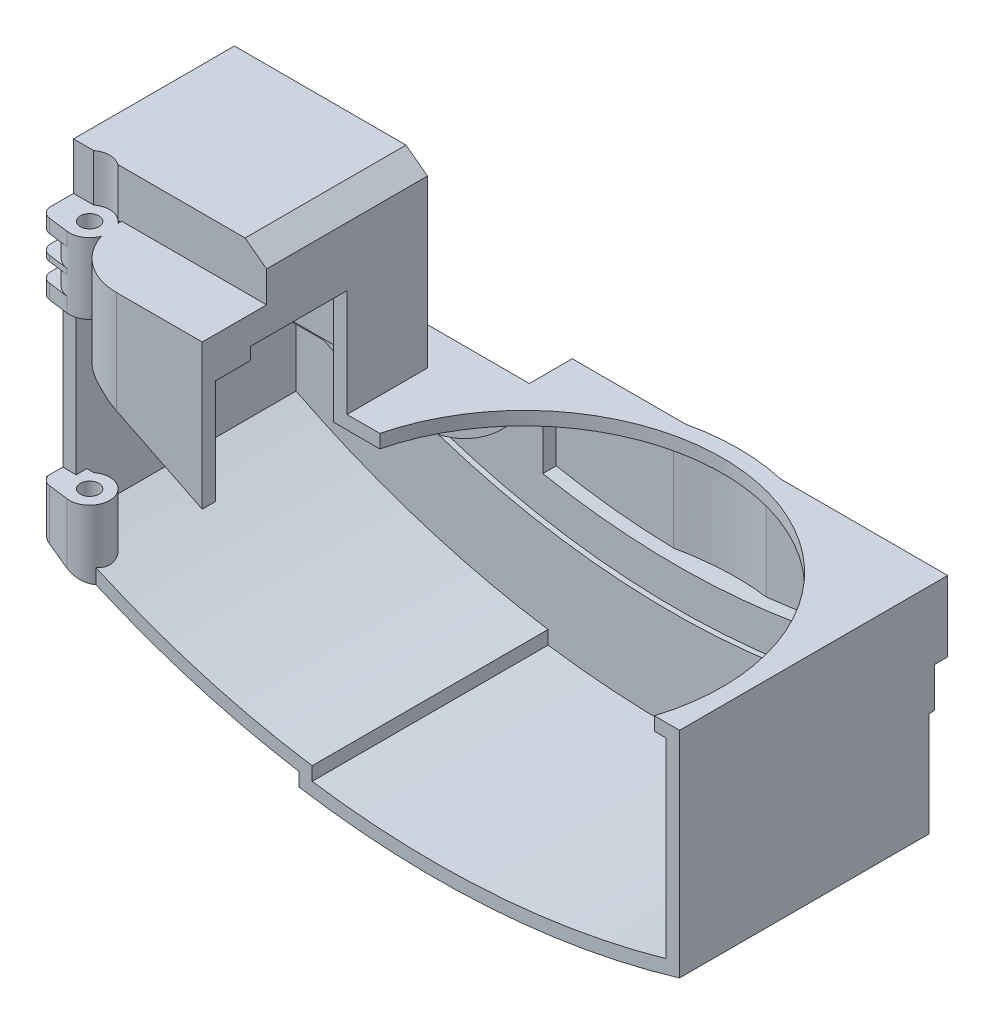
ISO-10303-21;
HEADER;
FILE_DESCRIPTION(('STEP AP214'),'2;1');
FILE_NAME('part.step','',(''),(''),'','','');
FILE_SCHEMA(('AUTOMOTIVE_DESIGN { 1 0 10303 214 1 1 1 1 }'));
ENDSEC;
DATA;
#1=APPLICATION_CONTEXT('core data for automotive mechanical design processes');
#2=APPLICATION_PROTOCOL_DEFINITION('international standard','automotive_design',2000,#1);
#3=PRODUCT_CONTEXT('',#1,'mechanical');
#4=PRODUCT('Part','Part','',(#3));
#5=PRODUCT_RELATED_PRODUCT_CATEGORY('part','',(#4));
#6=PRODUCT_DEFINITION_FORMATION('','',#4);
#7=PRODUCT_DEFINITION_CONTEXT('part definition',#1,'design');
#8=PRODUCT_DEFINITION('design','',#6,#7);
#9=PRODUCT_DEFINITION_SHAPE('','',#8);
#10=(LENGTH_UNIT() NAMED_UNIT(*) SI_UNIT(.MILLI.,.METRE.));
#11=(NAMED_UNIT(*) PLANE_ANGLE_UNIT() SI_UNIT($,.RADIAN.));
#12=(NAMED_UNIT(*) SI_UNIT($,.STERADIAN.) SOLID_ANGLE_UNIT());
#13=UNCERTAINTY_MEASURE_WITH_UNIT(LENGTH_MEASURE(1.E-05),#10,'distance_accuracy_value','');
#14=(GEOMETRIC_REPRESENTATION_CONTEXT(3) GLOBAL_UNCERTAINTY_ASSIGNED_CONTEXT((#13)) GLOBAL_UNIT_ASSIGNED_CONTEXT((#10,
#11,#12)) REPRESENTATION_CONTEXT('',''));
#15=CARTESIAN_POINT('',(0.,0.,0.));
#16=DIRECTION('',(0.,0.,1.));
#17=DIRECTION('',(1.,0.,0.));
#18=AXIS2_PLACEMENT_3D('',#15,#16,#17);
#19=CARTESIAN_POINT('',(20.,-11.3,-4.));
#20=DIRECTION('',(0.,-1.,0.));
#21=DIRECTION('',(0.,0.,1.));
#22=AXIS2_PLACEMENT_3D('',#19,#20,#21);
#23=PLANE('',#22);
#24=DIRECTION('',(0.,0.,1.));
#25=VECTOR('',#24,1.);
#26=CARTESIAN_POINT('',(33.5,-11.3,-4.));
#27=LINE('',#26,#25);
#28=CARTESIAN_POINT('',(33.5,-11.3,-5.));
#29=VERTEX_POINT('',#28);
#30=CARTESIAN_POINT('',(33.5,-11.3,4.5));
#31=VERTEX_POINT('',#30);
#32=EDGE_CURVE('E1046',#29,#31,#27,.T.);
#33=ORIENTED_EDGE('',*,*,#32,.T.);
#34=DIRECTION('',(1.,0.,0.));
#35=VECTOR('',#34,1.);
#36=CARTESIAN_POINT('',(20.,-11.3,4.5));
#37=LINE('',#36,#35);
#38=CARTESIAN_POINT('',(20.,-11.3,4.5));
#39=VERTEX_POINT('',#38);
#40=EDGE_CURVE('E1618',#39,#31,#37,.T.);
#41=ORIENTED_EDGE('',*,*,#40,.F.);
#42=CARTESIAN_POINT('',(20.,-11.3,-4.));
#43=DIRECTION('',(0.,1.,0.));
#44=DIRECTION('',(0.,0.,1.));
#45=AXIS2_PLACEMENT_3D('',#42,#43,#44);
#46=CIRCLE('',#45,8.5);
#47=CARTESIAN_POINT('',(12.6590909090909,-11.3,0.284980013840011));
#48=VERTEX_POINT('',#47);
#49=EDGE_CURVE('E1616',#48,#39,#46,.T.);
#50=ORIENTED_EDGE('',*,*,#49,.F.);
#51=DIRECTION('',(0.863636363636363,0.,-0.504115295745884));
#52=VECTOR('',#51,1.);
#53=CARTESIAN_POINT('',(20.,-11.3,-4.));
#54=LINE('',#53,#52);
#55=CARTESIAN_POINT('',(10.5,-11.3,1.54526825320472));
#56=VERTEX_POINT('',#55);
#57=EDGE_CURVE('E1613',#56,#48,#54,.T.);
#58=ORIENTED_EDGE('',*,*,#57,.F.);
#59=CARTESIAN_POINT('',(20.,-11.3,-4.));
#60=DIRECTION('',(0.,-1.,0.));
#61=DIRECTION('',(0.,0.,1.));
#62=AXIS2_PLACEMENT_3D('',#59,#60,#61);
#63=CIRCLE('',#62,11.);
#64=CARTESIAN_POINT('',(9.51161681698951,-11.3,-0.684307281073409));
#65=VERTEX_POINT('',#64);
#66=EDGE_CURVE('E1039',#56,#65,#63,.T.);
#67=ORIENTED_EDGE('',*,*,#66,.T.);
#68=CARTESIAN_POINT('',(6.,-11.3,-1.99999999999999));
#69=DIRECTION('',(0.,1.,0.));
#70=DIRECTION('',(0.,0.,1.));
#71=AXIS2_PLACEMENT_3D('',#68,#69,#70);
#72=CIRCLE('',#71,3.75);
#73=CARTESIAN_POINT('',(9.,-11.3,-4.25));
#74=VERTEX_POINT('',#73);
#75=EDGE_CURVE('E719',#65,#74,#72,.T.);
#76=ORIENTED_EDGE('',*,*,#75,.T.);
#77=DIRECTION('',(0.,0.,-1.));
#78=VECTOR('',#77,1.);
#79=CARTESIAN_POINT('',(9.,-11.3,-4.));
#80=LINE('',#79,#78);
#81=CARTESIAN_POINT('',(9.,-11.3,-5.));
#82=VERTEX_POINT('',#81);
#83=EDGE_CURVE('E1066',#74,#82,#80,.T.);
#84=ORIENTED_EDGE('',*,*,#83,.T.);
#85=DIRECTION('',(1.,0.,0.));
#86=VECTOR('',#85,1.);
#87=CARTESIAN_POINT('',(36.,-11.3,-5.));
#88=LINE('',#87,#86);
#89=EDGE_CURVE('E1062',#82,#29,#88,.T.);
#90=ORIENTED_EDGE('',*,*,#89,.T.);
#91=EDGE_LOOP('',(#33,#41,#50,#58,#67,#76,#84,#90));
#92=FACE_BOUND('',#91,.T.);
#93=ADVANCED_FACE('F30',(#92),#23,.T.);
#94=CARTESIAN_POINT('',(0.,0.,-50.));
#95=DIRECTION('',(-1.,0.,0.));
#96=DIRECTION('',(0.,0.,1.));
#97=AXIS2_PLACEMENT_3D('',#94,#95,#96);
#98=PLANE('',#97);
#99=DIRECTION('',(0.,1.,0.));
#100=VECTOR('',#99,1.);
#101=CARTESIAN_POINT('',(0.,-19.3,-5.));
#102=LINE('',#101,#100);
#103=CARTESIAN_POINT('',(0.,-19.3,-5.));
#104=VERTEX_POINT('',#103);
#105=CARTESIAN_POINT('',(0.,-15.8,-5.));
#106=VERTEX_POINT('',#105);
#107=EDGE_CURVE('E1098',#104,#106,#102,.T.);
#108=ORIENTED_EDGE('',*,*,#107,.T.);
#109=DIRECTION('',(0.,0.,-1.));
#110=VECTOR('',#109,1.);
#111=CARTESIAN_POINT('',(0.,-15.8,-0.756338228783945));
#112=LINE('',#111,#110);
#113=CARTESIAN_POINT('',(0.,-15.8,-0.756338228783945));
#114=VERTEX_POINT('',#113);
#115=EDGE_CURVE('E1074',#114,#106,#112,.T.);
#116=ORIENTED_EDGE('',*,*,#115,.F.);
#117=DIRECTION('',(0.,1.,0.));
#118=VECTOR('',#117,1.);
#119=CARTESIAN_POINT('',(0.,-34.3009146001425,-0.756338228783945));
#120=LINE('',#119,#118);
#121=CARTESIAN_POINT('',(0.,-14.8,-0.756338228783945));
#122=VERTEX_POINT('',#121);
#123=EDGE_CURVE('E1558',#114,#122,#120,.T.);
#124=ORIENTED_EDGE('',*,*,#123,.T.);
#125=DIRECTION('',(0.,0.,-1.));
#126=VECTOR('',#125,1.);
#127=CARTESIAN_POINT('',(0.,-14.8,-0.756338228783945));
#128=LINE('',#127,#126);
#129=CARTESIAN_POINT('',(0.,-14.8,-5.));
#130=VERTEX_POINT('',#129);
#131=EDGE_CURVE('E1120',#122,#130,#128,.T.);
#132=ORIENTED_EDGE('',*,*,#131,.T.);
#133=DIRECTION('',(0.,1.,0.));
#134=VECTOR('',#133,1.);
#135=CARTESIAN_POINT('',(0.,-14.8,-5.));
#136=LINE('',#135,#134);
#137=CARTESIAN_POINT('',(0.,-11.3,-5.));
#138=VERTEX_POINT('',#137);
#139=EDGE_CURVE('E1131',#130,#138,#136,.T.);
#140=ORIENTED_EDGE('',*,*,#139,.T.);
#141=DIRECTION('',(0.,0.,-1.));
#142=VECTOR('',#141,1.);
#143=CARTESIAN_POINT('',(0.,-11.3,-0.756338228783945));
#144=LINE('',#143,#142);
#145=CARTESIAN_POINT('',(0.,-11.3,-0.756338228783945));
#146=VERTEX_POINT('',#145);
#147=EDGE_CURVE('E1106',#146,#138,#144,.T.);
#148=ORIENTED_EDGE('',*,*,#147,.F.);
#149=CARTESIAN_POINT('',(0.,-8.8,-0.756338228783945));
#150=VERTEX_POINT('',#149);
#151=EDGE_CURVE('E1552',#146,#150,#120,.T.);
#152=ORIENTED_EDGE('',*,*,#151,.T.);
#153=DIRECTION('',(0.,0.,1.));
#154=VECTOR('',#153,1.);
#155=CARTESIAN_POINT('',(0.,-8.8,-5.));
#156=LINE('',#155,#154);
#157=CARTESIAN_POINT('',(0.,-8.8,-5.));
#158=VERTEX_POINT('',#157);
#159=EDGE_CURVE('E1507',#158,#150,#156,.T.);
#160=ORIENTED_EDGE('',*,*,#159,.F.);
#161=DIRECTION('',(0.,1.,0.));
#162=VECTOR('',#161,1.);
#163=CARTESIAN_POINT('',(0.,15.2068229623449,-5.));
#164=LINE('',#163,#162);
#165=CARTESIAN_POINT('',(0.,0.,-5.));
#166=VERTEX_POINT('',#165);
#167=EDGE_CURVE('E1225',#158,#166,#164,.T.);
#168=ORIENTED_EDGE('',*,*,#167,.T.);
#169=DIRECTION('',(0.,0.,1.));
#170=VECTOR('',#169,1.);
#171=CARTESIAN_POINT('',(0.,0.,-50.));
#172=LINE('',#171,#170);
#173=CARTESIAN_POINT('',(0.,0.,-35.));
#174=VERTEX_POINT('',#173);
#175=EDGE_CURVE('E1450',#174,#166,#172,.T.);
#176=ORIENTED_EDGE('',*,*,#175,.F.);
#177=DIRECTION('',(0.,-1.,0.));
#178=VECTOR('',#177,1.);
#179=CARTESIAN_POINT('',(0.,-34.,-35.));
#180=LINE('',#179,#178);
#181=CARTESIAN_POINT('',(0.,-34.,-35.));
#182=VERTEX_POINT('',#181);
#183=EDGE_CURVE('E949',#174,#182,#180,.T.);
#184=ORIENTED_EDGE('',*,*,#183,.T.);
#185=DIRECTION('',(0.,0.,-1.));
#186=VECTOR('',#185,1.);
#187=CARTESIAN_POINT('',(0.,-34.,-67.485294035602));
#188=LINE('',#187,#186);
#189=CARTESIAN_POINT('',(0.,-34.,-42.));
#190=VERTEX_POINT('',#189);
#191=EDGE_CURVE('E952',#182,#190,#188,.T.);
#192=ORIENTED_EDGE('',*,*,#191,.T.);
#193=DIRECTION('',(0.,-1.,0.));
#194=VECTOR('',#193,1.);
#195=CARTESIAN_POINT('',(0.,-34.,-42.));
#196=LINE('',#195,#194);
#197=CARTESIAN_POINT('',(0.,-41.1860122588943,-42.));
#198=VERTEX_POINT('',#197);
#199=EDGE_CURVE('E913',#190,#198,#196,.T.);
#200=ORIENTED_EDGE('',*,*,#199,.T.);
#201=DIRECTION('',(0.,0.,-1.));
#202=VECTOR('',#201,1.);
#203=CARTESIAN_POINT('',(0.,-41.1860122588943,-42.));
#204=LINE('',#203,#202);
#205=CARTESIAN_POINT('',(0.,-41.1860122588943,-47.5));
#206=VERTEX_POINT('',#205);
#207=EDGE_CURVE('E925',#198,#206,#204,.T.);
#208=ORIENTED_EDGE('',*,*,#207,.T.);
#209=DIRECTION('',(0.,-1.,0.));
#210=VECTOR('',#209,1.);
#211=CARTESIAN_POINT('',(0.,-83.3826321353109,-47.5));
#212=LINE('',#211,#210);
#213=CARTESIAN_POINT('',(0.,-42.1860122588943,-47.5));
#214=VERTEX_POINT('',#213);
#215=EDGE_CURVE('E1693',#206,#214,#212,.T.);
#216=ORIENTED_EDGE('',*,*,#215,.T.);
#217=DIRECTION('',(0.,0.,-1.));
#218=VECTOR('',#217,1.);
#219=CARTESIAN_POINT('',(0.,-42.1860122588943,-46.5));
#220=LINE('',#219,#218);
#221=CARTESIAN_POINT('',(0.,-42.1860122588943,-46.5));
#222=VERTEX_POINT('',#221);
#223=EDGE_CURVE('E1681',#222,#214,#220,.T.);
#224=ORIENTED_EDGE('',*,*,#223,.F.);
#225=DIRECTION('',(0.,-1.,0.));
#226=VECTOR('',#225,1.);
#227=CARTESIAN_POINT('',(0.,-86.0517588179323,-46.5));
#228=LINE('',#227,#226);
#229=CARTESIAN_POINT('',(0.,-60.5,-46.5));
#230=VERTEX_POINT('',#229);
#231=EDGE_CURVE('E1721',#222,#230,#228,.T.);
#232=ORIENTED_EDGE('',*,*,#231,.T.);
#233=DIRECTION('',(0.,0.,1.));
#234=VECTOR('',#233,1.);
#235=CARTESIAN_POINT('',(0.,-60.5,-50.));
#236=LINE('',#235,#234);
#237=CARTESIAN_POINT('',(0.,-60.5,0.));
#238=VERTEX_POINT('',#237);
#239=EDGE_CURVE('E1454',#230,#238,#236,.T.);
#240=ORIENTED_EDGE('',*,*,#239,.T.);
#241=DIRECTION('',(0.,1.,0.));
#242=VECTOR('',#241,1.);
#243=CARTESIAN_POINT('',(0.,0.,0.));
#244=LINE('',#243,#242);
#245=CARTESIAN_POINT('',(0.,-52.,0.));
#246=VERTEX_POINT('',#245);
#247=EDGE_CURVE('E1433',#238,#246,#244,.T.);
#248=ORIENTED_EDGE('',*,*,#247,.T.);
#249=DIRECTION('',(0.,0.,-1.));
#250=VECTOR('',#249,1.);
#251=CARTESIAN_POINT('',(0.,-52.,-3.));
#252=LINE('',#251,#250);
#253=CARTESIAN_POINT('',(0.,-52.,-3.));
#254=VERTEX_POINT('',#253);
#255=EDGE_CURVE('E1214',#246,#254,#252,.T.);
#256=ORIENTED_EDGE('',*,*,#255,.T.);
#257=DIRECTION('',(0.,1.,0.));
#258=VECTOR('',#257,1.);
#259=CARTESIAN_POINT('',(0.,-8.55808974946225,-3.));
#260=LINE('',#259,#258);
#261=CARTESIAN_POINT('',(0.,-22.,-3.));
#262=VERTEX_POINT('',#261);
#263=EDGE_CURVE('E1211',#254,#262,#260,.T.);
#264=ORIENTED_EDGE('',*,*,#263,.T.);
#265=DIRECTION('',(0.,0.,1.));
#266=VECTOR('',#265,1.);
#267=CARTESIAN_POINT('',(0.,-22.,-5.));
#268=LINE('',#267,#266);
#269=CARTESIAN_POINT('',(0.,-22.,-0.756338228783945));
#270=VERTEX_POINT('',#269);
#271=EDGE_CURVE('E1532',#262,#270,#268,.T.);
#272=ORIENTED_EDGE('',*,*,#271,.T.);
#273=CARTESIAN_POINT('',(0.,-19.3,-0.756338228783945));
#274=VERTEX_POINT('',#273);
#275=EDGE_CURVE('E1554',#270,#274,#120,.T.);
#276=ORIENTED_EDGE('',*,*,#275,.T.);
#277=DIRECTION('',(0.,0.,-1.));
#278=VECTOR('',#277,1.);
#279=CARTESIAN_POINT('',(0.,-19.3,-0.756338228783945));
#280=LINE('',#279,#278);
#281=EDGE_CURVE('E1087',#274,#104,#280,.T.);
#282=ORIENTED_EDGE('',*,*,#281,.T.);
#283=EDGE_LOOP('',(#108,#116,#124,#132,#140,#148,#152,#160,#168,#176,#184,#192,#200,#208,#216,
#224,#232,#240,#248,#256,#264,#272,#276,#282));
#284=FACE_BOUND('',#283,.T.);
#285=ADVANCED_FACE('F1000',(#284),#98,.T.);
#286=CARTESIAN_POINT('',(0.,-34.3009146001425,-5.));
#287=DIRECTION('',(0.,0.,1.));
#288=DIRECTION('',(1.,0.,0.));
#289=AXIS2_PLACEMENT_3D('',#286,#287,#288);
#290=PLANE('',#289);
#291=DIRECTION('',(1.,0.,0.));
#292=VECTOR('',#291,1.);
#293=CARTESIAN_POINT('',(0.,-19.3,-5.));
#294=LINE('',#293,#292);
#295=CARTESIAN_POINT('',(2.5,-19.3,-4.99999999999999));
#296=VERTEX_POINT('',#295);
#297=CARTESIAN_POINT('',(3.75,-19.3,-4.99999999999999));
#298=VERTEX_POINT('',#297);
#299=EDGE_CURVE('E1090',#296,#298,#294,.T.);
#300=ORIENTED_EDGE('',*,*,#299,.T.);
#301=DIRECTION('',(0.,1.,0.));
#302=VECTOR('',#301,1.);
#303=CARTESIAN_POINT('',(3.75,-34.3009146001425,-4.99999999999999));
#304=LINE('',#303,#302);
#305=CARTESIAN_POINT('',(3.75,-22.,-4.99999999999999));
#306=VERTEX_POINT('',#305);
#307=EDGE_CURVE('E1539',#306,#298,#304,.T.);
#308=ORIENTED_EDGE('',*,*,#307,.F.);
#309=DIRECTION('',(-1.,0.,0.));
#310=VECTOR('',#309,1.);
#311=CARTESIAN_POINT('',(0.,-22.,-5.));
#312=LINE('',#311,#310);
#313=CARTESIAN_POINT('',(2.5,-22.,-5.));
#314=VERTEX_POINT('',#313);
#315=EDGE_CURVE('E1535',#306,#314,#312,.T.);
#316=ORIENTED_EDGE('',*,*,#315,.T.);
#317=DIRECTION('',(0.,1.,0.));
#318=VECTOR('',#317,1.);
#319=CARTESIAN_POINT('',(2.5,0.,-5.));
#320=LINE('',#319,#318);
#321=EDGE_CURVE('E1231',#314,#296,#320,.T.);
#322=ORIENTED_EDGE('',*,*,#321,.T.);
#323=EDGE_LOOP('',(#300,#308,#316,#322));
#324=FACE_BOUND('',#323,.T.);
#325=ADVANCED_FACE('F784',(#324),#290,.F.);
#326=CARTESIAN_POINT('',(1.74161984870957,-34.3009146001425,1.22690146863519));
#327=DIRECTION('',(0.129190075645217,0.,-0.991619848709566));
#328=DIRECTION('',(-0.991619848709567,0.,-0.129190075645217));
#329=AXIS2_PLACEMENT_3D('',#326,#327,#328);
#330=PLANE('',#329);
#331=DIRECTION('',(-0.991619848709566,0.,-0.129190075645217));
#332=VECTOR('',#331,1.);
#333=CARTESIAN_POINT('',(5.51553721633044,-19.3,1.71857443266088));
#334=LINE('',#333,#332);
#335=CARTESIAN_POINT('',(5.51553721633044,-19.3,1.71857443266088));
#336=VERTEX_POINT('',#335);
#337=CARTESIAN_POINT('',(1.74161984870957,-19.3,1.22690146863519));
#338=VERTEX_POINT('',#337);
#339=EDGE_CURVE('E1095',#336,#338,#334,.T.);
#340=ORIENTED_EDGE('',*,*,#339,.T.);
#341=DIRECTION('',(0.,1.,0.));
#342=VECTOR('',#341,1.);
#343=CARTESIAN_POINT('',(1.74161984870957,-34.3009146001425,1.22690146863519));
#344=LINE('',#343,#342);
#345=CARTESIAN_POINT('',(1.74161984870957,-22.,1.22690146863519));
#346=VERTEX_POINT('',#345);
#347=EDGE_CURVE('E1549',#346,#338,#344,.T.);
#348=ORIENTED_EDGE('',*,*,#347,.F.);
#349=DIRECTION('',(0.991619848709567,0.,0.129190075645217));
#350=VECTOR('',#349,1.);
#351=CARTESIAN_POINT('',(1.74161984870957,-22.,1.22690146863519));
#352=LINE('',#351,#350);
#353=CARTESIAN_POINT('',(5.51553721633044,-22.,1.71857443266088));
#354=VERTEX_POINT('',#353);
#355=EDGE_CURVE('E1527',#346,#354,#352,.T.);
#356=ORIENTED_EDGE('',*,*,#355,.T.);
#357=DIRECTION('',(0.,1.,0.));
#358=VECTOR('',#357,1.);
#359=CARTESIAN_POINT('',(5.51553721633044,-34.3009146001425,1.71857443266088));
#360=LINE('',#359,#358);
#361=EDGE_CURVE('E1544',#354,#336,#360,.T.);
#362=ORIENTED_EDGE('',*,*,#361,.T.);
#363=EDGE_LOOP('',(#340,#348,#356,#362));
#364=FACE_BOUND('',#363,.T.);
#365=ADVANCED_FACE('F774',(#364),#330,.F.);
#366=CARTESIAN_POINT('',(2.,-34.3009146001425,-0.756338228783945));
#367=DIRECTION('',(0.,1.,0.));
#368=DIRECTION('',(0.,0.,-1.));
#369=AXIS2_PLACEMENT_3D('',#366,#367,#368);
#370=CYLINDRICAL_SURFACE('',#369,2.);
#371=CARTESIAN_POINT('',(2.,-19.3,-0.756338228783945));
#372=DIRECTION('',(0.,-1.,0.));
#373=DIRECTION('',(0.,0.,-1.));
#374=AXIS2_PLACEMENT_3D('',#371,#372,#373);
#375=CIRCLE('',#374,2.);
#376=EDGE_CURVE('E1085',#338,#274,#375,.T.);
#377=ORIENTED_EDGE('',*,*,#376,.T.);
#378=ORIENTED_EDGE('',*,*,#275,.F.);
#379=CARTESIAN_POINT('',(2.,-22.,-0.756338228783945));
#380=DIRECTION('',(0.,1.,0.));
#381=DIRECTION('',(0.,0.,1.));
#382=AXIS2_PLACEMENT_3D('',#379,#380,#381);
#383=CIRCLE('',#382,2.);
#384=EDGE_CURVE('E1530',#270,#346,#383,.T.);
#385=ORIENTED_EDGE('',*,*,#384,.T.);
#386=ORIENTED_EDGE('',*,*,#347,.T.);
#387=EDGE_LOOP('',(#377,#378,#385,#386));
#388=FACE_BOUND('',#387,.T.);
#389=ADVANCED_FACE('F779',(#388),#370,.T.);
#390=CARTESIAN_POINT('',(2.5,-15.8,-4.99999999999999));
#391=VERTEX_POINT('',#390);
#392=CARTESIAN_POINT('',(2.5,-14.8,-4.99999999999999));
#393=VERTEX_POINT('',#392);
#394=EDGE_CURVE('E1235',#391,#393,#320,.T.);
#395=ORIENTED_EDGE('',*,*,#394,.T.);
#396=DIRECTION('',(1.,0.,0.));
#397=VECTOR('',#396,1.);
#398=CARTESIAN_POINT('',(0.,-14.8,-5.));
#399=LINE('',#398,#397);
#400=CARTESIAN_POINT('',(3.75,-14.8,-4.99999999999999));
#401=VERTEX_POINT('',#400);
#402=EDGE_CURVE('E1123',#393,#401,#399,.T.);
#403=ORIENTED_EDGE('',*,*,#402,.T.);
#404=CARTESIAN_POINT('',(3.75,-15.8,-4.99999999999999));
#405=VERTEX_POINT('',#404);
#406=EDGE_CURVE('E1543',#405,#401,#304,.T.);
#407=ORIENTED_EDGE('',*,*,#406,.F.);
#408=DIRECTION('',(1.,0.,0.));
#409=VECTOR('',#408,1.);
#410=CARTESIAN_POINT('',(0.,-15.8,-5.));
#411=LINE('',#410,#409);
#412=EDGE_CURVE('E1077',#391,#405,#411,.T.);
#413=ORIENTED_EDGE('',*,*,#412,.F.);
#414=EDGE_LOOP('',(#395,#403,#407,#413));
#415=FACE_BOUND('',#414,.T.);
#416=ADVANCED_FACE('F785',(#415),#290,.F.);
#417=CARTESIAN_POINT('',(5.51553721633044,-15.8,1.71857443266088));
#418=VERTEX_POINT('',#417);
#419=CARTESIAN_POINT('',(5.51553721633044,-14.8,1.71857443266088));
#420=VERTEX_POINT('',#419);
#421=EDGE_CURVE('E1548',#418,#420,#360,.T.);
#422=ORIENTED_EDGE('',*,*,#421,.T.);
#423=DIRECTION('',(-0.991619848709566,0.,-0.129190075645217));
#424=VECTOR('',#423,1.);
#425=CARTESIAN_POINT('',(5.51553721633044,-14.8,1.71857443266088));
#426=LINE('',#425,#424);
#427=CARTESIAN_POINT('',(1.74161984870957,-14.8,1.22690146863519));
#428=VERTEX_POINT('',#427);
#429=EDGE_CURVE('E1128',#420,#428,#426,.T.);
#430=ORIENTED_EDGE('',*,*,#429,.T.);
#431=CARTESIAN_POINT('',(1.74161984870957,-15.8,1.22690146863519));
#432=VERTEX_POINT('',#431);
#433=EDGE_CURVE('E1553',#432,#428,#344,.T.);
#434=ORIENTED_EDGE('',*,*,#433,.F.);
#435=DIRECTION('',(-0.991619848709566,0.,-0.129190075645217));
#436=VECTOR('',#435,1.);
#437=CARTESIAN_POINT('',(5.51553721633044,-15.8,1.71857443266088));
#438=LINE('',#437,#436);
#439=EDGE_CURVE('E1082',#418,#432,#438,.T.);
#440=ORIENTED_EDGE('',*,*,#439,.F.);
#441=EDGE_LOOP('',(#422,#430,#434,#440));
#442=FACE_BOUND('',#441,.T.);
#443=ADVANCED_FACE('F775',(#442),#330,.F.);
#444=ORIENTED_EDGE('',*,*,#433,.T.);
#445=CARTESIAN_POINT('',(2.,-14.8,-0.756338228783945));
#446=DIRECTION('',(0.,-1.,0.));
#447=DIRECTION('',(0.,0.,-1.));
#448=AXIS2_PLACEMENT_3D('',#445,#446,#447);
#449=CIRCLE('',#448,2.);
#450=EDGE_CURVE('E1118',#428,#122,#449,.T.);
#451=ORIENTED_EDGE('',*,*,#450,.T.);
#452=ORIENTED_EDGE('',*,*,#123,.F.);
#453=CARTESIAN_POINT('',(2.,-15.8,-0.756338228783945));
#454=DIRECTION('',(0.,-1.,0.));
#455=DIRECTION('',(0.,0.,-1.));
#456=AXIS2_PLACEMENT_3D('',#453,#454,#455);
#457=CIRCLE('',#456,2.);
#458=EDGE_CURVE('E1070',#432,#114,#457,.T.);
#459=ORIENTED_EDGE('',*,*,#458,.F.);
#460=EDGE_LOOP('',(#444,#451,#452,#459));
#461=FACE_BOUND('',#460,.T.);
#462=ADVANCED_FACE('F780',(#461),#370,.T.);
#463=CARTESIAN_POINT('',(72.3598703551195,78.830718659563,0.));
#464=DIRECTION('',(0.,0.,-1.));
#465=DIRECTION('',(-1.,0.,0.));
#466=AXIS2_PLACEMENT_3D('',#463,#464,#465);
#467=PLANE('',#466);
#468=DIRECTION('',(1.,0.,0.));
#469=VECTOR('',#468,1.);
#470=CARTESIAN_POINT('',(72.3598703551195,-52.,0.));
#471=LINE('',#470,#469);
#472=CARTESIAN_POINT('',(0.148526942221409,-52.,0.));
#473=VERTEX_POINT('',#472);
#474=EDGE_CURVE('E1222',#246,#473,#471,.T.);
#475=ORIENTED_EDGE('',*,*,#474,.F.);
#476=ORIENTED_EDGE('',*,*,#247,.F.);
#477=CARTESIAN_POINT('',(72.3598703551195,78.830718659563,0.));
#478=DIRECTION('',(0.,0.,-1.));
#479=DIRECTION('',(1.,0.,0.));
#480=AXIS2_PLACEMENT_3D('',#477,#478,#479);
#481=CIRCLE('',#480,157.);
#482=CARTESIAN_POINT('',(0.148526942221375,-60.5770353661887,1.1102476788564E-13));
#483=VERTEX_POINT('',#482);
#484=EDGE_CURVE('E1434',#483,#238,#481,.T.);
#485=ORIENTED_EDGE('',*,*,#484,.F.);
#486=DIRECTION('',(0.,1.,0.));
#487=VECTOR('',#486,1.);
#488=CARTESIAN_POINT('',(0.1485269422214,-80.670281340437,0.));
#489=LINE('',#488,#487);
#490=EDGE_CURVE('E2054',#473,#483,#489,.F.);
#491=ORIENTED_EDGE('',*,*,#490,.F.);
#492=EDGE_LOOP('',(#475,#476,#485,#491));
#493=FACE_BOUND('',#492,.T.);
#494=ADVANCED_FACE('F815',(#493),#467,.F.);
#495=CARTESIAN_POINT('',(118.,15.2068229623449,-5.));
#496=DIRECTION('',(0.,0.,-1.));
#497=DIRECTION('',(-1.,0.,0.));
#498=AXIS2_PLACEMENT_3D('',#495,#496,#497);
#499=PLANE('',#498);
#500=DIRECTION('',(0.,-1.,0.));
#501=VECTOR('',#500,1.);
#502=CARTESIAN_POINT('',(3.75000000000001,10.6066017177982,-5.));
#503=LINE('',#502,#501);
#504=CARTESIAN_POINT('',(3.75000000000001,-8.8,-5.));
#505=VERTEX_POINT('',#504);
#506=CARTESIAN_POINT('',(3.75000000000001,0.,-5.));
#507=VERTEX_POINT('',#506);
#508=EDGE_CURVE('E1497',#505,#507,#503,.F.);
#509=ORIENTED_EDGE('',*,*,#508,.T.);
#510=DIRECTION('',(1.,0.,0.));
#511=VECTOR('',#510,1.);
#512=CARTESIAN_POINT('',(0.,0.,-5.));
#513=LINE('',#512,#511);
#514=EDGE_CURVE('E1243',#166,#507,#513,.T.);
#515=ORIENTED_EDGE('',*,*,#514,.F.);
#516=ORIENTED_EDGE('',*,*,#167,.F.);
#517=DIRECTION('',(1.,0.,0.));
#518=VECTOR('',#517,1.);
#519=CARTESIAN_POINT('',(118.,-8.8,-5.));
#520=LINE('',#519,#518);
#521=EDGE_CURVE('E740',#158,#505,#520,.T.);
#522=ORIENTED_EDGE('',*,*,#521,.T.);
#523=EDGE_LOOP('',(#509,#515,#516,#522));
#524=FACE_BOUND('',#523,.T.);
#525=ADVANCED_FACE('F811',(#524),#499,.F.);
#526=DIRECTION('',(1.,0.,0.));
#527=VECTOR('',#526,1.);
#528=CARTESIAN_POINT('',(36.,-8.8,-5.));
#529=LINE('',#528,#527);
#530=CARTESIAN_POINT('',(9.,-8.8,-5.));
#531=VERTEX_POINT('',#530);
#532=CARTESIAN_POINT('',(36.,-8.8,-5.));
#533=VERTEX_POINT('',#532);
#534=EDGE_CURVE('E1050',#531,#533,#529,.T.);
#535=ORIENTED_EDGE('',*,*,#534,.T.);
#536=DIRECTION('',(0.,-1.,0.));
#537=VECTOR('',#536,1.);
#538=CARTESIAN_POINT('',(36.,0.,-5.));
#539=LINE('',#538,#537);
#540=CARTESIAN_POINT('',(36.,-3.00000000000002,-5.));
#541=VERTEX_POINT('',#540);
#542=EDGE_CURVE('E1239',#541,#533,#539,.T.);
#543=ORIENTED_EDGE('',*,*,#542,.F.);
#544=DIRECTION('',(-0.800000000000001,0.599999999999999,0.));
#545=VECTOR('',#544,1.);
#546=CARTESIAN_POINT('',(32.,0.,-5.));
#547=LINE('',#546,#545);
#548=CARTESIAN_POINT('',(32.,0.,-5.));
#549=VERTEX_POINT('',#548);
#550=EDGE_CURVE('E1234',#549,#541,#547,.F.);
#551=ORIENTED_EDGE('',*,*,#550,.F.);
#552=CARTESIAN_POINT('',(8.24999999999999,0.,-5.));
#553=VERTEX_POINT('',#552);
#554=EDGE_CURVE('E1242',#553,#549,#513,.T.);
#555=ORIENTED_EDGE('',*,*,#554,.F.);
#556=DIRECTION('',(0.,-1.,0.));
#557=VECTOR('',#556,1.);
#558=CARTESIAN_POINT('',(8.24999999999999,10.6066017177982,-5.));
#559=LINE('',#558,#557);
#560=CARTESIAN_POINT('',(8.24999999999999,-8.8,-5.));
#561=VERTEX_POINT('',#560);
#562=EDGE_CURVE('E1504',#553,#561,#559,.T.);
#563=ORIENTED_EDGE('',*,*,#562,.T.);
#564=DIRECTION('',(0.,1.,0.));
#565=VECTOR('',#564,1.);
#566=CARTESIAN_POINT('',(8.24999999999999,-34.3009146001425,-5.));
#567=LINE('',#566,#565);
#568=CARTESIAN_POINT('',(8.24999999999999,-9.,-5.));
#569=VERTEX_POINT('',#568);
#570=EDGE_CURVE('E1557',#561,#569,#567,.F.);
#571=ORIENTED_EDGE('',*,*,#570,.T.);
#572=DIRECTION('',(-1.,0.,0.));
#573=VECTOR('',#572,1.);
#574=CARTESIAN_POINT('',(0.,-9.,-5.));
#575=LINE('',#574,#573);
#576=CARTESIAN_POINT('',(9.,-9.,-5.));
#577=VERTEX_POINT('',#576);
#578=EDGE_CURVE('E1568',#577,#569,#575,.T.);
#579=ORIENTED_EDGE('',*,*,#578,.F.);
#580=DIRECTION('',(0.,1.,0.));
#581=VECTOR('',#580,1.);
#582=CARTESIAN_POINT('',(9.,-11.3,-5.));
#583=LINE('',#582,#581);
#584=EDGE_CURVE('E622',#577,#531,#583,.T.);
#585=ORIENTED_EDGE('',*,*,#584,.T.);
#586=EDGE_LOOP('',(#535,#543,#551,#555,#563,#571,#579,#585));
#587=FACE_BOUND('',#586,.T.);
#588=ADVANCED_FACE('F814',(#587),#499,.F.);
#589=CARTESIAN_POINT('',(0.,0.,-50.));
#590=DIRECTION('',(0.,1.,0.));
#591=DIRECTION('',(0.,0.,-1.));
#592=AXIS2_PLACEMENT_3D('',#589,#590,#591);
#593=PLANE('',#592);
#594=ORIENTED_EDGE('',*,*,#554,.T.);
#595=DIRECTION('',(0.,0.,1.));
#596=VECTOR('',#595,1.);
#597=CARTESIAN_POINT('',(32.,0.,-50.));
#598=LINE('',#597,#596);
#599=CARTESIAN_POINT('',(32.,0.,-35.));
#600=VERTEX_POINT('',#599);
#601=EDGE_CURVE('E1453',#600,#549,#598,.T.);
#602=ORIENTED_EDGE('',*,*,#601,.F.);
#603=DIRECTION('',(-1.,0.,0.));
#604=VECTOR('',#603,1.);
#605=CARTESIAN_POINT('',(0.,0.,-35.));
#606=LINE('',#605,#604);
#607=EDGE_CURVE('E960',#600,#174,#606,.T.);
#608=ORIENTED_EDGE('',*,*,#607,.T.);
#609=ORIENTED_EDGE('',*,*,#175,.T.);
#610=ORIENTED_EDGE('',*,*,#514,.T.);
#611=CARTESIAN_POINT('',(6.,0.,-1.99999999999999));
#612=DIRECTION('',(0.,-1.,0.));
#613=DIRECTION('',(0.,0.,-1.));
#614=AXIS2_PLACEMENT_3D('',#611,#612,#613);
#615=CIRCLE('',#614,3.75);
#616=EDGE_CURVE('E1502',#507,#553,#615,.T.);
#617=ORIENTED_EDGE('',*,*,#616,.T.);
#618=EDGE_LOOP('',(#594,#602,#608,#609,#610,#617));
#619=FACE_BOUND('',#618,.T.);
#620=ADVANCED_FACE('F32',(#619),#593,.T.);
#621=CARTESIAN_POINT('',(0.,-9.,-7.5));
#622=DIRECTION('',(0.,-1.,0.));
#623=DIRECTION('',(0.,0.,1.));
#624=AXIS2_PLACEMENT_3D('',#621,#622,#623);
#625=PLANE('',#624);
#626=CARTESIAN_POINT('',(3.75,-9.,-5.));
#627=VERTEX_POINT('',#626);
#628=CARTESIAN_POINT('',(2.5,-9.,-5.));
#629=VERTEX_POINT('',#628);
#630=EDGE_CURVE('E1563',#627,#629,#575,.T.);
#631=ORIENTED_EDGE('',*,*,#630,.T.);
#632=DIRECTION('',(0.,0.,-1.));
#633=VECTOR('',#632,1.);
#634=CARTESIAN_POINT('',(2.5,-9.,-50.));
#635=LINE('',#634,#633);
#636=CARTESIAN_POINT('',(2.5,-9.,-7.5));
#637=VERTEX_POINT('',#636);
#638=EDGE_CURVE('E1574',#629,#637,#635,.T.);
#639=ORIENTED_EDGE('',*,*,#638,.T.);
#640=DIRECTION('',(-1.,0.,0.));
#641=VECTOR('',#640,1.);
#642=CARTESIAN_POINT('',(0.,-9.,-7.5));
#643=LINE('',#642,#641);
#644=CARTESIAN_POINT('',(33.5,-9.,-7.5));
#645=VERTEX_POINT('',#644);
#646=EDGE_CURVE('E1567',#645,#637,#643,.T.);
#647=ORIENTED_EDGE('',*,*,#646,.F.);
#648=DIRECTION('',(0.,0.,1.));
#649=VECTOR('',#648,1.);
#650=CARTESIAN_POINT('',(33.5,-9.,-50.));
#651=LINE('',#650,#649);
#652=CARTESIAN_POINT('',(33.5,-9.,-5.));
#653=VERTEX_POINT('',#652);
#654=EDGE_CURVE('E1571',#645,#653,#651,.T.);
#655=ORIENTED_EDGE('',*,*,#654,.T.);
#656=EDGE_CURVE('E1564',#653,#577,#575,.T.);
#657=ORIENTED_EDGE('',*,*,#656,.T.);
#658=ORIENTED_EDGE('',*,*,#578,.T.);
#659=CARTESIAN_POINT('',(6.,-9.,-1.99999999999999));
#660=DIRECTION('',(0.,1.,0.));
#661=DIRECTION('',(0.,0.,1.));
#662=AXIS2_PLACEMENT_3D('',#659,#660,#661);
#663=CIRCLE('',#662,3.75);
#664=EDGE_CURVE('E1488',#627,#569,#663,.F.);
#665=ORIENTED_EDGE('',*,*,#664,.F.);
#666=EDGE_LOOP('',(#631,#639,#647,#655,#657,#658,#665));
#667=FACE_BOUND('',#666,.T.);
#668=ADVANCED_FACE('F790',(#667),#625,.T.);
#669=CARTESIAN_POINT('',(47.,-76.1075818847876,0.));
#670=VERTEX_POINT('',#669);
#671=CARTESIAN_POINT('',(9.17214438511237,-64.8923180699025,0.));
#672=VERTEX_POINT('',#671);
#673=EDGE_CURVE('E1424',#670,#672,#481,.T.);
#674=ORIENTED_EDGE('',*,*,#673,.F.);
#675=DIRECTION('',(0.,1.,0.));
#676=VECTOR('',#675,1.);
#677=CARTESIAN_POINT('',(47.,-78.6403166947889,0.));
#678=LINE('',#677,#676);
#679=CARTESIAN_POINT('',(47.,-78.6403166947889,0.));
#680=VERTEX_POINT('',#679);
#681=EDGE_CURVE('E1439',#680,#670,#678,.T.);
#682=ORIENTED_EDGE('',*,*,#681,.F.);
#683=CARTESIAN_POINT('',(72.3598703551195,78.830718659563,0.));
#684=DIRECTION('',(0.,0.,-1.));
#685=DIRECTION('',(-1.,0.,0.));
#686=AXIS2_PLACEMENT_3D('',#683,#684,#685);
#687=CIRCLE('',#686,159.5);
#688=CARTESIAN_POINT('',(118.,-74.,0.));
#689=VERTEX_POINT('',#688);
#690=EDGE_CURVE('E1664',#689,#680,#687,.T.);
#691=ORIENTED_EDGE('',*,*,#690,.F.);
#692=DIRECTION('',(0.,-1.,0.));
#693=VECTOR('',#692,1.);
#694=CARTESIAN_POINT('',(118.,-34.,0.));
#695=LINE('',#694,#693);
#696=CARTESIAN_POINT('',(118.,-34.,0.));
#697=VERTEX_POINT('',#696);
#698=EDGE_CURVE('E1661',#697,#689,#695,.T.);
#699=ORIENTED_EDGE('',*,*,#698,.F.);
#700=DIRECTION('',(1.,0.,0.));
#701=VECTOR('',#700,1.);
#702=CARTESIAN_POINT('',(36.,-34.,0.));
#703=LINE('',#702,#701);
#704=CARTESIAN_POINT('',(113.327043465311,-34.,0.));
#705=VERTEX_POINT('',#704);
#706=EDGE_CURVE('E1658',#705,#697,#703,.T.);
#707=ORIENTED_EDGE('',*,*,#706,.F.);
#708=DIRECTION('',(0.,1.,0.));
#709=VECTOR('',#708,1.);
#710=CARTESIAN_POINT('',(113.327043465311,-39.,0.));
#711=LINE('',#710,#709);
#712=CARTESIAN_POINT('',(113.327043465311,-36.5,0.));
#713=VERTEX_POINT('',#712);
#714=EDGE_CURVE('E1250',#713,#705,#711,.T.);
#715=ORIENTED_EDGE('',*,*,#714,.F.);
#716=DIRECTION('',(1.,0.,0.));
#717=VECTOR('',#716,1.);
#718=CARTESIAN_POINT('',(36.,-36.5,0.));
#719=LINE('',#718,#717);
#720=CARTESIAN_POINT('',(115.5,-36.5,0.));
#721=VERTEX_POINT('',#720);
#722=EDGE_CURVE('E892',#713,#721,#719,.T.);
#723=ORIENTED_EDGE('',*,*,#722,.T.);
#724=DIRECTION('',(0.,-1.,0.));
#725=VECTOR('',#724,1.);
#726=CARTESIAN_POINT('',(115.5,-34.,0.));
#727=LINE('',#726,#725);
#728=CARTESIAN_POINT('',(115.5,-72.1259943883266,0.));
#729=VERTEX_POINT('',#728);
#730=EDGE_CURVE('E888',#721,#729,#727,.T.);
#731=ORIENTED_EDGE('',*,*,#730,.T.);
#732=CARTESIAN_POINT('',(72.3598703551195,78.830718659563,0.));
#733=DIRECTION('',(0.,0.,1.));
#734=DIRECTION('',(-1.,0.,0.));
#735=AXIS2_PLACEMENT_3D('',#732,#733,#734);
#736=CIRCLE('',#735,157.);
#737=CARTESIAN_POINT('',(49.5,-76.4961184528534,0.));
#738=VERTEX_POINT('',#737);
#739=EDGE_CURVE('E891',#729,#738,#736,.F.);
#740=ORIENTED_EDGE('',*,*,#739,.T.);
#741=DIRECTION('',(0.,1.,0.));
#742=VECTOR('',#741,1.);
#743=CARTESIAN_POINT('',(49.5,-78.6403166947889,0.));
#744=LINE('',#743,#742);
#745=CARTESIAN_POINT('',(49.5,-73.9687457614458,0.));
#746=VERTEX_POINT('',#745);
#747=EDGE_CURVE('E895',#738,#746,#744,.T.);
#748=ORIENTED_EDGE('',*,*,#747,.T.);
#749=CARTESIAN_POINT('',(72.3598703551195,78.830718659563,0.));
#750=DIRECTION('',(0.,0.,1.));
#751=DIRECTION('',(-1.,0.,0.));
#752=AXIS2_PLACEMENT_3D('',#749,#750,#751);
#753=CIRCLE('',#752,154.5);
#754=CARTESIAN_POINT('',(9.17214438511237,-62.1570867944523,0.));
#755=VERTEX_POINT('',#754);
#756=EDGE_CURVE('E898',#746,#755,#753,.F.);
#757=ORIENTED_EDGE('',*,*,#756,.T.);
#758=DIRECTION('',(0.,1.,0.));
#759=VECTOR('',#758,1.);
#760=CARTESIAN_POINT('',(9.17214438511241,-80.670281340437,0.));
#761=LINE('',#760,#759);
#762=EDGE_CURVE('E1421',#672,#755,#761,.T.);
#763=ORIENTED_EDGE('',*,*,#762,.F.);
#764=EDGE_LOOP('',(#674,#682,#691,#699,#707,#715,#723,#731,#740,#748,#757,#763));
#765=FACE_BOUND('',#764,.T.);
#766=ADVANCED_FACE('F793',(#765),#467,.F.);
#767=CARTESIAN_POINT('',(72.3598703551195,78.830718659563,-50.));
#768=DIRECTION('',(0.,0.,-1.));
#769=DIRECTION('',(-1.,0.,0.));
#770=AXIS2_PLACEMENT_3D('',#767,#768,#769);
#771=PLANE('',#770);
#772=DIRECTION('',(0.,1.,0.));
#773=VECTOR('',#772,1.);
#774=CARTESIAN_POINT('',(86.8881944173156,-80.670281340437,-50.));
#775=LINE('',#774,#773);
#776=CARTESIAN_POINT('',(86.8881944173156,-54.3793702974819,-50.));
#777=VERTEX_POINT('',#776);
#778=CARTESIAN_POINT('',(86.8881944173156,-34.,-50.));
#779=VERTEX_POINT('',#778);
#780=EDGE_CURVE('E1714',#777,#779,#775,.T.);
#781=ORIENTED_EDGE('',*,*,#780,.T.);
#782=DIRECTION('',(1.,0.,0.));
#783=VECTOR('',#782,1.);
#784=CARTESIAN_POINT('',(36.,-34.,-50.));
#785=LINE('',#784,#783);
#786=CARTESIAN_POINT('',(118.,-34.,-50.));
#787=VERTEX_POINT('',#786);
#788=EDGE_CURVE('E1437',#779,#787,#785,.T.);
#789=ORIENTED_EDGE('',*,*,#788,.T.);
#790=DIRECTION('',(0.,-1.,0.));
#791=VECTOR('',#790,1.);
#792=CARTESIAN_POINT('',(118.,-34.,-50.));
#793=LINE('',#792,#791);
#794=CARTESIAN_POINT('',(118.,-47.1572909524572,-50.));
#795=VERTEX_POINT('',#794);
#796=EDGE_CURVE('E1446',#787,#795,#793,.T.);
#797=ORIENTED_EDGE('',*,*,#796,.T.);
#798=CARTESIAN_POINT('',(72.3598703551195,78.830718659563,-50.));
#799=DIRECTION('',(0.,0.,-1.));
#800=DIRECTION('',(1.,0.,0.));
#801=AXIS2_PLACEMENT_3D('',#798,#799,#800);
#802=CIRCLE('',#801,134.);
#803=EDGE_CURVE('E1687',#795,#777,#802,.T.);
#804=ORIENTED_EDGE('',*,*,#803,.T.);
#805=EDGE_LOOP('',(#781,#789,#797,#804));
#806=FACE_BOUND('',#805,.T.);
#807=ADVANCED_FACE('F1159',(#806),#771,.T.);
#808=CARTESIAN_POINT('',(72.3598703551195,78.830718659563,-50.));
#809=DIRECTION('',(0.,0.,1.));
#810=DIRECTION('',(1.,0.,0.));
#811=AXIS2_PLACEMENT_3D('',#808,#809,#810);
#812=CYLINDRICAL_SURFACE('',#811,157.);
#813=ORIENTED_EDGE('',*,*,#484,.T.);
#814=ORIENTED_EDGE('',*,*,#239,.F.);
#815=CARTESIAN_POINT('',(72.3598703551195,78.830718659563,-46.5));
#816=DIRECTION('',(0.,0.,-1.));
#817=DIRECTION('',(1.,0.,0.));
#818=AXIS2_PLACEMENT_3D('',#815,#816,#817);
#819=CIRCLE('',#818,157.);
#820=CARTESIAN_POINT('',(47.,-76.1075818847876,-46.5));
#821=VERTEX_POINT('',#820);
#822=EDGE_CURVE('E1678',#230,#821,#819,.F.);
#823=ORIENTED_EDGE('',*,*,#822,.T.);
#824=DIRECTION('',(0.,0.,1.));
#825=VECTOR('',#824,1.);
#826=CARTESIAN_POINT('',(47.,-76.1075818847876,-50.));
#827=LINE('',#826,#825);
#828=EDGE_CURVE('E1431',#821,#670,#827,.T.);
#829=ORIENTED_EDGE('',*,*,#828,.T.);
#830=ORIENTED_EDGE('',*,*,#673,.T.);
#831=CARTESIAN_POINT('',(6.,-63.4554985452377,-5.74999999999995));
#832=CARTESIAN_POINT('',(6.22620586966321,-63.5609963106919,-5.74999622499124));
#833=CARTESIAN_POINT('',(6.45282002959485,-63.6660232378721,-5.72951258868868));
#834=CARTESIAN_POINT('',(6.9007012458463,-63.8723227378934,-5.64734176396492));
#835=CARTESIAN_POINT('',(7.12196087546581,-63.9735901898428,-5.58560040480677));
#836=CARTESIAN_POINT('',(7.44463240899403,-64.1204130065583,-5.46249640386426));
#837=CARTESIAN_POINT('',(7.55082183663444,-64.1685832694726,-5.41627754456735));
#838=CARTESIAN_POINT('',(7.75918515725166,-64.2628329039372,-5.3137933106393));
#839=CARTESIAN_POINT('',(7.86136076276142,-64.3089131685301,-5.2575322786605));
#840=CARTESIAN_POINT('',(8.06079009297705,-64.3986088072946,-5.13517705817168));
#841=CARTESIAN_POINT('',(8.15804371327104,-64.4422241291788,-5.06908266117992));
#842=CARTESIAN_POINT('',(8.34663623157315,-64.5265850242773,-4.92740452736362));
#843=CARTESIAN_POINT('',(8.4379782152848,-64.5673320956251,-4.85182580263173));
#844=CARTESIAN_POINT('',(8.60869524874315,-64.6433064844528,-4.696249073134));
#845=CARTESIAN_POINT('',(8.6884574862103,-64.6787170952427,-4.61676536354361));
#846=CARTESIAN_POINT('',(8.84106421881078,-64.7463276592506,-4.45022483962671));
#847=CARTESIAN_POINT('',(8.91391217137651,-64.7785292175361,-4.36317185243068));
#848=CARTESIAN_POINT('',(9.05190935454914,-64.8394165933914,-4.18204250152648));
#849=CARTESIAN_POINT('',(9.11706019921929,-64.8681031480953,-4.0879676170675));
#850=CARTESIAN_POINT('',(9.23889750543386,-64.9216629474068,-3.89346449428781));
#851=CARTESIAN_POINT('',(9.29558476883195,-64.9465365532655,-3.7930368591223));
#852=CARTESIAN_POINT('',(9.39499577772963,-64.9900977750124,-3.59609925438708));
#853=CARTESIAN_POINT('',(9.43852298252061,-65.0091433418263,-3.50007322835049));
#854=CARTESIAN_POINT('',(9.51752562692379,-65.0436764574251,-3.30410004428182));
#855=CARTESIAN_POINT('',(9.55299833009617,-65.0591627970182,-3.20415156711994));
#856=CARTESIAN_POINT('',(9.6154271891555,-65.0863964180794,-3.00122268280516));
#857=CARTESIAN_POINT('',(9.64239027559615,-65.0981467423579,-2.89824481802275));
#858=CARTESIAN_POINT('',(9.68751794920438,-65.1178028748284,-2.68997601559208));
#859=CARTESIAN_POINT('',(9.70567949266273,-65.1257073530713,-2.58468429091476));
#860=CARTESIAN_POINT('',(9.73197014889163,-65.1371468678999,-2.38042077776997));
#861=CARTESIAN_POINT('',(9.74073206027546,-65.1409575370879,-2.28154533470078));
#862=CARTESIAN_POINT('',(9.75038839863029,-65.1451570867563,-2.08330295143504));
#863=CARTESIAN_POINT('',(9.75128007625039,-65.1455447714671,-1.98393585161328));
#864=CARTESIAN_POINT('',(9.7451763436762,-65.142890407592,-1.78554049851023));
#865=CARTESIAN_POINT('',(9.73818537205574,-65.1398502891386,-1.68651208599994));
#866=CARTESIAN_POINT('',(9.71641006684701,-65.1303768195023,-1.48946919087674));
#867=CARTESIAN_POINT('',(9.70162285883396,-65.1239422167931,-1.39145509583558));
#868=CARTESIAN_POINT('',(9.64667766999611,-65.1000185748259,-1.10481018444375));
#869=CARTESIAN_POINT('',(9.59576140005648,-65.0778344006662,-0.918498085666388));
#870=CARTESIAN_POINT('',(9.46680226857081,-65.0215210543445,-0.557577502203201));
#871=CARTESIAN_POINT('',(9.38875737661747,-64.987390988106,-0.382969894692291));
#872=CARTESIAN_POINT('',(9.20587307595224,-64.9071776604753,-0.0447932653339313));
#873=CARTESIAN_POINT('',(9.1003444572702,-64.860786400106,0.118329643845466));
#874=CARTESIAN_POINT('',(8.86733353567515,-64.7579785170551,0.424446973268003));
#875=CARTESIAN_POINT('',(8.73984564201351,-64.7015593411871,0.567436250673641));
#876=CARTESIAN_POINT('',(8.45758576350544,-64.5761270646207,0.839676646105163));
#877=CARTESIAN_POINT('',(8.30155129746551,-64.5065201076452,0.967343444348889));
#878=CARTESIAN_POINT('',(7.97367758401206,-64.3595410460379,1.19483296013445));
#879=CARTESIAN_POINT('',(7.80183276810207,-64.2821662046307,1.29464581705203));
#880=CARTESIAN_POINT('',(7.43167598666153,-64.1146352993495,1.47253248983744));
#881=CARTESIAN_POINT('',(7.23235744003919,-64.0239520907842,1.54801621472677));
#882=CARTESIAN_POINT('',(6.82587529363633,-63.8379377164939,1.66403467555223));
#883=CARTESIAN_POINT('',(6.61870878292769,-63.7426048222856,1.70455630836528));
#884=CARTESIAN_POINT('',(6.18595203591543,-63.5422896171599,1.75216993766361));
#885=CARTESIAN_POINT('',(5.96014495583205,-63.4371197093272,1.75652795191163));
#886=CARTESIAN_POINT('',(5.51132298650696,-63.2267809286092,1.72482579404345));
#887=CARTESIAN_POINT('',(5.28830894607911,-63.1216120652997,1.68875362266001));
#888=CARTESIAN_POINT('',(4.84395438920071,-62.9108190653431,1.57496547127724));
#889=CARTESIAN_POINT('',(4.62290354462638,-62.8052911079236,1.49593484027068));
#890=CARTESIAN_POINT('',(4.19679659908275,-62.6007175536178,1.29639118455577));
#891=CARTESIAN_POINT('',(3.99174025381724,-62.5016718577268,1.17587879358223));
#892=CARTESIAN_POINT('',(3.70520696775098,-62.362581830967,0.968127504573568));
#893=CARTESIAN_POINT('',(3.61459153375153,-62.3184795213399,0.89583869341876));
#894=CARTESIAN_POINT('',(3.43971644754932,-62.2331739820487,0.742435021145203));
#895=CARTESIAN_POINT('',(3.35545352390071,-62.1919692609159,0.661324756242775));
#896=CARTESIAN_POINT('',(3.19416377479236,-62.1129336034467,0.490697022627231));
#897=CARTESIAN_POINT('',(3.11713708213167,-62.0751027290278,0.40117939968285));
#898=CARTESIAN_POINT('',(2.97126435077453,-62.0033253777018,0.214338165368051));
#899=CARTESIAN_POINT('',(2.90241344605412,-61.9693765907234,0.117019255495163));
#900=CARTESIAN_POINT('',(2.77978945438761,-61.9088158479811,-0.0752912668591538));
#901=CARTESIAN_POINT('',(2.72520790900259,-61.8818144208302,-0.169645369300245));
#902=CARTESIAN_POINT('',(2.62414115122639,-61.8317541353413,-0.363534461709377));
#903=CARTESIAN_POINT('',(2.57765150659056,-61.8086931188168,-0.463066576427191));
#904=CARTESIAN_POINT('',(2.49335558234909,-61.7668358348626,-0.666557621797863));
#905=CARTESIAN_POINT('',(2.4555455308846,-61.7480377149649,-0.770514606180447));
#906=CARTESIAN_POINT('',(2.38911254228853,-61.7149836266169,-0.982024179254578));
#907=CARTESIAN_POINT('',(2.36048867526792,-61.7007271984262,-1.08957640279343));
#908=CARTESIAN_POINT('',(2.31536419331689,-61.6782409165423,-1.2958009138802));
#909=CARTESIAN_POINT('',(2.29790281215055,-61.6695337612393,-1.39421214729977));
#910=CARTESIAN_POINT('',(2.27087383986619,-61.6560522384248,-1.59241746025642));
#911=CARTESIAN_POINT('',(2.26130883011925,-61.6512791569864,-1.69221198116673));
#912=CARTESIAN_POINT('',(2.25020948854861,-61.64574019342,-1.89228577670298));
#913=CARTESIAN_POINT('',(2.24866943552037,-61.6449714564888,-1.99256465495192));
#914=CARTESIAN_POINT('',(2.2536243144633,-61.6474443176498,-2.19291038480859));
#915=CARTESIAN_POINT('',(2.26012215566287,-61.6506873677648,-2.29297714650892));
#916=CARTESIAN_POINT('',(2.28049833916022,-61.6608531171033,-2.48656650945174));
#917=CARTESIAN_POINT('',(2.29394935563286,-61.6675627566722,-2.58014537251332));
#918=CARTESIAN_POINT('',(2.32779785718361,-61.6844377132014,-2.76573196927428));
#919=CARTESIAN_POINT('',(2.34819774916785,-61.6946042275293,-2.85773914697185));
#920=CARTESIAN_POINT('',(2.41950937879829,-61.7301179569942,-3.13039127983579));
#921=CARTESIAN_POINT('',(2.48055374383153,-61.7604897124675,-3.30785889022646));
#922=CARTESIAN_POINT('',(2.62866342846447,-61.8340092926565,-3.65307497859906));
#923=CARTESIAN_POINT('',(2.71623919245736,-61.8774075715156,-3.82054770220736));
#924=CARTESIAN_POINT('',(2.91370793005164,-61.9749723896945,-4.13829383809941));
#925=CARTESIAN_POINT('',(3.02360620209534,-62.0291414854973,-4.28856315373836));
#926=CARTESIAN_POINT('',(3.27166994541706,-62.1509861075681,-4.5803521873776));
#927=CARTESIAN_POINT('',(3.41137952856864,-62.2193891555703,-4.72025212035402));
#928=CARTESIAN_POINT('',(3.70850121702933,-62.3642417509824,-4.97487176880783));
#929=CARTESIAN_POINT('',(3.865924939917,-62.4406965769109,-5.08957481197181));
#930=CARTESIAN_POINT('',(4.21109168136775,-62.6075516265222,-5.30265383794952));
#931=CARTESIAN_POINT('',(4.40028980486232,-62.6985791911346,-5.39817949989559));
#932=CARTESIAN_POINT('',(4.78994758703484,-62.885025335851,-5.5556132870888));
#933=CARTESIAN_POINT('',(4.99039865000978,-62.9804405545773,-5.61754669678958));
#934=CARTESIAN_POINT('',(5.32646489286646,-63.1395040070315,-5.69151216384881));
#935=CARTESIAN_POINT('',(5.46025422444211,-63.2025994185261,-5.71341963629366));
#936=CARTESIAN_POINT('',(5.72931354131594,-63.3290189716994,-5.7426650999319));
#937=CARTESIAN_POINT('',(5.86458361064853,-63.3923431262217,-5.75000225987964));
#938=CARTESIAN_POINT('',(6.,-63.4554985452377,-5.74999999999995));
#939=B_SPLINE_CURVE_WITH_KNOTS('',3,(#831,#832,#833,#834,#835,#836,#837,#838,#839,#840,#841,
#842,#843,#844,#845,#846,#847,#848,#849,#850,#851,#852,#853,#854,#855,#856,#857,#858,#859,#860,
#861,#862,#863,#864,#865,#866,#867,#868,#869,#870,#871,#872,#873,#874,#875,#876,#877,#878,#879,
#880,#881,#882,#883,#884,#885,#886,#887,#888,#889,#890,#891,#892,#893,#894,#895,#896,#897,#898,
#899,#900,#901,#902,#903,#904,#905,#906,#907,#908,#909,#910,#911,#912,#913,#914,#915,#916,#917,
#918,#919,#920,#921,#922,#923,#924,#925,#926,#927,#928,#929,#930,#931,#932,#933,#934,#935,#936,
#937,#938),.UNSPECIFIED.,.T.,.F.,(4,2,2,2,2,2,2,2,2,2,2,2,2,2,2,2,2,2,2,2,2,2,2,2,2,2,2,2,2,2,2,
2,2,2,2,2,2,2,2,2,2,2,2,2,2,2,2,2,2,2,2,2,2,4),(0.,0.748293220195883,1.49757087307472,
1.87345970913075,2.249186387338,2.62492103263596,3.00045794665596,3.3541076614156,
3.70757959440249,4.06097727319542,4.41434144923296,4.73533362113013,5.05643468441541,
5.37727355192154,5.6982232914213,5.99586473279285,6.29361014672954,6.59118798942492,
6.88887562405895,7.46920103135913,8.04956988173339,8.64619296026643,9.24296816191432,
9.88012493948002,10.5175069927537,11.2094138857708,11.9015799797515,12.6456379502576,
13.3899168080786,14.1583720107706,14.9268154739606,15.2984717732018,15.6699353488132,
16.0414057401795,16.4126539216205,16.7490893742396,17.085339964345,17.4214441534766,
17.7575143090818,18.0581095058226,18.3588029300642,18.6592819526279,18.9598697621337,
19.2438605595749,19.5279498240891,20.095555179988,20.6748608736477,21.2543042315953,
21.8793581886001,22.5048244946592,23.1939558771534,23.8825678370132,24.3305022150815,
24.778462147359),.UNSPECIFIED.);
#940=CARTESIAN_POINT('',(5.51553721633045,-63.2285475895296,1.71857443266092));
#941=VERTEX_POINT('',#940);
#942=EDGE_CURVE('E705',#672,#941,#939,.T.);
#943=ORIENTED_EDGE('',*,*,#942,.T.);
#944=CARTESIAN_POINT('',(72.3598703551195,78.830718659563,10.4271783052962));
#945=DIRECTION('',(0.129190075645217,0.,-0.991619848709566));
#946=DIRECTION('',(0.991619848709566,0.,0.129190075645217));
#947=AXIS2_PLACEMENT_3D('',#944,#945,#946);
#948=ELLIPSE('',#947,158.326802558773,157.);
#949=CARTESIAN_POINT('',(1.74161984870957,-61.3907586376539,1.22690146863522));
#950=VERTEX_POINT('',#949);
#951=EDGE_CURVE('E1153',#941,#950,#948,.T.);
#952=ORIENTED_EDGE('',*,*,#951,.T.);
#953=CARTESIAN_POINT('',(2.,-61.5205857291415,-2.75633822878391));
#954=CARTESIAN_POINT('',(2.12248826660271,-61.581990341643,-2.75633456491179));
#955=CARTESIAN_POINT('',(2.24515870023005,-61.6432841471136,-2.7450684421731));
#956=CARTESIAN_POINT('',(2.48744287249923,-61.7639549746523,-2.69994764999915));
#957=CARTESIAN_POINT('',(2.60705190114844,-61.8233290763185,-2.66606011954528));
#958=CARTESIAN_POINT('',(2.83977811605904,-61.9385026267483,-2.57578285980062));
#959=CARTESIAN_POINT('',(2.95287915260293,-61.9942932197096,-2.51933969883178));
#960=CARTESIAN_POINT('',(3.16822708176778,-62.1002250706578,-2.38463567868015));
#961=CARTESIAN_POINT('',(3.27048054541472,-62.150369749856,-2.30638813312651));
#962=CARTESIAN_POINT('',(3.45350672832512,-62.2399117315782,-2.13544644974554));
#963=CARTESIAN_POINT('',(3.53525648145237,-62.279802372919,-2.04406142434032));
#964=CARTESIAN_POINT('',(3.68179553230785,-62.3511806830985,-1.84570914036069));
#965=CARTESIAN_POINT('',(3.74659820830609,-62.3826749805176,-1.73875427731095));
#966=CARTESIAN_POINT('',(3.84982968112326,-62.4327843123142,-1.52489006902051));
#967=CARTESIAN_POINT('',(3.89035593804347,-62.4524253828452,-1.41923256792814));
#968=CARTESIAN_POINT('',(3.95313134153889,-62.4828309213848,-1.20141751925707));
#969=CARTESIAN_POINT('',(3.97539253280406,-62.4936012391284,-1.0892643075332));
#970=CARTESIAN_POINT('',(3.99935776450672,-62.5051949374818,-0.872251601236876));
#971=CARTESIAN_POINT('',(4.00268704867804,-62.5068047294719,-0.767610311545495));
#972=CARTESIAN_POINT('',(3.992996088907,-62.5021173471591,-0.559280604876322));
#973=CARTESIAN_POINT('',(3.97997941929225,-62.4958219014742,-0.455591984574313));
#974=CARTESIAN_POINT('',(3.93877726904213,-62.47587891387,-0.25499126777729));
#975=CARTESIAN_POINT('',(3.91101173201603,-62.4624349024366,-0.157971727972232));
#976=CARTESIAN_POINT('',(3.84174599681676,-62.4288583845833,0.02978413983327));
#977=CARTESIAN_POINT('',(3.80024432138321,-62.4087251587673,0.120519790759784));
#978=CARTESIAN_POINT('',(3.70327659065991,-62.3616151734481,0.296921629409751));
#979=CARTESIAN_POINT('',(3.64734515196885,-62.3344100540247,0.382270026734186));
#980=CARTESIAN_POINT('',(3.52435776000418,-62.2744792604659,0.542326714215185));
#981=CARTESIAN_POINT('',(3.45729838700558,-62.2417518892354,0.617031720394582));
#982=CARTESIAN_POINT('',(3.30809927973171,-62.1687861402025,0.760385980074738));
#983=CARTESIAN_POINT('',(3.22516738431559,-62.1281485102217,0.828006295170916));
#984=CARTESIAN_POINT('',(3.05114765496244,-62.0426654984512,0.948449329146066));
#985=CARTESIAN_POINT('',(2.96005651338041,-61.9978184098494,1.00126601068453));
#986=CARTESIAN_POINT('',(2.76254642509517,-61.9003219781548,1.09614744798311));
#987=CARTESIAN_POINT('',(2.65550879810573,-61.8473421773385,1.13658603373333));
#988=CARTESIAN_POINT('',(2.4372567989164,-61.7389899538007,1.19857629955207));
#989=CARTESIAN_POINT('',(2.32604069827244,-61.6836165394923,1.22012007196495));
#990=CARTESIAN_POINT('',(2.09272493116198,-61.5670969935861,1.24523351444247));
#991=CARTESIAN_POINT('',(1.97049267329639,-61.5058552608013,1.2471500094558));
#992=CARTESIAN_POINT('',(1.72750233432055,-61.3837139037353,1.22875636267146));
#993=CARTESIAN_POINT('',(1.60674473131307,-61.3228143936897,1.20843919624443));
#994=CARTESIAN_POINT('',(1.36640826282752,-61.2012312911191,1.14483812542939));
#995=CARTESIAN_POINT('',(1.24697474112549,-61.1406095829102,1.10088015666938));
#996=CARTESIAN_POINT('',(1.01695581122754,-61.0235097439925,0.990061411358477));
#997=CARTESIAN_POINT('',(0.906369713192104,-60.96703129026,0.92320242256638));
#998=CARTESIAN_POINT('',(0.703001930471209,-60.8628949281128,0.771133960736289));
#999=CARTESIAN_POINT('',(0.609636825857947,-60.8149515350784,0.686905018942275));
#1000=CARTESIAN_POINT('',(0.438805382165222,-60.7270459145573,0.500104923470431));
#1001=CARTESIAN_POINT('',(0.361326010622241,-60.6870771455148,0.397548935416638));
#1002=CARTESIAN_POINT('',(0.233661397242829,-60.6211174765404,0.188841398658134));
#1003=CARTESIAN_POINT('',(0.181433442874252,-60.5940838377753,0.0842711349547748));
#1004=CARTESIAN_POINT('',(0.0956343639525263,-60.5496334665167,-0.134150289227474));
#1005=CARTESIAN_POINT('',(0.0620459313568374,-60.5322078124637,-0.24799272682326));
#1006=CARTESIAN_POINT('',(0.0181195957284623,-60.5094106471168,-0.467769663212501));
#1007=CARTESIAN_POINT('',(0.00559098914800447,-60.5029035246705,-0.573152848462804));
#1008=CARTESIAN_POINT('',(-0.00259491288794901,-60.4986524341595,-0.78473457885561));
#1009=CARTESIAN_POINT('',(0.00174142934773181,-60.5009051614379,-0.890932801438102));
#1010=CARTESIAN_POINT('',(0.026357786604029,-60.5136860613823,-1.09506757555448));
#1011=CARTESIAN_POINT('',(0.0457633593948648,-60.5237603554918,-1.19314041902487));
#1012=CARTESIAN_POINT('',(0.0985727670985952,-60.5511515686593,-1.38436282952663));
#1013=CARTESIAN_POINT('',(0.13197734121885,-60.5684688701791,-1.47751213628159));
#1014=CARTESIAN_POINT('',(0.212435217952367,-60.6101279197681,-1.65895211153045));
#1015=CARTESIAN_POINT('',(0.259813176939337,-60.6346366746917,-1.74705965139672));
#1016=CARTESIAN_POINT('',(0.366088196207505,-60.6895268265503,-1.91397861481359));
#1017=CARTESIAN_POINT('',(0.424988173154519,-60.7199097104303,-1.99278767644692));
#1018=CARTESIAN_POINT('',(0.557886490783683,-60.7883385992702,-2.14610721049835));
#1019=CARTESIAN_POINT('',(0.632743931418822,-60.826817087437,-2.21967839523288));
#1020=CARTESIAN_POINT('',(0.791534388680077,-60.9082567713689,-2.35333429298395));
#1021=CARTESIAN_POINT('',(0.875473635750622,-60.9512210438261,-2.41340965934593));
#1022=CARTESIAN_POINT('',(1.05988189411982,-61.0453818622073,-2.52525135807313));
#1023=CARTESIAN_POINT('',(1.16115286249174,-61.0969636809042,-2.57536963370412));
#1024=CARTESIAN_POINT('',(1.36936569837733,-61.2027125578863,-2.6576057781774));
#1025=CARTESIAN_POINT('',(1.47630320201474,-61.2568776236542,-2.68973728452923));
#1026=CARTESIAN_POINT('',(1.65313447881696,-61.3461816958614,-2.72726988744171));
#1027=CARTESIAN_POINT('',(1.72210134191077,-61.3809484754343,-2.73816196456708));
#1028=CARTESIAN_POINT('',(1.86069246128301,-61.4506840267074,-2.75269736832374));
#1029=CARTESIAN_POINT('',(1.93031675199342,-61.4856528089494,-2.75634031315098));
#1030=CARTESIAN_POINT('',(2.,-61.5205857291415,-2.75633822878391));
#1031=B_SPLINE_CURVE_WITH_KNOTS('',3,(#953,#954,#955,#956,#957,#958,#959,#960,#961,#962,#963,
#964,#965,#966,#967,#968,#969,#970,#971,#972,#973,#974,#975,#976,#977,#978,#979,#980,#981,#982,
#983,#984,#985,#986,#987,#988,#989,#990,#991,#992,#993,#994,#995,#996,#997,#998,#999,#1000,
#1001,#1002,#1003,#1004,#1005,#1006,#1007,#1008,#1009,#1010,#1011,#1012,#1013,#1014,#1015,#1016,
#1017,#1018,#1019,#1020,#1021,#1022,#1023,#1024,#1025,#1026,#1027,#1028,#1029,#1030),
.UNSPECIFIED.,.T.,.F.,(4,2,2,2,2,2,2,2,2,2,2,2,2,2,2,2,2,2,2,2,2,2,2,2,2,2,2,2,2,2,2,2,2,2,2,2,
2,2,4),(0.,0.410780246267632,0.822158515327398,1.23451712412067,1.64662449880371,
2.03128721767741,2.4156453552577,2.75833909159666,3.10080666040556,3.4133713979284,
3.72586779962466,4.02990914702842,4.33398320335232,4.64946230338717,4.96503853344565,
5.30700658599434,5.64911390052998,6.02579708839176,6.40263784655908,6.81098199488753,
7.21945519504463,7.64024547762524,8.0610029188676,8.46249254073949,8.8636514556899,
9.22153584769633,9.57908736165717,9.89641153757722,10.2136160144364,10.5136752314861,
10.8137502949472,11.1214354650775,11.4291986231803,11.7632000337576,12.0974320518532,
12.4685405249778,12.8393672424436,13.0730467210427,13.3067385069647),.UNSPECIFIED.);
#1032=EDGE_CURVE('E1134',#950,#483,#1031,.T.);
#1033=ORIENTED_EDGE('',*,*,#1032,.T.);
#1034=EDGE_LOOP('',(#813,#814,#823,#829,#830,#943,#952,#1033));
#1035=FACE_BOUND('',#1034,.T.);
#1036=ADVANCED_FACE('F1154',(#1035),#812,.T.);
#1037=CARTESIAN_POINT('',(47.,-78.6403166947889,-50.));
#1038=DIRECTION('',(-1.,0.,0.));
#1039=DIRECTION('',(0.,0.,1.));
#1040=AXIS2_PLACEMENT_3D('',#1037,#1038,#1039);
#1041=PLANE('',#1040);
#1042=DIRECTION('',(0.,-1.,0.));
#1043=VECTOR('',#1042,1.);
#1044=CARTESIAN_POINT('',(47.,-78.6403166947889,-46.5));
#1045=LINE('',#1044,#1043);
#1046=CARTESIAN_POINT('',(47.,-78.6403166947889,-46.5));
#1047=VERTEX_POINT('',#1046);
#1048=EDGE_CURVE('E1672',#821,#1047,#1045,.T.);
#1049=ORIENTED_EDGE('',*,*,#1048,.T.);
#1050=DIRECTION('',(0.,0.,1.));
#1051=VECTOR('',#1050,1.);
#1052=CARTESIAN_POINT('',(47.,-78.6403166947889,-50.));
#1053=LINE('',#1052,#1051);
#1054=EDGE_CURVE('E1458',#1047,#680,#1053,.T.);
#1055=ORIENTED_EDGE('',*,*,#1054,.T.);
#1056=ORIENTED_EDGE('',*,*,#681,.T.);
#1057=ORIENTED_EDGE('',*,*,#828,.F.);
#1058=EDGE_LOOP('',(#1049,#1055,#1056,#1057));
#1059=FACE_BOUND('',#1058,.T.);
#1060=ADVANCED_FACE('F1158',(#1059),#1041,.T.);
#1061=CARTESIAN_POINT('',(72.3598703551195,78.830718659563,-50.));
#1062=DIRECTION('',(0.,0.,1.));
#1063=DIRECTION('',(1.,0.,0.));
#1064=AXIS2_PLACEMENT_3D('',#1061,#1062,#1063);
#1065=CYLINDRICAL_SURFACE('',#1064,159.5);
#1066=CARTESIAN_POINT('',(72.3598703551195,78.830718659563,-46.5));
#1067=DIRECTION('',(0.,0.,-1.));
#1068=DIRECTION('',(1.,0.,0.));
#1069=AXIS2_PLACEMENT_3D('',#1066,#1067,#1068);
#1070=CIRCLE('',#1069,159.5);
#1071=CARTESIAN_POINT('',(118.,-74.,-46.5));
#1072=VERTEX_POINT('',#1071);
#1073=EDGE_CURVE('E1674',#1047,#1072,#1070,.F.);
#1074=ORIENTED_EDGE('',*,*,#1073,.T.);
#1075=DIRECTION('',(0.,0.,1.));
#1076=VECTOR('',#1075,1.);
#1077=CARTESIAN_POINT('',(118.,-74.,-50.));
#1078=LINE('',#1077,#1076);
#1079=EDGE_CURVE('E1460',#1072,#689,#1078,.T.);
#1080=ORIENTED_EDGE('',*,*,#1079,.T.);
#1081=ORIENTED_EDGE('',*,*,#690,.T.);
#1082=ORIENTED_EDGE('',*,*,#1054,.F.);
#1083=EDGE_LOOP('',(#1074,#1080,#1081,#1082));
#1084=FACE_BOUND('',#1083,.T.);
#1085=ADVANCED_FACE('F1165',(#1084),#1065,.T.);
#1086=CARTESIAN_POINT('',(118.,-34.,-50.));
#1087=DIRECTION('',(1.,0.,0.));
#1088=DIRECTION('',(0.,0.,-1.));
#1089=AXIS2_PLACEMENT_3D('',#1086,#1087,#1088);
#1090=PLANE('',#1089);
#1091=DIRECTION('',(0.,0.,-1.));
#1092=VECTOR('',#1091,1.);
#1093=CARTESIAN_POINT('',(118.,-54.5783461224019,-46.5));
#1094=LINE('',#1093,#1092);
#1095=CARTESIAN_POINT('',(118.,-54.5783461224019,-46.5));
#1096=VERTEX_POINT('',#1095);
#1097=CARTESIAN_POINT('',(118.,-54.5783461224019,-47.5));
#1098=VERTEX_POINT('',#1097);
#1099=EDGE_CURVE('E1676',#1096,#1098,#1094,.T.);
#1100=ORIENTED_EDGE('',*,*,#1099,.T.);
#1101=DIRECTION('',(0.,1.,0.));
#1102=VECTOR('',#1101,1.);
#1103=CARTESIAN_POINT('',(118.,-47.1572909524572,-47.5));
#1104=LINE('',#1103,#1102);
#1105=CARTESIAN_POINT('',(118.,-47.1572909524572,-47.5));
#1106=VERTEX_POINT('',#1105);
#1107=EDGE_CURVE('E1666',#1098,#1106,#1104,.T.);
#1108=ORIENTED_EDGE('',*,*,#1107,.T.);
#1109=DIRECTION('',(0.,0.,-1.));
#1110=VECTOR('',#1109,1.);
#1111=CARTESIAN_POINT('',(118.,-47.1572909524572,-47.5));
#1112=LINE('',#1111,#1110);
#1113=EDGE_CURVE('E1662',#1106,#795,#1112,.T.);
#1114=ORIENTED_EDGE('',*,*,#1113,.T.);
#1115=ORIENTED_EDGE('',*,*,#796,.F.);
#1116=DIRECTION('',(0.,0.,1.));
#1117=VECTOR('',#1116,1.);
#1118=CARTESIAN_POINT('',(118.,-34.,-50.));
#1119=LINE('',#1118,#1117);
#1120=EDGE_CURVE('E1462',#787,#697,#1119,.T.);
#1121=ORIENTED_EDGE('',*,*,#1120,.T.);
#1122=ORIENTED_EDGE('',*,*,#698,.T.);
#1123=ORIENTED_EDGE('',*,*,#1079,.F.);
#1124=DIRECTION('',(0.,1.,0.));
#1125=VECTOR('',#1124,1.);
#1126=CARTESIAN_POINT('',(118.,-54.5783461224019,-46.5));
#1127=LINE('',#1126,#1125);
#1128=EDGE_CURVE('E1724',#1072,#1096,#1127,.T.);
#1129=ORIENTED_EDGE('',*,*,#1128,.T.);
#1130=EDGE_LOOP('',(#1100,#1108,#1114,#1115,#1121,#1122,#1123,#1129));
#1131=FACE_BOUND('',#1130,.T.);
#1132=ADVANCED_FACE('F1169',(#1131),#1090,.T.);
#1133=CARTESIAN_POINT('',(36.,-34.,-50.));
#1134=DIRECTION('',(0.,1.,0.));
#1135=DIRECTION('',(0.,0.,-1.));
#1136=AXIS2_PLACEMENT_3D('',#1133,#1134,#1135);
#1137=PLANE('',#1136);
#1138=DIRECTION('',(1.,0.,0.));
#1139=VECTOR('',#1138,1.);
#1140=CARTESIAN_POINT('',(36.,-34.,-20.));
#1141=LINE('',#1140,#1139);
#1142=CARTESIAN_POINT('',(36.,-34.,-20.));
#1143=VERTEX_POINT('',#1142);
#1144=CARTESIAN_POINT('',(42.1112831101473,-34.,-20.));
#1145=VERTEX_POINT('',#1144);
#1146=EDGE_CURVE('E1199',#1143,#1145,#1141,.T.);
#1147=ORIENTED_EDGE('',*,*,#1146,.T.);
#1148=CARTESIAN_POINT('',(78.,-34.,-11.));
#1149=DIRECTION('',(0.,-1.,0.));
#1150=DIRECTION('',(0.,0.,-1.));
#1151=AXIS2_PLACEMENT_3D('',#1148,#1149,#1150);
#1152=CIRCLE('',#1151,37.);
#1153=EDGE_CURVE('E1248',#1145,#705,#1152,.T.);
#1154=ORIENTED_EDGE('',*,*,#1153,.T.);
#1155=ORIENTED_EDGE('',*,*,#706,.T.);
#1156=ORIENTED_EDGE('',*,*,#1120,.F.);
#1157=ORIENTED_EDGE('',*,*,#788,.F.);
#1158=CARTESIAN_POINT('',(78.,-34.,-11.));
#1159=DIRECTION('',(0.,-1.,0.));
#1160=DIRECTION('',(0.,0.,-1.));
#1161=AXIS2_PLACEMENT_3D('',#1158,#1159,#1160);
#1162=CIRCLE('',#1161,40.);
#1163=CARTESIAN_POINT('',(69.1118055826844,-34.,-50.));
#1164=VERTEX_POINT('',#1163);
#1165=EDGE_CURVE('E962',#1164,#779,#1162,.T.);
#1166=ORIENTED_EDGE('',*,*,#1165,.F.);
#1167=CARTESIAN_POINT('',(48.,-34.,-50.));
#1168=VERTEX_POINT('',#1167);
#1169=EDGE_CURVE('E1443',#1168,#1164,#785,.T.);
#1170=ORIENTED_EDGE('',*,*,#1169,.F.);
#1171=DIRECTION('',(0.,0.,-1.));
#1172=VECTOR('',#1171,1.);
#1173=CARTESIAN_POINT('',(48.,-34.,-42.));
#1174=LINE('',#1173,#1172);
#1175=CARTESIAN_POINT('',(48.,-34.,-42.));
#1176=VERTEX_POINT('',#1175);
#1177=EDGE_CURVE('E926',#1176,#1168,#1174,.T.);
#1178=ORIENTED_EDGE('',*,*,#1177,.F.);
#1179=DIRECTION('',(-1.,0.,0.));
#1180=VECTOR('',#1179,1.);
#1181=CARTESIAN_POINT('',(48.,-34.,-42.));
#1182=LINE('',#1181,#1180);
#1183=EDGE_CURVE('E911',#1176,#190,#1182,.T.);
#1184=ORIENTED_EDGE('',*,*,#1183,.T.);
#1185=ORIENTED_EDGE('',*,*,#191,.F.);
#1186=DIRECTION('',(-1.,0.,0.));
#1187=VECTOR('',#1186,1.);
#1188=CARTESIAN_POINT('',(118.,-34.,-35.));
#1189=LINE('',#1188,#1187);
#1190=CARTESIAN_POINT('',(36.,-34.,-35.));
#1191=VERTEX_POINT('',#1190);
#1192=EDGE_CURVE('E955',#1191,#182,#1189,.T.);
#1193=ORIENTED_EDGE('',*,*,#1192,.F.);
#1194=DIRECTION('',(0.,0.,1.));
#1195=VECTOR('',#1194,1.);
#1196=CARTESIAN_POINT('',(36.,-34.,-50.));
#1197=LINE('',#1196,#1195);
#1198=EDGE_CURVE('E1449',#1191,#1143,#1197,.T.);
#1199=ORIENTED_EDGE('',*,*,#1198,.T.);
#1200=EDGE_LOOP('',(#1147,#1154,#1155,#1156,#1157,#1166,#1170,#1178,#1184,#1185,#1193,#1199));
#1201=FACE_BOUND('',#1200,.T.);
#1202=ADVANCED_FACE('F1173',(#1201),#1137,.T.);
#1203=CARTESIAN_POINT('',(36.,0.,-50.));
#1204=DIRECTION('',(1.,0.,0.));
#1205=DIRECTION('',(0.,0.,-1.));
#1206=AXIS2_PLACEMENT_3D('',#1203,#1204,#1205);
#1207=PLANE('',#1206);
#1208=DIRECTION('',(0.,0.,-1.));
#1209=VECTOR('',#1208,1.);
#1210=CARTESIAN_POINT('',(36.,-14.,-50.));
#1211=LINE('',#1210,#1209);
#1212=CARTESIAN_POINT('',(36.,-14.,-1.99999999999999));
#1213=VERTEX_POINT('',#1212);
#1214=CARTESIAN_POINT('',(36.,-14.,-20.));
#1215=VERTEX_POINT('',#1214);
#1216=EDGE_CURVE('E1188',#1213,#1215,#1211,.T.);
#1217=ORIENTED_EDGE('',*,*,#1216,.T.);
#1218=DIRECTION('',(0.,-1.,0.));
#1219=VECTOR('',#1218,1.);
#1220=CARTESIAN_POINT('',(36.,0.,-20.));
#1221=LINE('',#1220,#1219);
#1222=EDGE_CURVE('E1191',#1215,#1143,#1221,.T.);
#1223=ORIENTED_EDGE('',*,*,#1222,.T.);
#1224=ORIENTED_EDGE('',*,*,#1198,.F.);
#1225=DIRECTION('',(0.,1.,0.));
#1226=VECTOR('',#1225,1.);
#1227=CARTESIAN_POINT('',(36.,0.,-35.));
#1228=LINE('',#1227,#1226);
#1229=CARTESIAN_POINT('',(36.,-3.00000000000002,-35.));
#1230=VERTEX_POINT('',#1229);
#1231=EDGE_CURVE('E957',#1191,#1230,#1228,.T.);
#1232=ORIENTED_EDGE('',*,*,#1231,.T.);
#1233=DIRECTION('',(0.,0.,-1.));
#1234=VECTOR('',#1233,1.);
#1235=CARTESIAN_POINT('',(36.,-3.00000000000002,-50.));
#1236=LINE('',#1235,#1234);
#1237=EDGE_CURVE('E1466',#541,#1230,#1236,.T.);
#1238=ORIENTED_EDGE('',*,*,#1237,.F.);
#1239=ORIENTED_EDGE('',*,*,#542,.T.);
#1240=DIRECTION('',(0.,0.,1.));
#1241=VECTOR('',#1240,1.);
#1242=CARTESIAN_POINT('',(36.,-8.8,-5.));
#1243=LINE('',#1242,#1241);
#1244=CARTESIAN_POINT('',(36.,-8.8,7.));
#1245=VERTEX_POINT('',#1244);
#1246=EDGE_CURVE('E1053',#533,#1245,#1243,.T.);
#1247=ORIENTED_EDGE('',*,*,#1246,.T.);
#1248=DIRECTION('',(0.,1.,0.));
#1249=VECTOR('',#1248,1.);
#1250=CARTESIAN_POINT('',(36.,-11.3,7.));
#1251=LINE('',#1250,#1249);
#1252=CARTESIAN_POINT('',(36.,-35.8,7.));
#1253=VERTEX_POINT('',#1252);
#1254=EDGE_CURVE('E623',#1253,#1245,#1251,.T.);
#1255=ORIENTED_EDGE('',*,*,#1254,.F.);
#1256=DIRECTION('',(0.,0.,-1.));
#1257=VECTOR('',#1256,1.);
#1258=CARTESIAN_POINT('',(36.,-35.8,7.));
#1259=LINE('',#1258,#1257);
#1260=CARTESIAN_POINT('',(36.,-35.8,4.5));
#1261=VERTEX_POINT('',#1260);
#1262=EDGE_CURVE('E609',#1253,#1261,#1259,.T.);
#1263=ORIENTED_EDGE('',*,*,#1262,.T.);
#1264=DIRECTION('',(0.,1.,0.));
#1265=VECTOR('',#1264,1.);
#1266=CARTESIAN_POINT('',(36.,-35.8,4.5));
#1267=LINE('',#1266,#1265);
#1268=CARTESIAN_POINT('',(36.,-16.3,4.5));
#1269=VERTEX_POINT('',#1268);
#1270=EDGE_CURVE('E1054',#1261,#1269,#1267,.T.);
#1271=ORIENTED_EDGE('',*,*,#1270,.T.);
#1272=DIRECTION('',(0.,0.,1.));
#1273=VECTOR('',#1272,1.);
#1274=CARTESIAN_POINT('',(36.,-16.3,4.5));
#1275=LINE('',#1274,#1273);
#1276=CARTESIAN_POINT('',(36.,-16.3,-1.99999999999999));
#1277=VERTEX_POINT('',#1276);
#1278=EDGE_CURVE('E1638',#1277,#1269,#1275,.T.);
#1279=ORIENTED_EDGE('',*,*,#1278,.F.);
#1280=DIRECTION('',(0.,-1.,0.));
#1281=VECTOR('',#1280,1.);
#1282=CARTESIAN_POINT('',(36.,-16.3,-1.99999999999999));
#1283=LINE('',#1282,#1281);
#1284=EDGE_CURVE('E646',#1213,#1277,#1283,.T.);
#1285=ORIENTED_EDGE('',*,*,#1284,.F.);
#1286=EDGE_LOOP('',(#1217,#1223,#1224,#1232,#1238,#1239,#1247,#1255,#1263,#1271,#1279,#1285));
#1287=FACE_BOUND('',#1286,.T.);
#1288=ADVANCED_FACE('F1176',(#1287),#1207,.T.);
#1289=CARTESIAN_POINT('',(26.,-21.6790280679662,-50.));
#1290=DIRECTION('',(0.,0.,1.));
#1291=DIRECTION('',(1.,0.,0.));
#1292=AXIS2_PLACEMENT_3D('',#1289,#1290,#1291);
#1293=CIRCLE('',#1292,25.2152007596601);
#1294=CARTESIAN_POINT('',(45.,-38.2563122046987,-50.));
#1295=VERTEX_POINT('',#1294);
#1296=EDGE_CURVE('E909',#1295,#1168,#1293,.T.);
#1297=ORIENTED_EDGE('',*,*,#1296,.T.);
#1298=ORIENTED_EDGE('',*,*,#1169,.T.);
#1299=DIRECTION('',(0.,1.,0.));
#1300=VECTOR('',#1299,1.);
#1301=CARTESIAN_POINT('',(69.1118055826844,-80.670281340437,-50.));
#1302=LINE('',#1301,#1300);
#1303=CARTESIAN_POINT('',(69.1118055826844,-55.1299101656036,-50.));
#1304=VERTEX_POINT('',#1303);
#1305=EDGE_CURVE('E970',#1164,#1304,#1302,.F.);
#1306=ORIENTED_EDGE('',*,*,#1305,.T.);
#1307=CARTESIAN_POINT('',(45.,-52.3464039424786,-50.));
#1308=VERTEX_POINT('',#1307);
#1309=EDGE_CURVE('E1686',#1304,#1308,#802,.T.);
#1310=ORIENTED_EDGE('',*,*,#1309,.T.);
#1311=DIRECTION('',(0.,1.,0.));
#1312=VECTOR('',#1311,1.);
#1313=CARTESIAN_POINT('',(45.,78.830718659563,-50.));
#1314=LINE('',#1313,#1312);
#1315=EDGE_CURVE('E946',#1308,#1295,#1314,.T.);
#1316=ORIENTED_EDGE('',*,*,#1315,.T.);
#1317=EDGE_LOOP('',(#1297,#1298,#1306,#1310,#1316));
#1318=FACE_BOUND('',#1317,.T.);
#1319=ADVANCED_FACE('F1179',(#1318),#771,.T.);
#1320=CARTESIAN_POINT('',(32.,0.,-50.));
#1321=DIRECTION('',(-0.599999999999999,-0.800000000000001,0.));
#1322=DIRECTION('',(-0.800000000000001,0.599999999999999,0.));
#1323=AXIS2_PLACEMENT_3D('',#1320,#1321,#1322);
#1324=PLANE('',#1323);
#1325=DIRECTION('',(0.800000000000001,-0.599999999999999,0.));
#1326=VECTOR('',#1325,1.);
#1327=CARTESIAN_POINT('',(32.,0.,-35.));
#1328=LINE('',#1327,#1326);
#1329=EDGE_CURVE('E1469',#1230,#600,#1328,.F.);
#1330=ORIENTED_EDGE('',*,*,#1329,.T.);
#1331=ORIENTED_EDGE('',*,*,#601,.T.);
#1332=ORIENTED_EDGE('',*,*,#550,.T.);
#1333=ORIENTED_EDGE('',*,*,#1237,.T.);
#1334=EDGE_LOOP('',(#1330,#1331,#1332,#1333));
#1335=FACE_BOUND('',#1334,.T.);
#1336=ADVANCED_FACE('F997',(#1335),#1324,.F.);
#1337=CARTESIAN_POINT('',(72.3598703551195,78.830718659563,-47.5));
#1338=DIRECTION('',(0.,0.,-1.));
#1339=DIRECTION('',(-1.,0.,0.));
#1340=AXIS2_PLACEMENT_3D('',#1337,#1338,#1339);
#1341=CYLINDRICAL_SURFACE('',#1340,134.);
#1342=ORIENTED_EDGE('',*,*,#1309,.F.);
#1343=CARTESIAN_POINT('',(99.0713075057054,-52.4799782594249,-45.));
#1344=CARTESIAN_POINT('',(98.6056340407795,-52.574708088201,-45.2885960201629));
#1345=CARTESIAN_POINT('',(98.1338872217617,-52.6680893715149,-45.5677175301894));
#1346=CARTESIAN_POINT('',(97.1788418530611,-52.8516837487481,-46.1065914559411));
#1347=CARTESIAN_POINT('',(96.6955430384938,-52.9418967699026,-46.3663434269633));
#1348=CARTESIAN_POINT('',(95.2292805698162,-53.2070636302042,-47.1158767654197));
#1349=CARTESIAN_POINT('',(94.2299155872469,-53.3765525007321,-47.5759574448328));
#1350=CARTESIAN_POINT('',(92.1937387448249,-53.6973187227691,-48.4132394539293));
#1351=CARTESIAN_POINT('',(91.1569082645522,-53.8485868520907,-48.7903988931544));
#1352=CARTESIAN_POINT('',(89.0529989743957,-54.1296718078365,-49.4584069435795));
#1353=CARTESIAN_POINT('',(87.9859225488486,-54.2594903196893,-49.7492623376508));
#1354=CARTESIAN_POINT('',(85.8270415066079,-54.4952587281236,-50.242393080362));
#1355=CARTESIAN_POINT('',(84.7351994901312,-54.6011694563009,-50.4445235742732));
#1356=CARTESIAN_POINT('',(82.5362480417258,-54.7868652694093,-50.7574616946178));
#1357=CARTESIAN_POINT('',(81.4291380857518,-54.866649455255,-50.8682661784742));
#1358=CARTESIAN_POINT('',(79.208527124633,-54.9987710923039,-50.9971960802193));
#1359=CARTESIAN_POINT('',(78.0950300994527,-55.0511240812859,-51.0153740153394));
#1360=CARTESIAN_POINT('',(75.8694884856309,-55.1279397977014,-50.9587268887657));
#1361=CARTESIAN_POINT('',(74.7574438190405,-55.152404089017,-50.8839070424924));
#1362=CARTESIAN_POINT('',(72.5717319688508,-55.1734561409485,-50.6448149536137));
#1363=CARTESIAN_POINT('',(71.4978134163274,-55.1707447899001,-50.4828932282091));
#1364=CARTESIAN_POINT('',(69.3669339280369,-55.1400907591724,-50.07233655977));
#1365=CARTESIAN_POINT('',(68.3099745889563,-55.1121457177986,-49.8236935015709));
#1366=CARTESIAN_POINT('',(66.2213128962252,-55.0326816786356,-49.2418265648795));
#1367=CARTESIAN_POINT('',(65.1895946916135,-54.9811778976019,-48.9086573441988));
#1368=CARTESIAN_POINT('',(63.1580005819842,-54.8568293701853,-48.1602744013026));
#1369=CARTESIAN_POINT('',(62.1581116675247,-54.7839934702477,-47.7450947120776));
#1370=CARTESIAN_POINT('',(60.8116102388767,-54.6712398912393,-47.1209385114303));
#1371=CARTESIAN_POINT('',(60.448314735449,-54.6393004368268,-46.9458059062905));
#1372=CARTESIAN_POINT('',(59.7274199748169,-54.5729997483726,-46.5847611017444));
#1373=CARTESIAN_POINT('',(59.3698194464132,-54.538639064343,-46.3988513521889));
#1374=CARTESIAN_POINT('',(58.6613510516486,-54.467732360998,-46.0168286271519));
#1375=CARTESIAN_POINT('',(58.3104702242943,-54.4311912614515,-45.8207387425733));
#1376=CARTESIAN_POINT('',(57.6148669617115,-54.35601999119,-45.4181332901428));
#1377=CARTESIAN_POINT('',(57.2701458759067,-54.3173893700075,-45.2116154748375));
#1378=CARTESIAN_POINT('',(56.9286924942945,-54.2778037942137,-45.));
#1379=B_SPLINE_CURVE_WITH_KNOTS('',3,(#1343,#1344,#1345,#1346,#1347,#1348,#1349,#1350,#1351,
#1352,#1353,#1354,#1355,#1356,#1357,#1358,#1359,#1360,#1361,#1362,#1363,#1364,#1365,#1366,#1367,
#1368,#1369,#1370,#1371,#1372,#1373,#1374,#1375,#1376,#1377,#1378),.UNSPECIFIED.,.F.,.F.,(4,2,2,
2,2,2,2,2,2,2,2,2,2,2,2,2,2,4),(0.,1.66769860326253,3.33543548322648,6.67078314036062,
10.0078119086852,13.3445783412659,16.6867723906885,20.0290814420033,23.3694952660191,
26.7097217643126,29.9640266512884,33.2186361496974,36.47114643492,39.7223098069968,
40.9358820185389,42.1491794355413,43.3598357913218,44.5707541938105),.UNSPECIFIED.);
#1380=EDGE_CURVE('E963',#777,#1304,#1379,.T.);
#1381=ORIENTED_EDGE('',*,*,#1380,.F.);
#1382=ORIENTED_EDGE('',*,*,#803,.F.);
#1383=ORIENTED_EDGE('',*,*,#1113,.F.);
#1384=CARTESIAN_POINT('',(72.3598703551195,78.830718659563,-47.5));
#1385=DIRECTION('',(0.,0.,-1.));
#1386=DIRECTION('',(1.,0.,0.));
#1387=AXIS2_PLACEMENT_3D('',#1384,#1385,#1386);
#1388=CIRCLE('',#1387,134.);
#1389=CARTESIAN_POINT('',(45.,-52.3464039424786,-47.5));
#1390=VERTEX_POINT('',#1389);
#1391=EDGE_CURVE('E1690',#1106,#1390,#1388,.T.);
#1392=ORIENTED_EDGE('',*,*,#1391,.T.);
#1393=DIRECTION('',(0.,0.,-1.));
#1394=VECTOR('',#1393,1.);
#1395=CARTESIAN_POINT('',(45.,-52.3464039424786,-47.5));
#1396=LINE('',#1395,#1394);
#1397=EDGE_CURVE('E943',#1308,#1390,#1396,.F.);
#1398=ORIENTED_EDGE('',*,*,#1397,.F.);
#1399=EDGE_LOOP('',(#1342,#1381,#1382,#1383,#1392,#1398));
#1400=FACE_BOUND('',#1399,.T.);
#1401=ADVANCED_FACE('F972',(#1400),#1341,.T.);
#1402=CARTESIAN_POINT('',(72.3598703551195,78.830718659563,-47.5));
#1403=DIRECTION('',(0.,0.,1.));
#1404=DIRECTION('',(1.,0.,0.));
#1405=AXIS2_PLACEMENT_3D('',#1402,#1403,#1404);
#1406=PLANE('',#1405);
#1407=DIRECTION('',(0.,1.,0.));
#1408=VECTOR('',#1407,1.);
#1409=CARTESIAN_POINT('',(45.,-80.669281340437,-47.5));
#1410=LINE('',#1409,#1408);
#1411=CARTESIAN_POINT('',(45.,-38.2563122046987,-47.5));
#1412=VERTEX_POINT('',#1411);
#1413=EDGE_CURVE('E940',#1390,#1412,#1410,.T.);
#1414=ORIENTED_EDGE('',*,*,#1413,.F.);
#1415=ORIENTED_EDGE('',*,*,#1391,.F.);
#1416=ORIENTED_EDGE('',*,*,#1107,.F.);
#1417=CARTESIAN_POINT('',(72.3598703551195,78.830718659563,-47.5));
#1418=DIRECTION('',(0.,0.,-1.));
#1419=DIRECTION('',(1.,0.,0.));
#1420=AXIS2_PLACEMENT_3D('',#1417,#1418,#1419);
#1421=CIRCLE('',#1420,141.);
#1422=EDGE_CURVE('E1703',#1098,#214,#1421,.T.);
#1423=ORIENTED_EDGE('',*,*,#1422,.T.);
#1424=ORIENTED_EDGE('',*,*,#215,.F.);
#1425=DIRECTION('',(-1.,0.,0.));
#1426=VECTOR('',#1425,1.);
#1427=CARTESIAN_POINT('',(72.3598703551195,-41.1860122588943,-47.5));
#1428=LINE('',#1427,#1426);
#1429=CARTESIAN_POINT('',(12.7613443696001,-41.1860122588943,-47.5));
#1430=VERTEX_POINT('',#1429);
#1431=EDGE_CURVE('E1473',#1430,#206,#1428,.T.);
#1432=ORIENTED_EDGE('',*,*,#1431,.F.);
#1433=CARTESIAN_POINT('',(72.3598703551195,78.830718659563,-47.5));
#1434=DIRECTION('',(0.,0.,-1.));
#1435=DIRECTION('',(1.,0.,0.));
#1436=AXIS2_PLACEMENT_3D('',#1433,#1434,#1435);
#1437=CIRCLE('',#1436,134.);
#1438=CARTESIAN_POINT('',(20.6328793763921,-44.7828663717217,-47.5));
#1439=VERTEX_POINT('',#1438);
#1440=EDGE_CURVE('E1475',#1439,#1430,#1437,.T.);
#1441=ORIENTED_EDGE('',*,*,#1440,.F.);
#1442=CARTESIAN_POINT('',(28.3533257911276,-26.3330775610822,-47.5));
#1443=DIRECTION('',(0.,0.,-1.));
#1444=DIRECTION('',(1.,0.,0.));
#1445=AXIS2_PLACEMENT_3D('',#1442,#1443,#1444);
#1446=CIRCLE('',#1445,20.);
#1447=CARTESIAN_POINT('',(37.378197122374,-44.1810941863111,-47.5));
#1448=VERTEX_POINT('',#1447);
#1449=EDGE_CURVE('E1478',#1448,#1439,#1446,.T.);
#1450=ORIENTED_EDGE('',*,*,#1449,.F.);
#1451=CARTESIAN_POINT('',(26.,-21.6790280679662,-47.5));
#1452=DIRECTION('',(0.,0.,-1.));
#1453=DIRECTION('',(1.,0.,0.));
#1454=AXIS2_PLACEMENT_3D('',#1451,#1452,#1453);
#1455=CIRCLE('',#1454,25.2152007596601);
#1456=EDGE_CURVE('E929',#1412,#1448,#1455,.T.);
#1457=ORIENTED_EDGE('',*,*,#1456,.F.);
#1458=EDGE_LOOP('',(#1414,#1415,#1416,#1423,#1424,#1432,#1441,#1450,#1457));
#1459=FACE_BOUND('',#1458,.T.);
#1460=ADVANCED_FACE('F990',(#1459),#1406,.F.);
#1461=CARTESIAN_POINT('',(72.3598703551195,78.830718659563,-46.5));
#1462=DIRECTION('',(0.,0.,-1.));
#1463=DIRECTION('',(-1.,0.,0.));
#1464=AXIS2_PLACEMENT_3D('',#1461,#1462,#1463);
#1465=CYLINDRICAL_SURFACE('',#1464,141.);
#1466=ORIENTED_EDGE('',*,*,#1422,.F.);
#1467=ORIENTED_EDGE('',*,*,#1099,.F.);
#1468=CARTESIAN_POINT('',(72.3598703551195,78.830718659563,-46.5));
#1469=DIRECTION('',(0.,0.,-1.));
#1470=DIRECTION('',(1.,0.,0.));
#1471=AXIS2_PLACEMENT_3D('',#1468,#1469,#1470);
#1472=CIRCLE('',#1471,141.);
#1473=EDGE_CURVE('E1716',#1096,#222,#1472,.T.);
#1474=ORIENTED_EDGE('',*,*,#1473,.T.);
#1475=ORIENTED_EDGE('',*,*,#223,.T.);
#1476=EDGE_LOOP('',(#1466,#1467,#1474,#1475));
#1477=FACE_BOUND('',#1476,.T.);
#1478=ADVANCED_FACE('F987',(#1477),#1465,.T.);
#1479=CARTESIAN_POINT('',(72.3598703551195,78.830718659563,-46.5));
#1480=DIRECTION('',(0.,0.,1.));
#1481=DIRECTION('',(1.,0.,0.));
#1482=AXIS2_PLACEMENT_3D('',#1479,#1480,#1481);
#1483=PLANE('',#1482);
#1484=ORIENTED_EDGE('',*,*,#822,.F.);
#1485=ORIENTED_EDGE('',*,*,#231,.F.);
#1486=ORIENTED_EDGE('',*,*,#1473,.F.);
#1487=ORIENTED_EDGE('',*,*,#1128,.F.);
#1488=ORIENTED_EDGE('',*,*,#1073,.F.);
#1489=ORIENTED_EDGE('',*,*,#1048,.F.);
#1490=EDGE_LOOP('',(#1484,#1485,#1486,#1487,#1488,#1489));
#1491=FACE_BOUND('',#1490,.T.);
#1492=ADVANCED_FACE('F982',(#1491),#1483,.F.);
#1493=CARTESIAN_POINT('',(78.,-80.670281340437,-11.));
#1494=DIRECTION('',(0.,1.,0.));
#1495=DIRECTION('',(0.,0.,-1.));
#1496=AXIS2_PLACEMENT_3D('',#1493,#1494,#1495);
#1497=CYLINDRICAL_SURFACE('',#1496,40.);
#1498=ORIENTED_EDGE('',*,*,#1380,.T.);
#1499=ORIENTED_EDGE('',*,*,#1305,.F.);
#1500=ORIENTED_EDGE('',*,*,#1165,.T.);
#1501=ORIENTED_EDGE('',*,*,#780,.F.);
#1502=EDGE_LOOP('',(#1498,#1499,#1500,#1501));
#1503=FACE_BOUND('',#1502,.T.);
#1504=ADVANCED_FACE('F976',(#1503),#1497,.T.);
#1505=CARTESIAN_POINT('',(118.,-34.,-35.));
#1506=DIRECTION('',(0.,0.,1.));
#1507=DIRECTION('',(0.,1.,0.));
#1508=AXIS2_PLACEMENT_3D('',#1505,#1506,#1507);
#1509=PLANE('',#1508);
#1510=ORIENTED_EDGE('',*,*,#607,.F.);
#1511=ORIENTED_EDGE('',*,*,#1329,.F.);
#1512=ORIENTED_EDGE('',*,*,#1231,.F.);
#1513=ORIENTED_EDGE('',*,*,#1192,.T.);
#1514=ORIENTED_EDGE('',*,*,#183,.F.);
#1515=EDGE_LOOP('',(#1510,#1511,#1512,#1513,#1514));
#1516=FACE_BOUND('',#1515,.T.);
#1517=ADVANCED_FACE('F981',(#1516),#1509,.F.);
#1518=CARTESIAN_POINT('',(45.,-80.669281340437,-47.5));
#1519=DIRECTION('',(1.,0.,0.));
#1520=DIRECTION('',(0.,0.,-1.));
#1521=AXIS2_PLACEMENT_3D('',#1518,#1519,#1520);
#1522=PLANE('',#1521);
#1523=ORIENTED_EDGE('',*,*,#1315,.F.);
#1524=ORIENTED_EDGE('',*,*,#1397,.T.);
#1525=ORIENTED_EDGE('',*,*,#1413,.T.);
#1526=DIRECTION('',(0.,0.,-1.));
#1527=VECTOR('',#1526,1.);
#1528=CARTESIAN_POINT('',(45.,-38.2563122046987,-42.));
#1529=LINE('',#1528,#1527);
#1530=EDGE_CURVE('E1471',#1295,#1412,#1529,.F.);
#1531=ORIENTED_EDGE('',*,*,#1530,.F.);
#1532=EDGE_LOOP('',(#1523,#1524,#1525,#1531));
#1533=FACE_BOUND('',#1532,.T.);
#1534=ADVANCED_FACE('F1745',(#1533),#1522,.F.);
#1535=CARTESIAN_POINT('',(28.3533257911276,-26.3330775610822,-42.));
#1536=DIRECTION('',(0.,0.,-1.));
#1537=DIRECTION('',(-1.,0.,0.));
#1538=AXIS2_PLACEMENT_3D('',#1535,#1536,#1537);
#1539=CYLINDRICAL_SURFACE('',#1538,20.);
#1540=DIRECTION('',(0.,0.,-1.));
#1541=VECTOR('',#1540,1.);
#1542=CARTESIAN_POINT('',(37.378197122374,-44.1810941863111,-42.));
#1543=LINE('',#1542,#1541);
#1544=CARTESIAN_POINT('',(37.378197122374,-44.1810941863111,-42.));
#1545=VERTEX_POINT('',#1544);
#1546=EDGE_CURVE('E930',#1545,#1448,#1543,.T.);
#1547=ORIENTED_EDGE('',*,*,#1546,.T.);
#1548=ORIENTED_EDGE('',*,*,#1449,.T.);
#1549=DIRECTION('',(0.,0.,-1.));
#1550=VECTOR('',#1549,1.);
#1551=CARTESIAN_POINT('',(20.6328793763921,-44.7828663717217,-42.));
#1552=LINE('',#1551,#1550);
#1553=CARTESIAN_POINT('',(20.6328793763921,-44.7828663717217,-42.));
#1554=VERTEX_POINT('',#1553);
#1555=EDGE_CURVE('E932',#1554,#1439,#1552,.T.);
#1556=ORIENTED_EDGE('',*,*,#1555,.F.);
#1557=CARTESIAN_POINT('',(28.3533257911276,-26.3330775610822,-42.));
#1558=DIRECTION('',(0.,0.,1.));
#1559=DIRECTION('',(1.,0.,0.));
#1560=AXIS2_PLACEMENT_3D('',#1557,#1558,#1559);
#1561=CIRCLE('',#1560,20.);
#1562=EDGE_CURVE('E920',#1554,#1545,#1561,.T.);
#1563=ORIENTED_EDGE('',*,*,#1562,.T.);
#1564=EDGE_LOOP('',(#1547,#1548,#1556,#1563));
#1565=FACE_BOUND('',#1564,.T.);
#1566=ADVANCED_FACE('F1740',(#1565),#1539,.F.);
#1567=CARTESIAN_POINT('',(72.3598703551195,78.830718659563,-42.));
#1568=DIRECTION('',(0.,0.,-1.));
#1569=DIRECTION('',(-1.,0.,0.));
#1570=AXIS2_PLACEMENT_3D('',#1567,#1568,#1569);
#1571=CYLINDRICAL_SURFACE('',#1570,134.);
#1572=ORIENTED_EDGE('',*,*,#1555,.T.);
#1573=ORIENTED_EDGE('',*,*,#1440,.T.);
#1574=DIRECTION('',(0.,0.,-1.));
#1575=VECTOR('',#1574,1.);
#1576=CARTESIAN_POINT('',(12.7613443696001,-41.1860122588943,-42.));
#1577=LINE('',#1576,#1575);
#1578=CARTESIAN_POINT('',(12.7613443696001,-41.1860122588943,-42.));
#1579=VERTEX_POINT('',#1578);
#1580=EDGE_CURVE('E934',#1579,#1430,#1577,.T.);
#1581=ORIENTED_EDGE('',*,*,#1580,.F.);
#1582=CARTESIAN_POINT('',(72.3598703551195,78.830718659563,-42.));
#1583=DIRECTION('',(0.,0.,1.));
#1584=DIRECTION('',(-1.,0.,0.));
#1585=AXIS2_PLACEMENT_3D('',#1582,#1583,#1584);
#1586=CIRCLE('',#1585,134.);
#1587=EDGE_CURVE('E918',#1579,#1554,#1586,.T.);
#1588=ORIENTED_EDGE('',*,*,#1587,.T.);
#1589=EDGE_LOOP('',(#1572,#1573,#1581,#1588));
#1590=FACE_BOUND('',#1589,.T.);
#1591=ADVANCED_FACE('F1736',(#1590),#1571,.F.);
#1592=CARTESIAN_POINT('',(0.,-41.1860122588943,-42.));
#1593=DIRECTION('',(0.,-1.,0.));
#1594=DIRECTION('',(0.,0.,1.));
#1595=AXIS2_PLACEMENT_3D('',#1592,#1593,#1594);
#1596=PLANE('',#1595);
#1597=ORIENTED_EDGE('',*,*,#1580,.T.);
#1598=ORIENTED_EDGE('',*,*,#1431,.T.);
#1599=ORIENTED_EDGE('',*,*,#207,.F.);
#1600=DIRECTION('',(1.,0.,0.));
#1601=VECTOR('',#1600,1.);
#1602=CARTESIAN_POINT('',(0.,-41.1860122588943,-42.));
#1603=LINE('',#1602,#1601);
#1604=EDGE_CURVE('E916',#198,#1579,#1603,.T.);
#1605=ORIENTED_EDGE('',*,*,#1604,.T.);
#1606=EDGE_LOOP('',(#1597,#1598,#1599,#1605));
#1607=FACE_BOUND('',#1606,.T.);
#1608=ADVANCED_FACE('F1732',(#1607),#1596,.F.);
#1609=CARTESIAN_POINT('',(26.,-21.6790280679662,-42.));
#1610=DIRECTION('',(0.,0.,-1.));
#1611=DIRECTION('',(-1.,0.,0.));
#1612=AXIS2_PLACEMENT_3D('',#1609,#1610,#1611);
#1613=CYLINDRICAL_SURFACE('',#1612,25.2152007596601);
#1614=ORIENTED_EDGE('',*,*,#1530,.T.);
#1615=ORIENTED_EDGE('',*,*,#1456,.T.);
#1616=ORIENTED_EDGE('',*,*,#1546,.F.);
#1617=CARTESIAN_POINT('',(26.,-21.6790280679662,-42.));
#1618=DIRECTION('',(0.,0.,1.));
#1619=DIRECTION('',(1.,0.,0.));
#1620=AXIS2_PLACEMENT_3D('',#1617,#1618,#1619);
#1621=CIRCLE('',#1620,25.2152007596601);
#1622=EDGE_CURVE('E923',#1545,#1176,#1621,.T.);
#1623=ORIENTED_EDGE('',*,*,#1622,.T.);
#1624=ORIENTED_EDGE('',*,*,#1177,.T.);
#1625=ORIENTED_EDGE('',*,*,#1296,.F.);
#1626=EDGE_LOOP('',(#1614,#1615,#1616,#1623,#1624,#1625));
#1627=FACE_BOUND('',#1626,.T.);
#1628=ADVANCED_FACE('F1751',(#1627),#1613,.F.);
#1629=CARTESIAN_POINT('',(72.3598703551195,78.830718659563,-42.));
#1630=DIRECTION('',(0.,0.,-1.));
#1631=DIRECTION('',(-1.,0.,0.));
#1632=AXIS2_PLACEMENT_3D('',#1629,#1630,#1631);
#1633=PLANE('',#1632);
#1634=ORIENTED_EDGE('',*,*,#1183,.F.);
#1635=ORIENTED_EDGE('',*,*,#1622,.F.);
#1636=ORIENTED_EDGE('',*,*,#1562,.F.);
#1637=ORIENTED_EDGE('',*,*,#1587,.F.);
#1638=ORIENTED_EDGE('',*,*,#1604,.F.);
#1639=ORIENTED_EDGE('',*,*,#199,.F.);
#1640=EDGE_LOOP('',(#1634,#1635,#1636,#1637,#1638,#1639));
#1641=FACE_BOUND('',#1640,.T.);
#1642=ADVANCED_FACE('F1753',(#1641),#1633,.T.);
#1643=CARTESIAN_POINT('',(72.3598703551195,78.830718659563,-47.5));
#1644=DIRECTION('',(0.,0.,-1.));
#1645=DIRECTION('',(-1.,0.,0.));
#1646=AXIS2_PLACEMENT_3D('',#1643,#1644,#1645);
#1647=PLANE('',#1646);
#1648=DIRECTION('',(0.,1.,0.));
#1649=VECTOR('',#1648,1.);
#1650=CARTESIAN_POINT('',(86.6023252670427,-51.895722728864,-47.5));
#1651=LINE('',#1650,#1649);
#1652=CARTESIAN_POINT('',(86.6023252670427,-51.895722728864,-47.5));
#1653=VERTEX_POINT('',#1652);
#1654=CARTESIAN_POINT('',(86.6023252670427,-36.5,-47.5));
#1655=VERTEX_POINT('',#1654);
#1656=EDGE_CURVE('E865',#1653,#1655,#1651,.T.);
#1657=ORIENTED_EDGE('',*,*,#1656,.F.);
#1658=CARTESIAN_POINT('',(72.3598703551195,78.830718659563,-47.5));
#1659=DIRECTION('',(0.,0.,1.));
#1660=DIRECTION('',(-1.,0.,0.));
#1661=AXIS2_PLACEMENT_3D('',#1658,#1659,#1660);
#1662=CIRCLE('',#1661,131.5);
#1663=CARTESIAN_POINT('',(115.5,-45.3915789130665,-47.5));
#1664=VERTEX_POINT('',#1663);
#1665=EDGE_CURVE('E1256',#1664,#1653,#1662,.F.);
#1666=ORIENTED_EDGE('',*,*,#1665,.F.);
#1667=DIRECTION('',(0.,-1.,0.));
#1668=VECTOR('',#1667,1.);
#1669=CARTESIAN_POINT('',(115.5,-34.,-47.5));
#1670=LINE('',#1669,#1668);
#1671=CARTESIAN_POINT('',(115.5,-36.5,-47.5));
#1672=VERTEX_POINT('',#1671);
#1673=EDGE_CURVE('E1260',#1672,#1664,#1670,.T.);
#1674=ORIENTED_EDGE('',*,*,#1673,.F.);
#1675=DIRECTION('',(1.,0.,0.));
#1676=VECTOR('',#1675,1.);
#1677=CARTESIAN_POINT('',(36.,-36.5,-47.5));
#1678=LINE('',#1677,#1676);
#1679=EDGE_CURVE('E901',#1655,#1672,#1678,.T.);
#1680=ORIENTED_EDGE('',*,*,#1679,.F.);
#1681=EDGE_LOOP('',(#1657,#1666,#1674,#1680));
#1682=FACE_BOUND('',#1681,.T.);
#1683=ADVANCED_FACE('F1364',(#1682),#1647,.F.);
#1684=CARTESIAN_POINT('',(0.,-2.5,-50.));
#1685=DIRECTION('',(0.,1.,0.));
#1686=DIRECTION('',(0.,0.,-1.));
#1687=AXIS2_PLACEMENT_3D('',#1684,#1685,#1686);
#1688=PLANE('',#1687);
#1689=DIRECTION('',(0.,0.,1.));
#1690=VECTOR('',#1689,1.);
#1691=CARTESIAN_POINT('',(2.5,-2.5,-50.));
#1692=LINE('',#1691,#1690);
#1693=CARTESIAN_POINT('',(2.5,-2.5,-32.5));
#1694=VERTEX_POINT('',#1693);
#1695=CARTESIAN_POINT('',(2.5,-2.5,-7.5));
#1696=VERTEX_POINT('',#1695);
#1697=EDGE_CURVE('E1297',#1694,#1696,#1692,.T.);
#1698=ORIENTED_EDGE('',*,*,#1697,.F.);
#1699=DIRECTION('',(-1.,0.,0.));
#1700=VECTOR('',#1699,1.);
#1701=CARTESIAN_POINT('',(0.,-2.5,-32.5));
#1702=LINE('',#1701,#1700);
#1703=CARTESIAN_POINT('',(31.1666666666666,-2.5,-32.5));
#1704=VERTEX_POINT('',#1703);
#1705=EDGE_CURVE('E1316',#1704,#1694,#1702,.T.);
#1706=ORIENTED_EDGE('',*,*,#1705,.F.);
#1707=DIRECTION('',(0.,0.,-1.));
#1708=VECTOR('',#1707,1.);
#1709=CARTESIAN_POINT('',(31.1666666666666,-2.5,-50.));
#1710=LINE('',#1709,#1708);
#1711=CARTESIAN_POINT('',(31.1666666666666,-2.5,-7.5));
#1712=VERTEX_POINT('',#1711);
#1713=EDGE_CURVE('E1313',#1704,#1712,#1710,.F.);
#1714=ORIENTED_EDGE('',*,*,#1713,.T.);
#1715=DIRECTION('',(1.,0.,0.));
#1716=VECTOR('',#1715,1.);
#1717=CARTESIAN_POINT('',(0.,-2.5,-7.5));
#1718=LINE('',#1717,#1716);
#1719=EDGE_CURVE('E1579',#1696,#1712,#1718,.T.);
#1720=ORIENTED_EDGE('',*,*,#1719,.F.);
#1721=EDGE_LOOP('',(#1698,#1706,#1714,#1720));
#1722=FACE_BOUND('',#1721,.T.);
#1723=ADVANCED_FACE('F1774',(#1722),#1688,.F.);
#1724=CARTESIAN_POINT('',(2.5,0.,-50.));
#1725=DIRECTION('',(-1.,0.,0.));
#1726=DIRECTION('',(0.,0.,1.));
#1727=AXIS2_PLACEMENT_3D('',#1724,#1725,#1726);
#1728=PLANE('',#1727);
#1729=DIRECTION('',(0.,0.,1.));
#1730=VECTOR('',#1729,1.);
#1731=CARTESIAN_POINT('',(2.5,-58.9729406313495,-44.));
#1732=LINE('',#1731,#1730);
#1733=CARTESIAN_POINT('',(2.5,-58.9729406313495,-44.));
#1734=VERTEX_POINT('',#1733);
#1735=CARTESIAN_POINT('',(2.5,-58.9729406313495,-4.9999999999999));
#1736=VERTEX_POINT('',#1735);
#1737=EDGE_CURVE('E1292',#1734,#1736,#1732,.T.);
#1738=ORIENTED_EDGE('',*,*,#1737,.F.);
#1739=DIRECTION('',(0.,-1.,0.));
#1740=VECTOR('',#1739,1.);
#1741=CARTESIAN_POINT('',(2.5,0.,-44.));
#1742=LINE('',#1741,#1740);
#1743=CARTESIAN_POINT('',(2.5,-43.6860122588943,-44.));
#1744=VERTEX_POINT('',#1743);
#1745=EDGE_CURVE('E868',#1744,#1734,#1742,.T.);
#1746=ORIENTED_EDGE('',*,*,#1745,.F.);
#1747=DIRECTION('',(0.,0.,-1.));
#1748=VECTOR('',#1747,1.);
#1749=CARTESIAN_POINT('',(2.5,-43.6860122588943,-50.));
#1750=LINE('',#1749,#1748);
#1751=CARTESIAN_POINT('',(2.5,-43.6860122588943,-39.5));
#1752=VERTEX_POINT('',#1751);
#1753=EDGE_CURVE('E873',#1752,#1744,#1750,.T.);
#1754=ORIENTED_EDGE('',*,*,#1753,.F.);
#1755=DIRECTION('',(0.,-1.,0.));
#1756=VECTOR('',#1755,1.);
#1757=CARTESIAN_POINT('',(2.5,78.830718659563,-39.5));
#1758=LINE('',#1757,#1756);
#1759=CARTESIAN_POINT('',(2.5,-36.5,-39.5));
#1760=VERTEX_POINT('',#1759);
#1761=EDGE_CURVE('E887',#1760,#1752,#1758,.T.);
#1762=ORIENTED_EDGE('',*,*,#1761,.F.);
#1763=DIRECTION('',(0.,0.,-1.));
#1764=VECTOR('',#1763,1.);
#1765=CARTESIAN_POINT('',(2.5,-36.5,-50.));
#1766=LINE('',#1765,#1764);
#1767=CARTESIAN_POINT('',(2.5,-36.5,-32.5));
#1768=VERTEX_POINT('',#1767);
#1769=EDGE_CURVE('E1303',#1768,#1760,#1766,.T.);
#1770=ORIENTED_EDGE('',*,*,#1769,.F.);
#1771=DIRECTION('',(0.,-1.,0.));
#1772=VECTOR('',#1771,1.);
#1773=CARTESIAN_POINT('',(2.5,0.,-32.5));
#1774=LINE('',#1773,#1772);
#1775=EDGE_CURVE('E1307',#1694,#1768,#1774,.T.);
#1776=ORIENTED_EDGE('',*,*,#1775,.F.);
#1777=ORIENTED_EDGE('',*,*,#1697,.T.);
#1778=DIRECTION('',(0.,1.,0.));
#1779=VECTOR('',#1778,1.);
#1780=CARTESIAN_POINT('',(2.5,0.,-7.5));
#1781=LINE('',#1780,#1779);
#1782=EDGE_CURVE('E1582',#637,#1696,#1781,.T.);
#1783=ORIENTED_EDGE('',*,*,#1782,.F.);
#1784=ORIENTED_EDGE('',*,*,#638,.F.);
#1785=CARTESIAN_POINT('',(2.5,-11.3,-4.99999999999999));
#1786=VERTEX_POINT('',#1785);
#1787=EDGE_CURVE('E1230',#1786,#629,#320,.T.);
#1788=ORIENTED_EDGE('',*,*,#1787,.F.);
#1789=EDGE_CURVE('E1236',#393,#1786,#320,.T.);
#1790=ORIENTED_EDGE('',*,*,#1789,.F.);
#1791=ORIENTED_EDGE('',*,*,#394,.F.);
#1792=DIRECTION('',(0.,1.,0.));
#1793=VECTOR('',#1792,1.);
#1794=CARTESIAN_POINT('',(2.5,0.,-5.));
#1795=LINE('',#1794,#1793);
#1796=EDGE_CURVE('E1101',#296,#391,#1795,.T.);
#1797=ORIENTED_EDGE('',*,*,#1796,.F.);
#1798=ORIENTED_EDGE('',*,*,#321,.F.);
#1799=DIRECTION('',(0.,0.,-1.));
#1800=VECTOR('',#1799,1.);
#1801=CARTESIAN_POINT('',(2.5,-22.,-50.));
#1802=LINE('',#1801,#1800);
#1803=CARTESIAN_POINT('',(2.5,-22.,-3.));
#1804=VERTEX_POINT('',#1803);
#1805=EDGE_CURVE('E1246',#1804,#314,#1802,.T.);
#1806=ORIENTED_EDGE('',*,*,#1805,.F.);
#1807=DIRECTION('',(0.,1.,0.));
#1808=VECTOR('',#1807,1.);
#1809=CARTESIAN_POINT('',(2.5,0.,-3.));
#1810=LINE('',#1809,#1808);
#1811=CARTESIAN_POINT('',(2.5,-52.,-3.));
#1812=VERTEX_POINT('',#1811);
#1813=EDGE_CURVE('E1219',#1812,#1804,#1810,.T.);
#1814=ORIENTED_EDGE('',*,*,#1813,.F.);
#1815=DIRECTION('',(0.,0.,1.));
#1816=VECTOR('',#1815,1.);
#1817=CARTESIAN_POINT('',(2.5,-52.,-50.));
#1818=LINE('',#1817,#1816);
#1819=CARTESIAN_POINT('',(2.5,-52.,-4.99999999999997));
#1820=VERTEX_POINT('',#1819);
#1821=EDGE_CURVE('E1138',#1820,#1812,#1818,.T.);
#1822=ORIENTED_EDGE('',*,*,#1821,.F.);
#1823=DIRECTION('',(0.,1.,0.));
#1824=VECTOR('',#1823,1.);
#1825=CARTESIAN_POINT('',(2.5,0.,-5.));
#1826=LINE('',#1825,#1824);
#1827=EDGE_CURVE('E1417',#1736,#1820,#1826,.T.);
#1828=ORIENTED_EDGE('',*,*,#1827,.F.);
#1829=EDGE_LOOP('',(#1738,#1746,#1754,#1762,#1770,#1776,#1777,#1783,#1784,#1788,#1790,#1791,
#1797,#1798,#1806,#1814,#1822,#1828));
#1830=FACE_BOUND('',#1829,.T.);
#1831=ADVANCED_FACE('F729',(#1830),#1728,.F.);
#1832=CARTESIAN_POINT('',(72.3598703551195,78.830718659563,-50.));
#1833=DIRECTION('',(0.,0.,1.));
#1834=DIRECTION('',(1.,0.,0.));
#1835=AXIS2_PLACEMENT_3D('',#1832,#1833,#1834);
#1836=CYLINDRICAL_SURFACE('',#1835,154.5);
#1837=ORIENTED_EDGE('',*,*,#756,.F.);
#1838=DIRECTION('',(0.,0.,1.));
#1839=VECTOR('',#1838,1.);
#1840=CARTESIAN_POINT('',(49.5,-73.9687457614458,-44.));
#1841=LINE('',#1840,#1839);
#1842=CARTESIAN_POINT('',(49.5,-73.9687457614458,-44.));
#1843=VERTEX_POINT('',#1842);
#1844=EDGE_CURVE('E1287',#1843,#746,#1841,.T.);
#1845=ORIENTED_EDGE('',*,*,#1844,.F.);
#1846=CARTESIAN_POINT('',(72.3598703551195,78.830718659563,-44.));
#1847=DIRECTION('',(0.,0.,-1.));
#1848=DIRECTION('',(1.,0.,0.));
#1849=AXIS2_PLACEMENT_3D('',#1846,#1847,#1848);
#1850=CIRCLE('',#1849,154.5);
#1851=EDGE_CURVE('E1290',#1734,#1843,#1850,.F.);
#1852=ORIENTED_EDGE('',*,*,#1851,.F.);
#1853=ORIENTED_EDGE('',*,*,#1737,.T.);
#1854=CARTESIAN_POINT('',(72.3598703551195,78.830718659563,-5.00000000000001));
#1855=DIRECTION('',(0.,0.,1.));
#1856=DIRECTION('',(0.,-1.,0.));
#1857=AXIS2_PLACEMENT_3D('',#1854,#1855,#1856);
#1858=CIRCLE('',#1857,154.5);
#1859=CARTESIAN_POINT('',(3.75,-59.5995370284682,-4.99999999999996));
#1860=VERTEX_POINT('',#1859);
#1861=EDGE_CURVE('E720',#1860,#1736,#1858,.F.);
#1862=ORIENTED_EDGE('',*,*,#1861,.F.);
#1863=CARTESIAN_POINT('',(6.,-60.6921024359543,-5.74999999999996));
#1864=CARTESIAN_POINT('',(5.76960316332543,-60.5825199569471,-5.74999127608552));
#1865=CARTESIAN_POINT('',(5.53927538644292,-60.4722650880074,-5.72872225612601));
#1866=CARTESIAN_POINT('',(5.08527882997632,-60.2535835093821,-5.64407567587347));
#1867=CARTESIAN_POINT('',(4.86162135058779,-60.145160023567,-5.58063047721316));
#1868=CARTESIAN_POINT('',(4.42719533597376,-59.9333256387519,-5.41218617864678));
#1869=CARTESIAN_POINT('',(4.21644660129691,-59.8299224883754,-5.30712500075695));
#1870=CARTESIAN_POINT('',(3.91586230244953,-59.6816649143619,-5.11975485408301));
#1871=CARTESIAN_POINT('',(3.81822134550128,-59.6333689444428,-5.05230208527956));
#1872=CARTESIAN_POINT('',(3.62898172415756,-59.5395312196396,-4.90773483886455));
#1873=CARTESIAN_POINT('',(3.53737987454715,-59.4939880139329,-4.83062551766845));
#1874=CARTESIAN_POINT('',(3.36571415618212,-59.4084405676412,-4.67133660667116));
#1875=CARTESIAN_POINT('',(3.28529888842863,-59.3682718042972,-4.58962354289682));
#1876=CARTESIAN_POINT('',(3.1316311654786,-59.2913587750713,-4.41830317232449));
#1877=CARTESIAN_POINT('',(3.05837500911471,-59.254612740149,-4.3286999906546));
#1878=CARTESIAN_POINT('',(2.91986635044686,-59.1850117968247,-4.14214141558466));
#1879=CARTESIAN_POINT('',(2.85461114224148,-59.1521555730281,-4.04518852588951));
#1880=CARTESIAN_POINT('',(2.73293196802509,-59.090795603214,-3.84459252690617));
#1881=CARTESIAN_POINT('',(2.67650683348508,-59.0622912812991,-3.74095030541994));
#1882=CARTESIAN_POINT('',(2.57889541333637,-59.0129181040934,-3.53937973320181));
#1883=CARTESIAN_POINT('',(2.53672025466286,-58.9915565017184,-3.44204990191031));
#1884=CARTESIAN_POINT('',(2.4605607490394,-58.9529463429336,-3.24345315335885));
#1885=CARTESIAN_POINT('',(2.42657532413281,-58.9356972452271,-3.14218675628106));
#1886=CARTESIAN_POINT('',(2.36726518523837,-58.9055740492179,-2.93657859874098));
#1887=CARTESIAN_POINT('',(2.3419353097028,-58.8926973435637,-2.83223871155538));
#1888=CARTESIAN_POINT('',(2.30026917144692,-58.8715065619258,-2.62132418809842));
#1889=CARTESIAN_POINT('',(2.2839321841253,-58.8631921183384,-2.51474973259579));
#1890=CARTESIAN_POINT('',(2.26164854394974,-58.8518489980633,-2.31092951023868));
#1891=CARTESIAN_POINT('',(2.25483506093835,-58.8483793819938,-2.21380195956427));
#1892=CARTESIAN_POINT('',(2.24878567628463,-58.8452989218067,-2.01921724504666));
#1893=CARTESIAN_POINT('',(2.24955218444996,-58.8456893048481,-1.9217599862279));
#1894=CARTESIAN_POINT('',(2.25866078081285,-58.8503274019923,-1.72734539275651));
#1895=CARTESIAN_POINT('',(2.26699839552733,-58.8545728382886,-1.63038779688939));
#1896=CARTESIAN_POINT('',(2.29113200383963,-58.8668560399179,-1.43763749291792));
#1897=CARTESIAN_POINT('',(2.30693076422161,-58.8748952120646,-1.3418452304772));
#1898=CARTESIAN_POINT('',(2.36401718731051,-58.9039262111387,-1.06344638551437));
#1899=CARTESIAN_POINT('',(2.41533016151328,-58.9300032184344,-0.883301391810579));
#1900=CARTESIAN_POINT('',(2.54311520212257,-58.9948078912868,-0.534740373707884));
#1901=CARTESIAN_POINT('',(2.61959057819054,-59.0335372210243,-0.366325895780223));
#1902=CARTESIAN_POINT('',(2.79871284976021,-59.1240052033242,-0.0376578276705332));
#1903=CARTESIAN_POINT('',(2.90236247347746,-59.1762409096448,0.121911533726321));
#1904=CARTESIAN_POINT('',(3.13036331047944,-59.290755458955,0.421395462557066));
#1905=CARTESIAN_POINT('',(3.25472167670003,-59.353037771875,0.561303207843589));
#1906=CARTESIAN_POINT('',(3.53293328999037,-59.4918356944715,0.831447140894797));
#1907=CARTESIAN_POINT('',(3.68845686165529,-59.5691375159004,0.959557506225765));
#1908=CARTESIAN_POINT('',(4.01535412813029,-59.7308575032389,1.1880241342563));
#1909=CARTESIAN_POINT('',(4.18673464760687,-59.8152787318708,1.28836837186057));
#1910=CARTESIAN_POINT('',(4.55945485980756,-59.9979562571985,1.46908147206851));
#1911=CARTESIAN_POINT('',(4.76205998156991,-60.0967404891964,1.54631186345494));
#1912=CARTESIAN_POINT('',(5.17609388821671,-60.2974350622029,1.66470682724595));
#1913=CARTESIAN_POINT('',(5.3875261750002,-60.399346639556,1.70585694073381));
#1914=CARTESIAN_POINT('',(5.82935515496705,-60.6110424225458,1.75316192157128));
#1915=CARTESIAN_POINT('',(6.06002534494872,-60.7208675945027,1.75659860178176));
#1916=CARTESIAN_POINT('',(6.51940771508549,-60.9381903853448,1.72098505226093));
#1917=CARTESIAN_POINT('',(6.74811950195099,-61.0456875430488,1.68192648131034));
#1918=CARTESIAN_POINT('',(7.08543743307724,-61.2032564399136,1.59139306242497));
#1919=CARTESIAN_POINT('',(7.19747891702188,-61.255424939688,1.55562347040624));
#1920=CARTESIAN_POINT('',(7.41839659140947,-61.3579747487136,1.4734017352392));
#1921=CARTESIAN_POINT('',(7.52727413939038,-61.4083568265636,1.42695425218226));
#1922=CARTESIAN_POINT('',(7.74096517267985,-61.5069489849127,1.32349845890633));
#1923=CARTESIAN_POINT('',(7.84577736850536,-61.5551583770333,1.26648683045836));
#1924=CARTESIAN_POINT('',(8.05027471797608,-61.6489544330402,1.14216186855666));
#1925=CARTESIAN_POINT('',(8.14996251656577,-61.6945424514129,1.07485392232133));
#1926=CARTESIAN_POINT('',(8.33782173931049,-61.7802245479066,0.934292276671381));
#1927=CARTESIAN_POINT('',(8.42632547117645,-61.820483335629,0.861583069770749));
#1928=CARTESIAN_POINT('',(8.59697990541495,-61.8979300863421,0.707654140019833));
#1929=CARTESIAN_POINT('',(8.67913375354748,-61.935119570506,0.626438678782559));
#1930=CARTESIAN_POINT('',(8.83622289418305,-62.0060792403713,0.455966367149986));
#1931=CARTESIAN_POINT('',(8.91116003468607,-62.0398503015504,0.366711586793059));
#1932=CARTESIAN_POINT('',(9.05295157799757,-62.1036280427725,0.180746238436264));
#1933=CARTESIAN_POINT('',(9.11980680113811,-62.1336351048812,0.0840364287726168));
#1934=CARTESIAN_POINT('',(9.23876811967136,-62.186940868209,-0.1067703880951));
#1935=CARTESIAN_POINT('',(9.29166802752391,-62.2106040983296,-0.200271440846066));
#1936=CARTESIAN_POINT('',(9.38952647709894,-62.2543218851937,-0.392142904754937));
#1937=CARTESIAN_POINT('',(9.43448588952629,-62.2743768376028,-0.490512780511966));
#1938=CARTESIAN_POINT('',(9.51591148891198,-62.3106601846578,-0.691336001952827));
#1939=CARTESIAN_POINT('',(9.55238157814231,-62.3268903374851,-0.793787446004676));
#1940=CARTESIAN_POINT('',(9.6163955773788,-62.3553557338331,-1.00198160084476));
#1941=CARTESIAN_POINT('',(9.64394008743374,-62.3675912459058,-1.10772408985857));
#1942=CARTESIAN_POINT('',(9.68781736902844,-62.3870716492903,-1.3125870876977));
#1943=CARTESIAN_POINT('',(9.70489834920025,-62.3946497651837,-1.41151640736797));
#1944=CARTESIAN_POINT('',(9.73108681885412,-62.4062654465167,-1.61066736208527));
#1945=CARTESIAN_POINT('',(9.74019170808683,-62.4103018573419,-1.71088940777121));
#1946=CARTESIAN_POINT('',(9.75030928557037,-62.4147870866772,-1.91175814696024));
#1947=CARTESIAN_POINT('',(9.7513270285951,-62.4152381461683,-2.01240453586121));
#1948=CARTESIAN_POINT('',(9.7452717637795,-62.4125539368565,-2.21344175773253));
#1949=CARTESIAN_POINT('',(9.7381958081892,-62.4094173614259,-2.31383248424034));
#1950=CARTESIAN_POINT('',(9.71646437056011,-62.3997802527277,-2.50961007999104));
#1951=CARTESIAN_POINT('',(9.70211893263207,-62.3934173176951,-2.60503810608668));
#1952=CARTESIAN_POINT('',(9.66618950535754,-62.3774707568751,-2.79425842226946));
#1953=CARTESIAN_POINT('',(9.64460296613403,-62.3678859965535,-2.8880501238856));
#1954=CARTESIAN_POINT('',(9.5692921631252,-62.3344200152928,-3.16592616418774));
#1955=CARTESIAN_POINT('',(9.50499404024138,-62.3058170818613,-3.34671174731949));
#1956=CARTESIAN_POINT('',(9.34951442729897,-62.236472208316,-3.69725360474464));
#1957=CARTESIAN_POINT('',(9.25791756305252,-62.195542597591,-3.86678597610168));
#1958=CARTESIAN_POINT('',(9.05157178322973,-62.1030320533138,-4.18788345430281));
#1959=CARTESIAN_POINT('',(8.93681882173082,-62.0514492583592,-4.33944541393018));
#1960=CARTESIAN_POINT('',(8.68022625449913,-61.9356618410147,-4.63035721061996));
#1961=CARTESIAN_POINT('',(8.53715775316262,-61.8708774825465,-4.76838965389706));
#1962=CARTESIAN_POINT('',(8.23359044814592,-61.7327831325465,-5.01866155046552));
#1963=CARTESIAN_POINT('',(8.073081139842,-61.6594680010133,-5.13088533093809));
#1964=CARTESIAN_POINT('',(7.72455249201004,-61.4994831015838,-5.33659197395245));
#1965=CARTESIAN_POINT('',(7.53535460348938,-61.4122065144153,-5.42760195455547));
#1966=CARTESIAN_POINT('',(7.14703118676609,-61.2320577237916,-5.57631170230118));
#1967=CARTESIAN_POINT('',(6.9479138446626,-61.1391901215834,-5.63403845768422));
#1968=CARTESIAN_POINT('',(6.62314372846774,-60.9868459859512,-5.70000201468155));
#1969=CARTESIAN_POINT('',(6.49902788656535,-60.9284255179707,-5.71875423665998));
#1970=CARTESIAN_POINT('',(6.24993460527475,-60.8107701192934,-5.74375574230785));
#1971=CARTESIAN_POINT('',(6.12495714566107,-60.7515351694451,-5.75000473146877));
#1972=CARTESIAN_POINT('',(6.,-60.6921024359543,-5.74999999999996));
#1973=B_SPLINE_CURVE_WITH_KNOTS('',3,(#1863,#1864,#1865,#1866,#1867,#1868,#1869,#1870,#1871,
#1872,#1873,#1874,#1875,#1876,#1877,#1878,#1879,#1880,#1881,#1882,#1883,#1884,#1885,#1886,#1887,
#1888,#1889,#1890,#1891,#1892,#1893,#1894,#1895,#1896,#1897,#1898,#1899,#1900,#1901,#1902,#1903,
#1904,#1905,#1906,#1907,#1908,#1909,#1910,#1911,#1912,#1913,#1914,#1915,#1916,#1917,#1918,#1919,
#1920,#1921,#1922,#1923,#1924,#1925,#1926,#1927,#1928,#1929,#1930,#1931,#1932,#1933,#1934,#1935,
#1936,#1937,#1938,#1939,#1940,#1941,#1942,#1943,#1944,#1945,#1946,#1947,#1948,#1949,#1950,#1951,
#1952,#1953,#1954,#1955,#1956,#1957,#1958,#1959,#1960,#1961,#1962,#1963,#1964,#1965,#1966,#1967,
#1968,#1969,#1970,#1971,#1972),.UNSPECIFIED.,.T.,.F.,(4,2,2,2,2,2,2,2,2,2,2,2,2,2,2,2,2,2,2,2,2,
2,2,2,2,2,2,2,2,2,2,2,2,2,2,2,2,2,2,2,2,2,2,2,2,2,2,2,2,2,2,2,2,2,4),(0.,0.76488773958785,
1.53100510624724,2.29826960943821,2.68220954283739,3.0659453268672,3.42989236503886,
3.79365024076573,4.15728475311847,4.52087110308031,4.84504363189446,5.16917346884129,
5.4931096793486,5.81701978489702,6.10893943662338,6.40095189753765,6.69279193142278,
6.98474027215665,7.54930880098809,8.11395161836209,8.70341658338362,9.29308557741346,
9.93786267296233,10.5829185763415,11.2946761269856,12.0067187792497,12.7697710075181,
13.5329730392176,13.9185563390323,14.3039716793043,14.6895082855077,15.0748438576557,
15.438587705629,15.8021501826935,16.1656193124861,16.5290515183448,16.8586254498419,
17.188163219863,17.5175492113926,17.8469130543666,18.1485714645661,18.4503281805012,
18.751896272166,19.0535742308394,19.3433502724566,19.6332284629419,20.2123868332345,
20.8008514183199,21.3894189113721,22.0140515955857,22.6390626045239,23.3183351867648,
23.9970561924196,24.4118880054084,24.8267295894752),.UNSPECIFIED.);
#1974=EDGE_CURVE('E712',#755,#1860,#1973,.T.);
#1975=ORIENTED_EDGE('',*,*,#1974,.F.);
#1976=EDGE_LOOP('',(#1837,#1845,#1852,#1853,#1862,#1975));
#1977=FACE_BOUND('',#1976,.T.);
#1978=ADVANCED_FACE('F723',(#1977),#1836,.F.);
#1979=CARTESIAN_POINT('',(49.5,-78.6403166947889,-50.));
#1980=DIRECTION('',(-1.,0.,0.));
#1981=DIRECTION('',(0.,0.,1.));
#1982=AXIS2_PLACEMENT_3D('',#1979,#1980,#1981);
#1983=PLANE('',#1982);
#1984=DIRECTION('',(0.,-1.,0.));
#1985=VECTOR('',#1984,1.);
#1986=CARTESIAN_POINT('',(49.5,-78.6403166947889,-44.));
#1987=LINE('',#1986,#1985);
#1988=CARTESIAN_POINT('',(49.5,-76.4961184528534,-44.));
#1989=VERTEX_POINT('',#1988);
#1990=EDGE_CURVE('E1285',#1843,#1989,#1987,.T.);
#1991=ORIENTED_EDGE('',*,*,#1990,.F.);
#1992=ORIENTED_EDGE('',*,*,#1844,.T.);
#1993=ORIENTED_EDGE('',*,*,#747,.F.);
#1994=DIRECTION('',(0.,0.,1.));
#1995=VECTOR('',#1994,1.);
#1996=CARTESIAN_POINT('',(49.5,-76.4961184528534,-44.));
#1997=LINE('',#1996,#1995);
#1998=EDGE_CURVE('E1276',#1989,#738,#1997,.T.);
#1999=ORIENTED_EDGE('',*,*,#1998,.F.);
#2000=EDGE_LOOP('',(#1991,#1992,#1993,#1999));
#2001=FACE_BOUND('',#2000,.T.);
#2002=ADVANCED_FACE('F728',(#2001),#1983,.F.);
#2003=CARTESIAN_POINT('',(72.3598703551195,78.830718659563,-50.));
#2004=DIRECTION('',(0.,0.,1.));
#2005=DIRECTION('',(1.,0.,0.));
#2006=AXIS2_PLACEMENT_3D('',#2003,#2004,#2005);
#2007=CYLINDRICAL_SURFACE('',#2006,157.);
#2008=CARTESIAN_POINT('',(72.3598703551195,78.830718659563,-44.));
#2009=DIRECTION('',(0.,0.,-1.));
#2010=DIRECTION('',(1.,0.,0.));
#2011=AXIS2_PLACEMENT_3D('',#2008,#2009,#2010);
#2012=CIRCLE('',#2011,157.);
#2013=CARTESIAN_POINT('',(115.5,-72.1259943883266,-44.));
#2014=VERTEX_POINT('',#2013);
#2015=EDGE_CURVE('E1270',#1989,#2014,#2012,.F.);
#2016=ORIENTED_EDGE('',*,*,#2015,.F.);
#2017=ORIENTED_EDGE('',*,*,#1998,.T.);
#2018=ORIENTED_EDGE('',*,*,#739,.F.);
#2019=DIRECTION('',(0.,0.,1.));
#2020=VECTOR('',#2019,1.);
#2021=CARTESIAN_POINT('',(115.5,-72.1259943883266,-44.));
#2022=LINE('',#2021,#2020);
#2023=EDGE_CURVE('E1274',#2014,#729,#2022,.T.);
#2024=ORIENTED_EDGE('',*,*,#2023,.F.);
#2025=EDGE_LOOP('',(#2016,#2017,#2018,#2024));
#2026=FACE_BOUND('',#2025,.T.);
#2027=ADVANCED_FACE('F1394',(#2026),#2007,.F.);
#2028=CARTESIAN_POINT('',(115.5,-34.,-50.));
#2029=DIRECTION('',(1.,0.,0.));
#2030=DIRECTION('',(0.,0.,-1.));
#2031=AXIS2_PLACEMENT_3D('',#2028,#2029,#2030);
#2032=PLANE('',#2031);
#2033=DIRECTION('',(0.,0.,-1.));
#2034=VECTOR('',#2033,1.);
#2035=CARTESIAN_POINT('',(115.5,-52.7792323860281,-44.));
#2036=LINE('',#2035,#2034);
#2037=CARTESIAN_POINT('',(115.5,-52.7792323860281,-44.));
#2038=VERTEX_POINT('',#2037);
#2039=CARTESIAN_POINT('',(115.5,-52.7792323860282,-45.));
#2040=VERTEX_POINT('',#2039);
#2041=EDGE_CURVE('E1267',#2038,#2040,#2036,.T.);
#2042=ORIENTED_EDGE('',*,*,#2041,.F.);
#2043=DIRECTION('',(0.,1.,0.));
#2044=VECTOR('',#2043,1.);
#2045=CARTESIAN_POINT('',(115.5,-34.,-44.));
#2046=LINE('',#2045,#2044);
#2047=EDGE_CURVE('E1271',#2014,#2038,#2046,.T.);
#2048=ORIENTED_EDGE('',*,*,#2047,.F.);
#2049=ORIENTED_EDGE('',*,*,#2023,.T.);
#2050=ORIENTED_EDGE('',*,*,#730,.F.);
#2051=DIRECTION('',(0.,0.,1.));
#2052=VECTOR('',#2051,1.);
#2053=CARTESIAN_POINT('',(115.5,-36.5,-50.));
#2054=LINE('',#2053,#2052);
#2055=EDGE_CURVE('E1277',#1672,#721,#2054,.T.);
#2056=ORIENTED_EDGE('',*,*,#2055,.F.);
#2057=ORIENTED_EDGE('',*,*,#1673,.T.);
#2058=DIRECTION('',(0.,0.,-1.));
#2059=VECTOR('',#2058,1.);
#2060=CARTESIAN_POINT('',(115.5,-45.3915789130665,-45.));
#2061=LINE('',#2060,#2059);
#2062=CARTESIAN_POINT('',(115.5,-45.3915789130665,-45.));
#2063=VERTEX_POINT('',#2062);
#2064=EDGE_CURVE('E904',#2063,#1664,#2061,.T.);
#2065=ORIENTED_EDGE('',*,*,#2064,.F.);
#2066=DIRECTION('',(0.,1.,0.));
#2067=VECTOR('',#2066,1.);
#2068=CARTESIAN_POINT('',(115.5,-34.,-45.));
#2069=LINE('',#2068,#2067);
#2070=EDGE_CURVE('E1280',#2040,#2063,#2069,.T.);
#2071=ORIENTED_EDGE('',*,*,#2070,.F.);
#2072=EDGE_LOOP('',(#2042,#2048,#2049,#2050,#2056,#2057,#2065,#2071));
#2073=FACE_BOUND('',#2072,.T.);
#2074=ADVANCED_FACE('F1358',(#2073),#2032,.F.);
#2075=CARTESIAN_POINT('',(36.,-36.5,-50.));
#2076=DIRECTION('',(0.,1.,0.));
#2077=DIRECTION('',(0.,0.,-1.));
#2078=AXIS2_PLACEMENT_3D('',#2075,#2076,#2077);
#2079=PLANE('',#2078);
#2080=DIRECTION('',(0.,0.,1.));
#2081=VECTOR('',#2080,1.);
#2082=CARTESIAN_POINT('',(33.5,-36.5,-50.));
#2083=LINE('',#2082,#2081);
#2084=CARTESIAN_POINT('',(33.5,-36.5,-32.5));
#2085=VERTEX_POINT('',#2084);
#2086=CARTESIAN_POINT('',(33.5,-36.5,-20.));
#2087=VERTEX_POINT('',#2086);
#2088=EDGE_CURVE('E1263',#2085,#2087,#2083,.T.);
#2089=ORIENTED_EDGE('',*,*,#2088,.F.);
#2090=DIRECTION('',(-1.,0.,0.));
#2091=VECTOR('',#2090,1.);
#2092=CARTESIAN_POINT('',(36.,-36.5,-32.5));
#2093=LINE('',#2092,#2091);
#2094=EDGE_CURVE('E1306',#2085,#1768,#2093,.T.);
#2095=ORIENTED_EDGE('',*,*,#2094,.T.);
#2096=ORIENTED_EDGE('',*,*,#1769,.T.);
#2097=DIRECTION('',(-1.,0.,0.));
#2098=VECTOR('',#2097,1.);
#2099=CARTESIAN_POINT('',(72.3598703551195,-36.5,-39.5));
#2100=LINE('',#2099,#2098);
#2101=CARTESIAN_POINT('',(49.4194607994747,-36.5,-39.5));
#2102=VERTEX_POINT('',#2101);
#2103=EDGE_CURVE('E1302',#2102,#1760,#2100,.T.);
#2104=ORIENTED_EDGE('',*,*,#2103,.F.);
#2105=DIRECTION('',(0.,0.,-1.));
#2106=VECTOR('',#2105,1.);
#2107=CARTESIAN_POINT('',(49.4194607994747,-36.5,-39.5));
#2108=LINE('',#2107,#2106);
#2109=CARTESIAN_POINT('',(49.4194607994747,-36.5,-47.5));
#2110=VERTEX_POINT('',#2109);
#2111=EDGE_CURVE('E849',#2102,#2110,#2108,.T.);
#2112=ORIENTED_EDGE('',*,*,#2111,.T.);
#2113=DIRECTION('',(1.,0.,0.));
#2114=VECTOR('',#2113,1.);
#2115=CARTESIAN_POINT('',(36.,-36.5,-47.5));
#2116=LINE('',#2115,#2114);
#2117=CARTESIAN_POINT('',(69.3976747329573,-36.5,-47.5));
#2118=VERTEX_POINT('',#2117);
#2119=EDGE_CURVE('E1264',#2110,#2118,#2116,.T.);
#2120=ORIENTED_EDGE('',*,*,#2119,.T.);
#2121=CARTESIAN_POINT('',(78.,-36.5,-11.));
#2122=DIRECTION('',(0.,-1.,0.));
#2123=DIRECTION('',(0.,0.,-1.));
#2124=AXIS2_PLACEMENT_3D('',#2121,#2122,#2123);
#2125=CIRCLE('',#2124,37.5);
#2126=EDGE_CURVE('E839',#2118,#1655,#2125,.T.);
#2127=ORIENTED_EDGE('',*,*,#2126,.T.);
#2128=ORIENTED_EDGE('',*,*,#1679,.T.);
#2129=ORIENTED_EDGE('',*,*,#2055,.T.);
#2130=ORIENTED_EDGE('',*,*,#722,.F.);
#2131=CARTESIAN_POINT('',(78.,-36.5,-11.));
#2132=DIRECTION('',(0.,-1.,0.));
#2133=DIRECTION('',(0.,0.,-1.));
#2134=AXIS2_PLACEMENT_3D('',#2131,#2132,#2133);
#2135=CIRCLE('',#2134,37.);
#2136=CARTESIAN_POINT('',(42.1112831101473,-36.5,-20.));
#2137=VERTEX_POINT('',#2136);
#2138=EDGE_CURVE('E1481',#2137,#713,#2135,.T.);
#2139=ORIENTED_EDGE('',*,*,#2138,.F.);
#2140=DIRECTION('',(1.,0.,0.));
#2141=VECTOR('',#2140,1.);
#2142=CARTESIAN_POINT('',(36.,-36.5,-20.));
#2143=LINE('',#2142,#2141);
#2144=EDGE_CURVE('E1195',#2087,#2137,#2143,.T.);
#2145=ORIENTED_EDGE('',*,*,#2144,.F.);
#2146=EDGE_LOOP('',(#2089,#2095,#2096,#2104,#2112,#2120,#2127,#2128,#2129,#2130,#2139,#2145));
#2147=FACE_BOUND('',#2146,.T.);
#2148=ADVANCED_FACE('F1406',(#2147),#2079,.F.);
#2149=CARTESIAN_POINT('',(33.5,0.,-50.));
#2150=DIRECTION('',(1.,0.,0.));
#2151=DIRECTION('',(0.,0.,-1.));
#2152=AXIS2_PLACEMENT_3D('',#2149,#2150,#2151);
#2153=PLANE('',#2152);
#2154=DIRECTION('',(0.,-1.,0.));
#2155=VECTOR('',#2154,1.);
#2156=CARTESIAN_POINT('',(33.5,0.,-7.5));
#2157=LINE('',#2156,#2155);
#2158=CARTESIAN_POINT('',(33.5,-4.25000000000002,-7.5));
#2159=VERTEX_POINT('',#2158);
#2160=EDGE_CURVE('E1577',#2159,#645,#2157,.T.);
#2161=ORIENTED_EDGE('',*,*,#2160,.F.);
#2162=DIRECTION('',(0.,0.,1.));
#2163=VECTOR('',#2162,1.);
#2164=CARTESIAN_POINT('',(33.5,-4.25000000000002,-50.));
#2165=LINE('',#2164,#2163);
#2166=CARTESIAN_POINT('',(33.5,-4.25000000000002,-32.5));
#2167=VERTEX_POINT('',#2166);
#2168=EDGE_CURVE('E1322',#2159,#2167,#2165,.F.);
#2169=ORIENTED_EDGE('',*,*,#2168,.T.);
#2170=DIRECTION('',(0.,1.,0.));
#2171=VECTOR('',#2170,1.);
#2172=CARTESIAN_POINT('',(33.5,0.,-32.5));
#2173=LINE('',#2172,#2171);
#2174=EDGE_CURVE('E1319',#2085,#2167,#2173,.T.);
#2175=ORIENTED_EDGE('',*,*,#2174,.F.);
#2176=ORIENTED_EDGE('',*,*,#2088,.T.);
#2177=DIRECTION('',(0.,-1.,0.));
#2178=VECTOR('',#2177,1.);
#2179=CARTESIAN_POINT('',(33.5,0.,-20.));
#2180=LINE('',#2179,#2178);
#2181=CARTESIAN_POINT('',(33.5,-14.,-20.));
#2182=VERTEX_POINT('',#2181);
#2183=EDGE_CURVE('E1208',#2182,#2087,#2180,.T.);
#2184=ORIENTED_EDGE('',*,*,#2183,.F.);
#2185=DIRECTION('',(0.,0.,-1.));
#2186=VECTOR('',#2185,1.);
#2187=CARTESIAN_POINT('',(33.5,-14.,-50.));
#2188=LINE('',#2187,#2186);
#2189=CARTESIAN_POINT('',(33.5,-14.,-1.99999999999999));
#2190=VERTEX_POINT('',#2189);
#2191=EDGE_CURVE('E1196',#2190,#2182,#2188,.T.);
#2192=ORIENTED_EDGE('',*,*,#2191,.F.);
#2193=DIRECTION('',(0.,-1.,0.));
#2194=VECTOR('',#2193,1.);
#2195=CARTESIAN_POINT('',(33.5,-16.3,-1.99999999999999));
#2196=LINE('',#2195,#2194);
#2197=CARTESIAN_POINT('',(33.5,-16.3,-1.99999999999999));
#2198=VERTEX_POINT('',#2197);
#2199=EDGE_CURVE('E1645',#2190,#2198,#2196,.T.);
#2200=ORIENTED_EDGE('',*,*,#2199,.T.);
#2201=DIRECTION('',(0.,0.,1.));
#2202=VECTOR('',#2201,1.);
#2203=CARTESIAN_POINT('',(33.5,-16.3,4.5));
#2204=LINE('',#2203,#2202);
#2205=CARTESIAN_POINT('',(33.5,-16.3,4.5));
#2206=VERTEX_POINT('',#2205);
#2207=EDGE_CURVE('E1650',#2198,#2206,#2204,.T.);
#2208=ORIENTED_EDGE('',*,*,#2207,.T.);
#2209=DIRECTION('',(0.,1.,0.));
#2210=VECTOR('',#2209,1.);
#2211=CARTESIAN_POINT('',(33.5,-10.37115495,4.5));
#2212=LINE('',#2211,#2210);
#2213=EDGE_CURVE('E1623',#2206,#31,#2212,.T.);
#2214=ORIENTED_EDGE('',*,*,#2213,.T.);
#2215=ORIENTED_EDGE('',*,*,#32,.F.);
#2216=DIRECTION('',(0.,-1.,0.));
#2217=VECTOR('',#2216,1.);
#2218=CARTESIAN_POINT('',(33.5,0.,-5.));
#2219=LINE('',#2218,#2217);
#2220=EDGE_CURVE('E1228',#653,#29,#2219,.T.);
#2221=ORIENTED_EDGE('',*,*,#2220,.F.);
#2222=ORIENTED_EDGE('',*,*,#654,.F.);
#2223=EDGE_LOOP('',(#2161,#2169,#2175,#2176,#2184,#2192,#2200,#2208,#2214,#2215,#2221,#2222));
#2224=FACE_BOUND('',#2223,.T.);
#2225=ADVANCED_FACE('F1653',(#2224),#2153,.F.);
#2226=CARTESIAN_POINT('',(26.,-21.6790280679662,-47.5));
#2227=DIRECTION('',(0.,0.,1.));
#2228=DIRECTION('',(-1.,0.,0.));
#2229=AXIS2_PLACEMENT_3D('',#2226,#2227,#2228);
#2230=CIRCLE('',#2229,27.7152007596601);
#2231=CARTESIAN_POINT('',(47.5,-39.1685207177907,-47.5));
#2232=VERTEX_POINT('',#2231);
#2233=EDGE_CURVE('E1253',#2232,#2110,#2230,.T.);
#2234=ORIENTED_EDGE('',*,*,#2233,.F.);
#2235=DIRECTION('',(0.,1.,0.));
#2236=VECTOR('',#2235,1.);
#2237=CARTESIAN_POINT('',(47.5,78.830718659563,-47.5));
#2238=LINE('',#2237,#2236);
#2239=CARTESIAN_POINT('',(47.5,-50.2980420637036,-47.5));
#2240=VERTEX_POINT('',#2239);
#2241=EDGE_CURVE('E1310',#2240,#2232,#2238,.T.);
#2242=ORIENTED_EDGE('',*,*,#2241,.F.);
#2243=CARTESIAN_POINT('',(72.3598703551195,78.830718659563,-47.5));
#2244=DIRECTION('',(0.,0.,1.));
#2245=DIRECTION('',(-1.,0.,0.));
#2246=AXIS2_PLACEMENT_3D('',#2243,#2244,#2245);
#2247=CIRCLE('',#2246,131.5);
#2248=CARTESIAN_POINT('',(69.3976747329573,-52.6359135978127,-47.5));
#2249=VERTEX_POINT('',#2248);
#2250=EDGE_CURVE('E1259',#2249,#2240,#2247,.F.);
#2251=ORIENTED_EDGE('',*,*,#2250,.F.);
#2252=DIRECTION('',(0.,1.,0.));
#2253=VECTOR('',#2252,1.);
#2254=CARTESIAN_POINT('',(69.3976747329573,-36.5,-47.5));
#2255=LINE('',#2254,#2253);
#2256=EDGE_CURVE('E838',#2118,#2249,#2255,.F.);
#2257=ORIENTED_EDGE('',*,*,#2256,.F.);
#2258=ORIENTED_EDGE('',*,*,#2119,.F.);
#2259=EDGE_LOOP('',(#2234,#2242,#2251,#2257,#2258));
#2260=FACE_BOUND('',#2259,.T.);
#2261=ADVANCED_FACE('F1368',(#2260),#1647,.F.);
#2262=CARTESIAN_POINT('',(30.5,-2.,-50.));
#2263=DIRECTION('',(-0.599999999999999,-0.800000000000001,0.));
#2264=DIRECTION('',(-0.800000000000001,0.599999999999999,0.));
#2265=AXIS2_PLACEMENT_3D('',#2262,#2263,#2264);
#2266=PLANE('',#2265);
#2267=ORIENTED_EDGE('',*,*,#1713,.F.);
#2268=DIRECTION('',(0.800000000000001,-0.599999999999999,0.));
#2269=VECTOR('',#2268,1.);
#2270=CARTESIAN_POINT('',(30.5,-2.,-32.5));
#2271=LINE('',#2270,#2269);
#2272=EDGE_CURVE('E870',#2167,#1704,#2271,.F.);
#2273=ORIENTED_EDGE('',*,*,#2272,.F.);
#2274=ORIENTED_EDGE('',*,*,#2168,.F.);
#2275=DIRECTION('',(-0.800000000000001,0.599999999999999,0.));
#2276=VECTOR('',#2275,1.);
#2277=CARTESIAN_POINT('',(30.5,-2.,-7.5));
#2278=LINE('',#2277,#2276);
#2279=EDGE_CURVE('E1487',#1712,#2159,#2278,.F.);
#2280=ORIENTED_EDGE('',*,*,#2279,.F.);
#2281=EDGE_LOOP('',(#2267,#2273,#2274,#2280));
#2282=FACE_BOUND('',#2281,.T.);
#2283=ADVANCED_FACE('F1768',(#2282),#2266,.T.);
#2284=CARTESIAN_POINT('',(72.3598703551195,78.830718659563,-47.5));
#2285=DIRECTION('',(0.,0.,-1.));
#2286=DIRECTION('',(-1.,0.,0.));
#2287=AXIS2_PLACEMENT_3D('',#2284,#2285,#2286);
#2288=CYLINDRICAL_SURFACE('',#2287,131.5);
#2289=ORIENTED_EDGE('',*,*,#2250,.T.);
#2290=DIRECTION('',(0.,0.,-1.));
#2291=VECTOR('',#2290,1.);
#2292=CARTESIAN_POINT('',(47.5,-50.2980420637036,-47.5));
#2293=LINE('',#2292,#2291);
#2294=CARTESIAN_POINT('',(47.5,-50.2980420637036,-45.));
#2295=VERTEX_POINT('',#2294);
#2296=EDGE_CURVE('E845',#2240,#2295,#2293,.F.);
#2297=ORIENTED_EDGE('',*,*,#2296,.T.);
#2298=CARTESIAN_POINT('',(72.3598703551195,78.830718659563,-45.));
#2299=DIRECTION('',(0.,0.,-1.));
#2300=DIRECTION('',(1.,0.,0.));
#2301=AXIS2_PLACEMENT_3D('',#2298,#2299,#2300);
#2302=CIRCLE('',#2301,131.5);
#2303=EDGE_CURVE('E840',#2063,#2295,#2302,.T.);
#2304=ORIENTED_EDGE('',*,*,#2303,.F.);
#2305=ORIENTED_EDGE('',*,*,#2064,.T.);
#2306=ORIENTED_EDGE('',*,*,#1665,.T.);
#2307=CARTESIAN_POINT('',(86.6023252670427,-51.895722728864,-47.5));
#2308=CARTESIAN_POINT('',(86.1041129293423,-51.9500087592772,-47.6174257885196));
#2309=CARTESIAN_POINT('',(85.6032246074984,-52.0016915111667,-47.7247009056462));
#2310=CARTESIAN_POINT('',(84.5969492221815,-52.0996407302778,-47.9187310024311));
#2311=CARTESIAN_POINT('',(84.091562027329,-52.1459070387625,-48.0054853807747));
#2312=CARTESIAN_POINT('',(83.0769309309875,-52.2328310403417,-48.1582845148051));
#2313=CARTESIAN_POINT('',(82.5676853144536,-52.2734860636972,-48.224319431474));
#2314=CARTESIAN_POINT('',(81.5465277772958,-52.3489961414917,-48.3354522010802));
#2315=CARTESIAN_POINT('',(81.0346159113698,-52.3838513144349,-48.3805504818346));
#2316=CARTESIAN_POINT('',(79.5165951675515,-52.4782470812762,-48.4828551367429));
#2317=CARTESIAN_POINT('',(78.5077772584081,-52.529368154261,-48.5101315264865));
#2318=CARTESIAN_POINT('',(76.4908361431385,-52.6082523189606,-48.483183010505));
#2319=CARTESIAN_POINT('',(75.4827128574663,-52.6360280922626,-48.429002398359));
#2320=CARTESIAN_POINT('',(74.0527685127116,-52.6590750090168,-48.2941338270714));
#2321=CARTESIAN_POINT('',(73.6277410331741,-52.6638535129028,-48.2466949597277));
#2322=CARTESIAN_POINT('',(72.7795876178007,-52.6692947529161,-48.1373131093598));
#2323=CARTESIAN_POINT('',(72.3564613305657,-52.6699582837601,-48.0753729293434));
#2324=CARTESIAN_POINT('',(71.5089762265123,-52.6672169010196,-47.9364667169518));
#2325=CARTESIAN_POINT('',(71.0846379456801,-52.6637770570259,-47.8593764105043));
#2326=CARTESIAN_POINT('',(70.2388416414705,-52.6528558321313,-47.6906048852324));
#2327=CARTESIAN_POINT('',(69.8173841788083,-52.6453736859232,-47.5989209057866));
#2328=CARTESIAN_POINT('',(69.3976747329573,-52.6359135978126,-47.5));
#2329=B_SPLINE_CURVE_WITH_KNOTS('',3,(#2307,#2308,#2309,#2310,#2311,#2312,#2313,#2314,#2315,
#2316,#2317,#2318,#2319,#2320,#2321,#2322,#2323,#2324,#2325,#2326,#2327,#2328),.UNSPECIFIED.,
.F.,.F.,(4,2,2,2,2,2,2,2,2,2,4),(0.,1.54408723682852,3.08821971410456,4.63308434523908,
6.17791740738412,9.20560722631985,12.2316512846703,13.514522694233,14.7971463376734,
16.0907668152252,17.3846322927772),.UNSPECIFIED.);
#2330=EDGE_CURVE('E832',#1653,#2249,#2329,.T.);
#2331=ORIENTED_EDGE('',*,*,#2330,.T.);
#2332=EDGE_LOOP('',(#2289,#2297,#2304,#2305,#2306,#2331));
#2333=FACE_BOUND('',#2332,.T.);
#2334=ADVANCED_FACE('F828',(#2333),#2288,.F.);
#2335=CARTESIAN_POINT('',(72.3598703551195,78.830718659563,-45.));
#2336=DIRECTION('',(0.,0.,1.));
#2337=DIRECTION('',(1.,0.,0.));
#2338=AXIS2_PLACEMENT_3D('',#2335,#2336,#2337);
#2339=PLANE('',#2338);
#2340=DIRECTION('',(-1.,0.,0.));
#2341=VECTOR('',#2340,1.);
#2342=CARTESIAN_POINT('',(72.3598703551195,-43.6860122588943,-45.));
#2343=LINE('',#2342,#2341);
#2344=CARTESIAN_POINT('',(12.1776417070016,-43.6860122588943,-45.));
#2345=VERTEX_POINT('',#2344);
#2346=CARTESIAN_POINT('',(7.76961841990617,-43.6860122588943,-45.));
#2347=VERTEX_POINT('',#2346);
#2348=EDGE_CURVE('E857',#2345,#2347,#2343,.T.);
#2349=ORIENTED_EDGE('',*,*,#2348,.T.);
#2350=CARTESIAN_POINT('',(72.3598703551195,78.830718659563,-45.));
#2351=DIRECTION('',(0.,0.,-1.));
#2352=DIRECTION('',(1.,0.,0.));
#2353=AXIS2_PLACEMENT_3D('',#2350,#2351,#2352);
#2354=CIRCLE('',#2353,138.5);
#2355=EDGE_CURVE('E861',#2040,#2347,#2354,.T.);
#2356=ORIENTED_EDGE('',*,*,#2355,.F.);
#2357=ORIENTED_EDGE('',*,*,#2070,.T.);
#2358=ORIENTED_EDGE('',*,*,#2303,.T.);
#2359=DIRECTION('',(0.,1.,0.));
#2360=VECTOR('',#2359,1.);
#2361=CARTESIAN_POINT('',(47.5,-80.669281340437,-45.));
#2362=LINE('',#2361,#2360);
#2363=CARTESIAN_POINT('',(47.5,-39.1685207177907,-45.));
#2364=VERTEX_POINT('',#2363);
#2365=EDGE_CURVE('E842',#2295,#2364,#2362,.T.);
#2366=ORIENTED_EDGE('',*,*,#2365,.T.);
#2367=CARTESIAN_POINT('',(26.,-21.6790280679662,-45.));
#2368=DIRECTION('',(0.,0.,-1.));
#2369=DIRECTION('',(1.,0.,0.));
#2370=AXIS2_PLACEMENT_3D('',#2367,#2368,#2369);
#2371=CIRCLE('',#2370,27.7152007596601);
#2372=CARTESIAN_POINT('',(38.5063060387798,-46.4120962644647,-45.));
#2373=VERTEX_POINT('',#2372);
#2374=EDGE_CURVE('E846',#2364,#2373,#2371,.T.);
#2375=ORIENTED_EDGE('',*,*,#2374,.T.);
#2376=CARTESIAN_POINT('',(28.3533257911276,-26.3330775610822,-45.));
#2377=DIRECTION('',(0.,0.,-1.));
#2378=DIRECTION('',(1.,0.,0.));
#2379=AXIS2_PLACEMENT_3D('',#2376,#2377,#2378);
#2380=CIRCLE('',#2379,22.5);
#2381=CARTESIAN_POINT('',(19.6678235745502,-47.0890899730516,-45.));
#2382=VERTEX_POINT('',#2381);
#2383=EDGE_CURVE('E850',#2373,#2382,#2380,.T.);
#2384=ORIENTED_EDGE('',*,*,#2383,.T.);
#2385=CARTESIAN_POINT('',(72.3598703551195,78.830718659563,-45.));
#2386=DIRECTION('',(0.,0.,-1.));
#2387=DIRECTION('',(1.,0.,0.));
#2388=AXIS2_PLACEMENT_3D('',#2385,#2386,#2387);
#2389=CIRCLE('',#2388,136.5);
#2390=EDGE_CURVE('E854',#2382,#2345,#2389,.T.);
#2391=ORIENTED_EDGE('',*,*,#2390,.T.);
#2392=EDGE_LOOP('',(#2349,#2356,#2357,#2358,#2366,#2375,#2384,#2391));
#2393=FACE_BOUND('',#2392,.T.);
#2394=ADVANCED_FACE('F1353',(#2393),#2339,.T.);
#2395=CARTESIAN_POINT('',(72.3598703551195,78.830718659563,-46.5));
#2396=DIRECTION('',(0.,0.,-1.));
#2397=DIRECTION('',(-1.,0.,0.));
#2398=AXIS2_PLACEMENT_3D('',#2395,#2396,#2397);
#2399=CYLINDRICAL_SURFACE('',#2398,138.5);
#2400=ORIENTED_EDGE('',*,*,#2355,.T.);
#2401=DIRECTION('',(0.,0.,-1.));
#2402=VECTOR('',#2401,1.);
#2403=CARTESIAN_POINT('',(7.76961841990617,-43.6860122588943,-46.5));
#2404=LINE('',#2403,#2402);
#2405=CARTESIAN_POINT('',(7.76961841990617,-43.6860122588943,-44.));
#2406=VERTEX_POINT('',#2405);
#2407=EDGE_CURVE('E853',#2347,#2406,#2404,.F.);
#2408=ORIENTED_EDGE('',*,*,#2407,.T.);
#2409=CARTESIAN_POINT('',(72.3598703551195,78.830718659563,-44.));
#2410=DIRECTION('',(0.,0.,-1.));
#2411=DIRECTION('',(1.,0.,0.));
#2412=AXIS2_PLACEMENT_3D('',#2409,#2410,#2411);
#2413=CIRCLE('',#2412,138.5);
#2414=EDGE_CURVE('E864',#2038,#2406,#2413,.T.);
#2415=ORIENTED_EDGE('',*,*,#2414,.F.);
#2416=ORIENTED_EDGE('',*,*,#2041,.T.);
#2417=EDGE_LOOP('',(#2400,#2408,#2415,#2416));
#2418=FACE_BOUND('',#2417,.T.);
#2419=ADVANCED_FACE('F1388',(#2418),#2399,.F.);
#2420=CARTESIAN_POINT('',(72.3598703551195,78.830718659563,-44.));
#2421=DIRECTION('',(0.,0.,1.));
#2422=DIRECTION('',(1.,0.,0.));
#2423=AXIS2_PLACEMENT_3D('',#2420,#2421,#2422);
#2424=PLANE('',#2423);
#2425=DIRECTION('',(1.,0.,0.));
#2426=VECTOR('',#2425,1.);
#2427=CARTESIAN_POINT('',(0.,-43.6860122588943,-44.));
#2428=LINE('',#2427,#2426);
#2429=EDGE_CURVE('E907',#1744,#2406,#2428,.T.);
#2430=ORIENTED_EDGE('',*,*,#2429,.F.);
#2431=ORIENTED_EDGE('',*,*,#1745,.T.);
#2432=ORIENTED_EDGE('',*,*,#1851,.T.);
#2433=ORIENTED_EDGE('',*,*,#1990,.T.);
#2434=ORIENTED_EDGE('',*,*,#2015,.T.);
#2435=ORIENTED_EDGE('',*,*,#2047,.T.);
#2436=ORIENTED_EDGE('',*,*,#2414,.T.);
#2437=EDGE_LOOP('',(#2430,#2431,#2432,#2433,#2434,#2435,#2436));
#2438=FACE_BOUND('',#2437,.T.);
#2439=ADVANCED_FACE('F826',(#2438),#2424,.T.);
#2440=CARTESIAN_POINT('',(78.,-80.670281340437,-11.));
#2441=DIRECTION('',(0.,1.,0.));
#2442=DIRECTION('',(0.,0.,-1.));
#2443=AXIS2_PLACEMENT_3D('',#2440,#2441,#2442);
#2444=CYLINDRICAL_SURFACE('',#2443,37.5);
#2445=ORIENTED_EDGE('',*,*,#2330,.F.);
#2446=ORIENTED_EDGE('',*,*,#1656,.T.);
#2447=ORIENTED_EDGE('',*,*,#2126,.F.);
#2448=ORIENTED_EDGE('',*,*,#2256,.T.);
#2449=EDGE_LOOP('',(#2445,#2446,#2447,#2448));
#2450=FACE_BOUND('',#2449,.T.);
#2451=ADVANCED_FACE('F821',(#2450),#2444,.F.);
#2452=CARTESIAN_POINT('',(118.,-34.,-32.5));
#2453=DIRECTION('',(0.,0.,1.));
#2454=DIRECTION('',(0.,1.,0.));
#2455=AXIS2_PLACEMENT_3D('',#2452,#2453,#2454);
#2456=PLANE('',#2455);
#2457=ORIENTED_EDGE('',*,*,#1705,.T.);
#2458=ORIENTED_EDGE('',*,*,#1775,.T.);
#2459=ORIENTED_EDGE('',*,*,#2094,.F.);
#2460=ORIENTED_EDGE('',*,*,#2174,.T.);
#2461=ORIENTED_EDGE('',*,*,#2272,.T.);
#2462=EDGE_LOOP('',(#2457,#2458,#2459,#2460,#2461));
#2463=FACE_BOUND('',#2462,.T.);
#2464=ADVANCED_FACE('F825',(#2463),#2456,.T.);
#2465=CARTESIAN_POINT('',(47.5,-80.669281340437,-47.5));
#2466=DIRECTION('',(1.,0.,0.));
#2467=DIRECTION('',(0.,0.,-1.));
#2468=AXIS2_PLACEMENT_3D('',#2465,#2466,#2467);
#2469=PLANE('',#2468);
#2470=ORIENTED_EDGE('',*,*,#2241,.T.);
#2471=DIRECTION('',(0.,0.,-1.));
#2472=VECTOR('',#2471,1.);
#2473=CARTESIAN_POINT('',(47.5,-39.1685207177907,-47.5));
#2474=LINE('',#2473,#2472);
#2475=EDGE_CURVE('E860',#2232,#2364,#2474,.F.);
#2476=ORIENTED_EDGE('',*,*,#2475,.T.);
#2477=ORIENTED_EDGE('',*,*,#2365,.F.);
#2478=ORIENTED_EDGE('',*,*,#2296,.F.);
#2479=EDGE_LOOP('',(#2470,#2476,#2477,#2478));
#2480=FACE_BOUND('',#2479,.T.);
#2481=ADVANCED_FACE('F1349',(#2480),#2469,.T.);
#2482=CARTESIAN_POINT('',(28.3533257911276,-26.3330775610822,-42.));
#2483=DIRECTION('',(0.,0.,-1.));
#2484=DIRECTION('',(-1.,0.,0.));
#2485=AXIS2_PLACEMENT_3D('',#2482,#2483,#2484);
#2486=CYLINDRICAL_SURFACE('',#2485,22.5);
#2487=DIRECTION('',(0.,0.,-1.));
#2488=VECTOR('',#2487,1.);
#2489=CARTESIAN_POINT('',(38.5063060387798,-46.4120962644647,-42.));
#2490=LINE('',#2489,#2488);
#2491=CARTESIAN_POINT('',(38.5063060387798,-46.4120962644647,-39.5));
#2492=VERTEX_POINT('',#2491);
#2493=EDGE_CURVE('E875',#2492,#2373,#2490,.T.);
#2494=ORIENTED_EDGE('',*,*,#2493,.F.);
#2495=CARTESIAN_POINT('',(28.3533257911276,-26.3330775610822,-39.5));
#2496=DIRECTION('',(0.,0.,1.));
#2497=DIRECTION('',(-1.,0.,0.));
#2498=AXIS2_PLACEMENT_3D('',#2495,#2496,#2497);
#2499=CIRCLE('',#2498,22.5);
#2500=CARTESIAN_POINT('',(19.6678235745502,-47.0890899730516,-39.5));
#2501=VERTEX_POINT('',#2500);
#2502=EDGE_CURVE('E874',#2501,#2492,#2499,.T.);
#2503=ORIENTED_EDGE('',*,*,#2502,.F.);
#2504=DIRECTION('',(0.,0.,-1.));
#2505=VECTOR('',#2504,1.);
#2506=CARTESIAN_POINT('',(19.6678235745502,-47.0890899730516,-42.));
#2507=LINE('',#2506,#2505);
#2508=EDGE_CURVE('E877',#2501,#2382,#2507,.T.);
#2509=ORIENTED_EDGE('',*,*,#2508,.T.);
#2510=ORIENTED_EDGE('',*,*,#2383,.F.);
#2511=EDGE_LOOP('',(#2494,#2503,#2509,#2510));
#2512=FACE_BOUND('',#2511,.T.);
#2513=ADVANCED_FACE('F1378',(#2512),#2486,.T.);
#2514=CARTESIAN_POINT('',(72.3598703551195,78.830718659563,-42.));
#2515=DIRECTION('',(0.,0.,-1.));
#2516=DIRECTION('',(-1.,0.,0.));
#2517=AXIS2_PLACEMENT_3D('',#2514,#2515,#2516);
#2518=CYLINDRICAL_SURFACE('',#2517,136.5);
#2519=ORIENTED_EDGE('',*,*,#2508,.F.);
#2520=CARTESIAN_POINT('',(72.3598703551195,78.830718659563,-39.5));
#2521=DIRECTION('',(0.,0.,1.));
#2522=DIRECTION('',(-1.,0.,0.));
#2523=AXIS2_PLACEMENT_3D('',#2520,#2521,#2522);
#2524=CIRCLE('',#2523,136.5);
#2525=CARTESIAN_POINT('',(12.1776417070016,-43.6860122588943,-39.5));
#2526=VERTEX_POINT('',#2525);
#2527=EDGE_CURVE('E880',#2526,#2501,#2524,.T.);
#2528=ORIENTED_EDGE('',*,*,#2527,.F.);
#2529=DIRECTION('',(0.,0.,-1.));
#2530=VECTOR('',#2529,1.);
#2531=CARTESIAN_POINT('',(12.1776417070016,-43.6860122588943,-39.5));
#2532=LINE('',#2531,#2530);
#2533=EDGE_CURVE('E882',#2526,#2345,#2532,.T.);
#2534=ORIENTED_EDGE('',*,*,#2533,.T.);
#2535=ORIENTED_EDGE('',*,*,#2390,.F.);
#2536=EDGE_LOOP('',(#2519,#2528,#2534,#2535));
#2537=FACE_BOUND('',#2536,.T.);
#2538=ADVANCED_FACE('F1383',(#2537),#2518,.T.);
#2539=CARTESIAN_POINT('',(0.,-43.6860122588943,-42.));
#2540=DIRECTION('',(0.,-1.,0.));
#2541=DIRECTION('',(0.,0.,1.));
#2542=AXIS2_PLACEMENT_3D('',#2539,#2540,#2541);
#2543=PLANE('',#2542);
#2544=ORIENTED_EDGE('',*,*,#1753,.T.);
#2545=ORIENTED_EDGE('',*,*,#2429,.T.);
#2546=ORIENTED_EDGE('',*,*,#2407,.F.);
#2547=ORIENTED_EDGE('',*,*,#2348,.F.);
#2548=ORIENTED_EDGE('',*,*,#2533,.F.);
#2549=DIRECTION('',(1.,0.,0.));
#2550=VECTOR('',#2549,1.);
#2551=CARTESIAN_POINT('',(72.3598703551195,-43.6860122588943,-39.5));
#2552=LINE('',#2551,#2550);
#2553=EDGE_CURVE('E884',#1752,#2526,#2552,.T.);
#2554=ORIENTED_EDGE('',*,*,#2553,.F.);
#2555=EDGE_LOOP('',(#2544,#2545,#2546,#2547,#2548,#2554));
#2556=FACE_BOUND('',#2555,.T.);
#2557=ADVANCED_FACE('F1386',(#2556),#2543,.T.);
#2558=CARTESIAN_POINT('',(26.,-21.6790280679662,-42.));
#2559=DIRECTION('',(0.,0.,-1.));
#2560=DIRECTION('',(-1.,0.,0.));
#2561=AXIS2_PLACEMENT_3D('',#2558,#2559,#2560);
#2562=CYLINDRICAL_SURFACE('',#2561,27.7152007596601);
#2563=ORIENTED_EDGE('',*,*,#2475,.F.);
#2564=ORIENTED_EDGE('',*,*,#2233,.T.);
#2565=ORIENTED_EDGE('',*,*,#2111,.F.);
#2566=CARTESIAN_POINT('',(26.,-21.6790280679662,-39.5));
#2567=DIRECTION('',(0.,0.,1.));
#2568=DIRECTION('',(-1.,0.,0.));
#2569=AXIS2_PLACEMENT_3D('',#2566,#2567,#2568);
#2570=CIRCLE('',#2569,27.7152007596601);
#2571=EDGE_CURVE('E871',#2492,#2102,#2570,.T.);
#2572=ORIENTED_EDGE('',*,*,#2571,.F.);
#2573=ORIENTED_EDGE('',*,*,#2493,.T.);
#2574=ORIENTED_EDGE('',*,*,#2374,.F.);
#2575=EDGE_LOOP('',(#2563,#2564,#2565,#2572,#2573,#2574));
#2576=FACE_BOUND('',#2575,.T.);
#2577=ADVANCED_FACE('F1371',(#2576),#2562,.T.);
#2578=CARTESIAN_POINT('',(72.3598703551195,78.830718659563,-39.5));
#2579=DIRECTION('',(0.,0.,-1.));
#2580=DIRECTION('',(-1.,0.,0.));
#2581=AXIS2_PLACEMENT_3D('',#2578,#2579,#2580);
#2582=PLANE('',#2581);
#2583=ORIENTED_EDGE('',*,*,#2103,.T.);
#2584=ORIENTED_EDGE('',*,*,#1761,.T.);
#2585=ORIENTED_EDGE('',*,*,#2553,.T.);
#2586=ORIENTED_EDGE('',*,*,#2527,.T.);
#2587=ORIENTED_EDGE('',*,*,#2502,.T.);
#2588=ORIENTED_EDGE('',*,*,#2571,.T.);
#2589=EDGE_LOOP('',(#2583,#2584,#2585,#2586,#2587,#2588));
#2590=FACE_BOUND('',#2589,.T.);
#2591=ADVANCED_FACE('F819',(#2590),#2582,.F.);
#2592=CARTESIAN_POINT('',(78.,-39.,-11.));
#2593=DIRECTION('',(0.,1.,0.));
#2594=DIRECTION('',(0.,0.,-1.));
#2595=AXIS2_PLACEMENT_3D('',#2592,#2593,#2594);
#2596=CYLINDRICAL_SURFACE('',#2595,37.);
#2597=ORIENTED_EDGE('',*,*,#2138,.T.);
#2598=ORIENTED_EDGE('',*,*,#714,.T.);
#2599=ORIENTED_EDGE('',*,*,#1153,.F.);
#2600=DIRECTION('',(0.,1.,0.));
#2601=VECTOR('',#2600,1.);
#2602=CARTESIAN_POINT('',(42.1112831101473,-39.,-20.));
#2603=LINE('',#2602,#2601);
#2604=EDGE_CURVE('E1485',#2137,#1145,#2603,.T.);
#2605=ORIENTED_EDGE('',*,*,#2604,.F.);
#2606=EDGE_LOOP('',(#2597,#2598,#2599,#2605));
#2607=FACE_BOUND('',#2606,.T.);
#2608=ADVANCED_FACE('F806',(#2607),#2596,.F.);
#2609=CARTESIAN_POINT('',(5.,-52.,-3.));
#2610=DIRECTION('',(0.,-1.,0.));
#2611=DIRECTION('',(0.,0.,1.));
#2612=AXIS2_PLACEMENT_3D('',#2609,#2610,#2611);
#2613=PLANE('',#2612);
#2614=CARTESIAN_POINT('',(2.,-52.,-0.756338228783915));
#2615=DIRECTION('',(0.,-1.,0.));
#2616=DIRECTION('',(0.,0.,-1.));
#2617=AXIS2_PLACEMENT_3D('',#2614,#2615,#2616);
#2618=CIRCLE('',#2617,2.);
#2619=CARTESIAN_POINT('',(1.74161984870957,-52.,1.22690146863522));
#2620=VERTEX_POINT('',#2619);
#2621=EDGE_CURVE('E1145',#2620,#473,#2618,.T.);
#2622=ORIENTED_EDGE('',*,*,#2621,.F.);
#2623=DIRECTION('',(-0.991619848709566,0.,-0.129190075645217));
#2624=VECTOR('',#2623,1.);
#2625=CARTESIAN_POINT('',(5.51553721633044,-52.,1.71857443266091));
#2626=LINE('',#2625,#2624);
#2627=CARTESIAN_POINT('',(5.51553721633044,-52.,1.71857443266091));
#2628=VERTEX_POINT('',#2627);
#2629=EDGE_CURVE('E1135',#2628,#2620,#2626,.T.);
#2630=ORIENTED_EDGE('',*,*,#2629,.F.);
#2631=CARTESIAN_POINT('',(6.,-52.,-1.99999999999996));
#2632=DIRECTION('',(0.,-1.,0.));
#2633=DIRECTION('',(0.,0.,-1.));
#2634=AXIS2_PLACEMENT_3D('',#2631,#2632,#2633);
#2635=CIRCLE('',#2634,3.75);
#2636=CARTESIAN_POINT('',(3.75,-52.,-4.99999999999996));
#2637=VERTEX_POINT('',#2636);
#2638=EDGE_CURVE('E1139',#2637,#2628,#2635,.T.);
#2639=ORIENTED_EDGE('',*,*,#2638,.F.);
#2640=DIRECTION('',(1.,0.,0.));
#2641=VECTOR('',#2640,1.);
#2642=CARTESIAN_POINT('',(0.,-52.,-4.99999999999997));
#2643=LINE('',#2642,#2641);
#2644=EDGE_CURVE('E1142',#1820,#2637,#2643,.T.);
#2645=ORIENTED_EDGE('',*,*,#2644,.F.);
#2646=ORIENTED_EDGE('',*,*,#1821,.T.);
#2647=DIRECTION('',(-1.,0.,0.));
#2648=VECTOR('',#2647,1.);
#2649=CARTESIAN_POINT('',(5.,-52.,-3.));
#2650=LINE('',#2649,#2648);
#2651=EDGE_CURVE('E1217',#1812,#254,#2650,.T.);
#2652=ORIENTED_EDGE('',*,*,#2651,.T.);
#2653=ORIENTED_EDGE('',*,*,#255,.F.);
#2654=ORIENTED_EDGE('',*,*,#474,.T.);
#2655=EDGE_LOOP('',(#2622,#2630,#2639,#2645,#2646,#2652,#2653,#2654));
#2656=FACE_BOUND('',#2655,.T.);
#2657=CARTESIAN_POINT('',(6.,-52.,-1.99999999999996));
#2658=DIRECTION('',(0.,-1.,0.));
#2659=DIRECTION('',(0.,0.,-1.));
#2660=AXIS2_PLACEMENT_3D('',#2657,#2658,#2659);
#2661=CIRCLE('',#2660,1.75);
#2662=CARTESIAN_POINT('',(6.,-52.,-3.74999999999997));
#2663=VERTEX_POINT('',#2662);
#2664=EDGE_CURVE('E1147',#2663,#2663,#2661,.T.);
#2665=ORIENTED_EDGE('',*,*,#2664,.T.);
#2666=EDGE_LOOP('',(#2665));
#2667=FACE_BOUND('',#2666,.T.);
#2668=ADVANCED_FACE('F803',(#2656,#2667),#2613,.F.);
#2669=CARTESIAN_POINT('',(5.,-8.55808974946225,-3.));
#2670=DIRECTION('',(0.,0.,-1.));
#2671=DIRECTION('',(-1.,0.,0.));
#2672=AXIS2_PLACEMENT_3D('',#2669,#2670,#2671);
#2673=PLANE('',#2672);
#2674=ORIENTED_EDGE('',*,*,#2651,.F.);
#2675=ORIENTED_EDGE('',*,*,#1813,.T.);
#2676=DIRECTION('',(-1.,0.,0.));
#2677=VECTOR('',#2676,1.);
#2678=CARTESIAN_POINT('',(118.,-22.,-3.));
#2679=LINE('',#2678,#2677);
#2680=EDGE_CURVE('E1483',#1804,#262,#2679,.T.);
#2681=ORIENTED_EDGE('',*,*,#2680,.T.);
#2682=ORIENTED_EDGE('',*,*,#263,.F.);
#2683=EDGE_LOOP('',(#2674,#2675,#2681,#2682));
#2684=FACE_BOUND('',#2683,.T.);
#2685=ADVANCED_FACE('F798',(#2684),#2673,.F.);
#2686=CARTESIAN_POINT('',(31.,-46.5361610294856,-20.));
#2687=DIRECTION('',(0.,0.,-1.));
#2688=DIRECTION('',(0.,-1.,0.));
#2689=AXIS2_PLACEMENT_3D('',#2686,#2687,#2688);
#2690=PLANE('',#2689);
#2691=ORIENTED_EDGE('',*,*,#1222,.F.);
#2692=DIRECTION('',(1.,0.,0.));
#2693=VECTOR('',#2692,1.);
#2694=CARTESIAN_POINT('',(31.,-14.,-20.));
#2695=LINE('',#2694,#2693);
#2696=EDGE_CURVE('E1202',#2182,#1215,#2695,.T.);
#2697=ORIENTED_EDGE('',*,*,#2696,.F.);
#2698=ORIENTED_EDGE('',*,*,#2183,.T.);
#2699=ORIENTED_EDGE('',*,*,#2144,.T.);
#2700=ORIENTED_EDGE('',*,*,#2604,.T.);
#2701=ORIENTED_EDGE('',*,*,#1146,.F.);
#2702=EDGE_LOOP('',(#2691,#2697,#2698,#2699,#2700,#2701));
#2703=FACE_BOUND('',#2702,.T.);
#2704=ADVANCED_FACE('F795',(#2703),#2690,.F.);
#2705=CARTESIAN_POINT('',(31.,-14.,20.2973451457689));
#2706=DIRECTION('',(0.,1.,0.));
#2707=DIRECTION('',(0.,0.,-1.));
#2708=AXIS2_PLACEMENT_3D('',#2705,#2706,#2707);
#2709=PLANE('',#2708);
#2710=ORIENTED_EDGE('',*,*,#1216,.F.);
#2711=DIRECTION('',(1.,0.,0.));
#2712=VECTOR('',#2711,1.);
#2713=CARTESIAN_POINT('',(33.5,-14.,-1.99999999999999));
#2714=LINE('',#2713,#2712);
#2715=EDGE_CURVE('E1634',#2190,#1213,#2714,.T.);
#2716=ORIENTED_EDGE('',*,*,#2715,.F.);
#2717=ORIENTED_EDGE('',*,*,#2191,.T.);
#2718=ORIENTED_EDGE('',*,*,#2696,.T.);
#2719=EDGE_LOOP('',(#2710,#2716,#2717,#2718));
#2720=FACE_BOUND('',#2719,.T.);
#2721=ADVANCED_FACE('F788',(#2720),#2709,.F.);
#2722=CARTESIAN_POINT('',(36.,0.,-7.5));
#2723=DIRECTION('',(0.,0.,-1.));
#2724=DIRECTION('',(-1.,0.,0.));
#2725=AXIS2_PLACEMENT_3D('',#2722,#2723,#2724);
#2726=PLANE('',#2725);
#2727=ORIENTED_EDGE('',*,*,#1782,.T.);
#2728=ORIENTED_EDGE('',*,*,#1719,.T.);
#2729=ORIENTED_EDGE('',*,*,#2279,.T.);
#2730=ORIENTED_EDGE('',*,*,#2160,.T.);
#2731=ORIENTED_EDGE('',*,*,#646,.T.);
#2732=EDGE_LOOP('',(#2727,#2728,#2729,#2730,#2731));
#2733=FACE_BOUND('',#2732,.T.);
#2734=ADVANCED_FACE('F756',(#2733),#2726,.T.);
#2735=CARTESIAN_POINT('',(6.,-8.8,-1.99999999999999));
#2736=DIRECTION('',(0.,-1.,0.));
#2737=DIRECTION('',(0.,0.,1.));
#2738=AXIS2_PLACEMENT_3D('',#2735,#2736,#2737);
#2739=PLANE('',#2738);
#2740=ORIENTED_EDGE('',*,*,#1246,.F.);
#2741=ORIENTED_EDGE('',*,*,#534,.F.);
#2742=DIRECTION('',(0.,0.,-1.));
#2743=VECTOR('',#2742,1.);
#2744=CARTESIAN_POINT('',(9.,-8.8,-4.));
#2745=LINE('',#2744,#2743);
#2746=CARTESIAN_POINT('',(9.,-8.8,-4.25));
#2747=VERTEX_POINT('',#2746);
#2748=EDGE_CURVE('E1060',#2747,#531,#2745,.T.);
#2749=ORIENTED_EDGE('',*,*,#2748,.F.);
#2750=CARTESIAN_POINT('',(6.,-8.8,-1.99999999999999));
#2751=DIRECTION('',(0.,1.,0.));
#2752=DIRECTION('',(0.,0.,1.));
#2753=AXIS2_PLACEMENT_3D('',#2750,#2751,#2752);
#2754=CIRCLE('',#2753,3.75);
#2755=EDGE_CURVE('E1520',#2747,#561,#2754,.T.);
#2756=ORIENTED_EDGE('',*,*,#2755,.T.);
#2757=CARTESIAN_POINT('',(6.,-8.8,-1.99999999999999));
#2758=DIRECTION('',(0.,-1.,0.));
#2759=DIRECTION('',(0.,0.,-1.));
#2760=AXIS2_PLACEMENT_3D('',#2757,#2758,#2759);
#2761=CIRCLE('',#2760,3.75);
#2762=EDGE_CURVE('E1425',#505,#561,#2761,.T.);
#2763=ORIENTED_EDGE('',*,*,#2762,.F.);
#2764=ORIENTED_EDGE('',*,*,#521,.F.);
#2765=ORIENTED_EDGE('',*,*,#159,.T.);
#2766=CARTESIAN_POINT('',(2.,-8.8,-0.756338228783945));
#2767=DIRECTION('',(0.,1.,0.));
#2768=DIRECTION('',(0.,0.,1.));
#2769=AXIS2_PLACEMENT_3D('',#2766,#2767,#2768);
#2770=CIRCLE('',#2769,2.);
#2771=CARTESIAN_POINT('',(1.74161984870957,-8.8,1.22690146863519));
#2772=VERTEX_POINT('',#2771);
#2773=EDGE_CURVE('E1514',#150,#2772,#2770,.T.);
#2774=ORIENTED_EDGE('',*,*,#2773,.T.);
#2775=DIRECTION('',(0.991619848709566,0.,0.129190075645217));
#2776=VECTOR('',#2775,1.);
#2777=CARTESIAN_POINT('',(1.74161984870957,-8.8,1.22690146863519));
#2778=LINE('',#2777,#2776);
#2779=CARTESIAN_POINT('',(5.51553721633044,-8.8,1.71857443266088));
#2780=VERTEX_POINT('',#2779);
#2781=EDGE_CURVE('E1517',#2772,#2780,#2778,.T.);
#2782=ORIENTED_EDGE('',*,*,#2781,.T.);
#2783=CARTESIAN_POINT('',(9.51161681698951,-8.8,-0.684307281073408));
#2784=VERTEX_POINT('',#2783);
#2785=EDGE_CURVE('E1521',#2780,#2784,#2754,.T.);
#2786=ORIENTED_EDGE('',*,*,#2785,.T.);
#2787=CARTESIAN_POINT('',(20.,-8.8,-4.));
#2788=DIRECTION('',(0.,-1.,0.));
#2789=DIRECTION('',(0.,0.,1.));
#2790=AXIS2_PLACEMENT_3D('',#2787,#2788,#2789);
#2791=CIRCLE('',#2790,11.);
#2792=CARTESIAN_POINT('',(20.,-8.8,7.));
#2793=VERTEX_POINT('',#2792);
#2794=EDGE_CURVE('E1058',#2793,#2784,#2791,.T.);
#2795=ORIENTED_EDGE('',*,*,#2794,.F.);
#2796=DIRECTION('',(-1.,0.,0.));
#2797=VECTOR('',#2796,1.);
#2798=CARTESIAN_POINT('',(36.,-8.8,7.));
#2799=LINE('',#2798,#2797);
#2800=EDGE_CURVE('E618',#1245,#2793,#2799,.T.);
#2801=ORIENTED_EDGE('',*,*,#2800,.F.);
#2802=EDGE_LOOP('',(#2740,#2741,#2749,#2756,#2763,#2764,#2765,#2774,#2782,#2786,#2795,#2801));
#2803=FACE_BOUND('',#2802,.T.);
#2804=CARTESIAN_POINT('',(6.,-8.8,-1.99999999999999));
#2805=DIRECTION('',(0.,1.,0.));
#2806=DIRECTION('',(0.,0.,1.));
#2807=AXIS2_PLACEMENT_3D('',#2804,#2805,#2806);
#2808=CIRCLE('',#2807,1.75);
#2809=CARTESIAN_POINT('',(6.,-8.8,-3.74999999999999));
#2810=VERTEX_POINT('',#2809);
#2811=EDGE_CURVE('E1503',#2810,#2810,#2808,.T.);
#2812=ORIENTED_EDGE('',*,*,#2811,.F.);
#2813=EDGE_LOOP('',(#2812));
#2814=FACE_BOUND('',#2813,.T.);
#2815=ADVANCED_FACE('F752',(#2803,#2814),#2739,.F.);
#2816=CARTESIAN_POINT('',(118.,-22.,-5.));
#2817=DIRECTION('',(0.,-1.,0.));
#2818=DIRECTION('',(0.,0.,1.));
#2819=AXIS2_PLACEMENT_3D('',#2816,#2817,#2818);
#2820=PLANE('',#2819);
#2821=CARTESIAN_POINT('',(6.,-22.,-1.99999999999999));
#2822=DIRECTION('',(0.,1.,0.));
#2823=DIRECTION('',(0.,0.,1.));
#2824=AXIS2_PLACEMENT_3D('',#2821,#2822,#2823);
#2825=CIRCLE('',#2824,1.75);
#2826=CARTESIAN_POINT('',(6.,-22.,-3.74999999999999));
#2827=VERTEX_POINT('',#2826);
#2828=EDGE_CURVE('E1524',#2827,#2827,#2825,.T.);
#2829=ORIENTED_EDGE('',*,*,#2828,.T.);
#2830=EDGE_LOOP('',(#2829));
#2831=FACE_BOUND('',#2830,.T.);
#2832=ORIENTED_EDGE('',*,*,#1805,.T.);
#2833=ORIENTED_EDGE('',*,*,#315,.F.);
#2834=CARTESIAN_POINT('',(6.,-22.,-1.99999999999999));
#2835=DIRECTION('',(0.,1.,0.));
#2836=DIRECTION('',(0.,0.,1.));
#2837=AXIS2_PLACEMENT_3D('',#2834,#2835,#2836);
#2838=CIRCLE('',#2837,3.75);
#2839=EDGE_CURVE('E1525',#354,#306,#2838,.T.);
#2840=ORIENTED_EDGE('',*,*,#2839,.F.);
#2841=ORIENTED_EDGE('',*,*,#355,.F.);
#2842=ORIENTED_EDGE('',*,*,#384,.F.);
#2843=ORIENTED_EDGE('',*,*,#271,.F.);
#2844=ORIENTED_EDGE('',*,*,#2680,.F.);
#2845=EDGE_LOOP('',(#2832,#2833,#2840,#2841,#2842,#2843,#2844));
#2846=FACE_BOUND('',#2845,.T.);
#2847=ADVANCED_FACE('F755',(#2831,#2846),#2820,.T.);
#2848=CARTESIAN_POINT('',(6.,-34.3009146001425,-1.99999999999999));
#2849=DIRECTION('',(0.,1.,0.));
#2850=DIRECTION('',(0.,0.,-1.));
#2851=AXIS2_PLACEMENT_3D('',#2848,#2849,#2850);
#2852=CYLINDRICAL_SURFACE('',#2851,3.75);
#2853=CARTESIAN_POINT('',(6.,-15.8,-1.99999999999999));
#2854=DIRECTION('',(0.,1.,0.));
#2855=DIRECTION('',(0.,0.,-1.));
#2856=AXIS2_PLACEMENT_3D('',#2853,#2854,#2855);
#2857=CIRCLE('',#2856,3.75);
#2858=EDGE_CURVE('E1080',#405,#418,#2857,.T.);
#2859=ORIENTED_EDGE('',*,*,#2858,.F.);
#2860=ORIENTED_EDGE('',*,*,#406,.T.);
#2861=CARTESIAN_POINT('',(6.,-14.8,-1.99999999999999));
#2862=DIRECTION('',(0.,1.,0.));
#2863=DIRECTION('',(0.,0.,-1.));
#2864=AXIS2_PLACEMENT_3D('',#2861,#2862,#2863);
#2865=CIRCLE('',#2864,3.75);
#2866=EDGE_CURVE('E1126',#401,#420,#2865,.T.);
#2867=ORIENTED_EDGE('',*,*,#2866,.T.);
#2868=ORIENTED_EDGE('',*,*,#421,.F.);
#2869=EDGE_LOOP('',(#2859,#2860,#2867,#2868));
#2870=FACE_BOUND('',#2869,.T.);
#2871=ORIENTED_EDGE('',*,*,#75,.F.);
#2872=DIRECTION('',(0.,1.,0.));
#2873=VECTOR('',#2872,1.);
#2874=CARTESIAN_POINT('',(9.51161681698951,-10.05,-0.684307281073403));
#2875=LINE('',#2874,#2873);
#2876=EDGE_CURVE('E1605',#2784,#65,#2875,.F.);
#2877=ORIENTED_EDGE('',*,*,#2876,.F.);
#2878=ORIENTED_EDGE('',*,*,#2785,.F.);
#2879=CARTESIAN_POINT('',(5.51553721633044,-11.3,1.71857443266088));
#2880=VERTEX_POINT('',#2879);
#2881=EDGE_CURVE('E1542',#2880,#2780,#360,.T.);
#2882=ORIENTED_EDGE('',*,*,#2881,.F.);
#2883=CARTESIAN_POINT('',(6.,-11.3,-1.99999999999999));
#2884=DIRECTION('',(0.,1.,0.));
#2885=DIRECTION('',(0.,0.,-1.));
#2886=AXIS2_PLACEMENT_3D('',#2883,#2884,#2885);
#2887=CIRCLE('',#2886,3.75);
#2888=CARTESIAN_POINT('',(3.75,-11.3,-4.99999999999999));
#2889=VERTEX_POINT('',#2888);
#2890=EDGE_CURVE('E1112',#2889,#2880,#2887,.T.);
#2891=ORIENTED_EDGE('',*,*,#2890,.F.);
#2892=EDGE_CURVE('E1538',#2889,#627,#304,.T.);
#2893=ORIENTED_EDGE('',*,*,#2892,.T.);
#2894=ORIENTED_EDGE('',*,*,#664,.T.);
#2895=ORIENTED_EDGE('',*,*,#570,.F.);
#2896=ORIENTED_EDGE('',*,*,#2755,.F.);
#2897=DIRECTION('',(0.,1.,0.));
#2898=VECTOR('',#2897,1.);
#2899=CARTESIAN_POINT('',(9.,-34.3009146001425,-4.25));
#2900=LINE('',#2899,#2898);
#2901=EDGE_CURVE('E1607',#74,#2747,#2900,.T.);
#2902=ORIENTED_EDGE('',*,*,#2901,.F.);
#2903=EDGE_LOOP('',(#2871,#2877,#2878,#2882,#2891,#2893,#2894,#2895,#2896,#2902));
#2904=FACE_BOUND('',#2903,.T.);
#2905=ORIENTED_EDGE('',*,*,#361,.F.);
#2906=ORIENTED_EDGE('',*,*,#2839,.T.);
#2907=ORIENTED_EDGE('',*,*,#307,.T.);
#2908=CARTESIAN_POINT('',(6.,-19.3,-1.99999999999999));
#2909=DIRECTION('',(0.,1.,0.));
#2910=DIRECTION('',(0.,0.,-1.));
#2911=AXIS2_PLACEMENT_3D('',#2908,#2909,#2910);
#2912=CIRCLE('',#2911,3.75);
#2913=EDGE_CURVE('E1093',#298,#336,#2912,.T.);
#2914=ORIENTED_EDGE('',*,*,#2913,.T.);
#2915=EDGE_LOOP('',(#2905,#2906,#2907,#2914));
#2916=FACE_BOUND('',#2915,.T.);
#2917=ADVANCED_FACE('F760',(#2870,#2904,#2916),#2852,.T.);
#2918=ORIENTED_EDGE('',*,*,#1787,.T.);
#2919=ORIENTED_EDGE('',*,*,#630,.F.);
#2920=ORIENTED_EDGE('',*,*,#2892,.F.);
#2921=DIRECTION('',(1.,0.,0.));
#2922=VECTOR('',#2921,1.);
#2923=CARTESIAN_POINT('',(0.,-11.3,-5.));
#2924=LINE('',#2923,#2922);
#2925=EDGE_CURVE('E1109',#1786,#2889,#2924,.T.);
#2926=ORIENTED_EDGE('',*,*,#2925,.F.);
#2927=EDGE_LOOP('',(#2918,#2919,#2920,#2926));
#2928=FACE_BOUND('',#2927,.T.);
#2929=ADVANCED_FACE('F768',(#2928),#290,.F.);
#2930=ORIENTED_EDGE('',*,*,#2881,.T.);
#2931=ORIENTED_EDGE('',*,*,#2781,.F.);
#2932=CARTESIAN_POINT('',(1.74161984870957,-11.3,1.22690146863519));
#2933=VERTEX_POINT('',#2932);
#2934=EDGE_CURVE('E1547',#2933,#2772,#344,.T.);
#2935=ORIENTED_EDGE('',*,*,#2934,.F.);
#2936=DIRECTION('',(-0.991619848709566,0.,-0.129190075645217));
#2937=VECTOR('',#2936,1.);
#2938=CARTESIAN_POINT('',(5.51553721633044,-11.3,1.71857443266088));
#2939=LINE('',#2938,#2937);
#2940=EDGE_CURVE('E1115',#2880,#2933,#2939,.T.);
#2941=ORIENTED_EDGE('',*,*,#2940,.F.);
#2942=EDGE_LOOP('',(#2930,#2931,#2935,#2941));
#2943=FACE_BOUND('',#2942,.T.);
#2944=ADVANCED_FACE('F770',(#2943),#330,.F.);
#2945=ORIENTED_EDGE('',*,*,#2934,.T.);
#2946=ORIENTED_EDGE('',*,*,#2773,.F.);
#2947=ORIENTED_EDGE('',*,*,#151,.F.);
#2948=CARTESIAN_POINT('',(2.,-11.3,-0.756338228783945));
#2949=DIRECTION('',(0.,-1.,0.));
#2950=DIRECTION('',(0.,0.,-1.));
#2951=AXIS2_PLACEMENT_3D('',#2948,#2949,#2950);
#2952=CIRCLE('',#2951,2.);
#2953=EDGE_CURVE('E1104',#2933,#146,#2952,.T.);
#2954=ORIENTED_EDGE('',*,*,#2953,.F.);
#2955=EDGE_LOOP('',(#2945,#2946,#2947,#2954));
#2956=FACE_BOUND('',#2955,.T.);
#2957=ADVANCED_FACE('F764',(#2956),#370,.T.);
#2958=CARTESIAN_POINT('',(6.,-34.3009146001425,-1.99999999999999));
#2959=DIRECTION('',(0.,1.,0.));
#2960=DIRECTION('',(0.,0.,-1.));
#2961=AXIS2_PLACEMENT_3D('',#2958,#2959,#2960);
#2962=CYLINDRICAL_SURFACE('',#2961,1.75);
#2963=CARTESIAN_POINT('',(6.,-8.8,-3.74999999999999));
#2964=CARTESIAN_POINT('',(6.,-8.9375,-3.74999999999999));
#2965=CARTESIAN_POINT('',(6.,-9.075,-3.74999999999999));
#2966=CARTESIAN_POINT('',(6.,-9.35,-3.74999999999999));
#2967=CARTESIAN_POINT('',(6.,-9.4875,-3.74999999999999));
#2968=CARTESIAN_POINT('',(6.,-9.7625,-3.74999999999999));
#2969=CARTESIAN_POINT('',(6.,-9.9,-3.74999999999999));
#2970=CARTESIAN_POINT('',(6.,-10.175,-3.74999999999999));
#2971=CARTESIAN_POINT('',(6.,-10.3125,-3.74999999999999));
#2972=CARTESIAN_POINT('',(6.,-10.5875,-3.74999999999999));
#2973=CARTESIAN_POINT('',(6.,-10.725,-3.74999999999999));
#2974=CARTESIAN_POINT('',(6.,-11.,-3.74999999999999));
#2975=CARTESIAN_POINT('',(6.,-11.1375,-3.74999999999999));
#2976=CARTESIAN_POINT('',(6.,-11.4125,-3.74999999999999));
#2977=CARTESIAN_POINT('',(6.,-11.55,-3.74999999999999));
#2978=CARTESIAN_POINT('',(6.,-11.825,-3.74999999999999));
#2979=CARTESIAN_POINT('',(6.,-11.9625,-3.74999999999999));
#2980=CARTESIAN_POINT('',(6.,-12.2375,-3.74999999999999));
#2981=CARTESIAN_POINT('',(6.,-12.375,-3.74999999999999));
#2982=CARTESIAN_POINT('',(6.,-12.65,-3.74999999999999));
#2983=CARTESIAN_POINT('',(6.,-12.7875,-3.74999999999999));
#2984=CARTESIAN_POINT('',(6.,-13.0625,-3.74999999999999));
#2985=CARTESIAN_POINT('',(6.,-13.2,-3.74999999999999));
#2986=CARTESIAN_POINT('',(6.,-13.475,-3.74999999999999));
#2987=CARTESIAN_POINT('',(6.,-13.6125,-3.74999999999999));
#2988=CARTESIAN_POINT('',(6.,-13.8875,-3.74999999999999));
#2989=CARTESIAN_POINT('',(6.,-14.025,-3.74999999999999));
#2990=CARTESIAN_POINT('',(6.,-14.3,-3.74999999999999));
#2991=CARTESIAN_POINT('',(6.,-14.4375,-3.74999999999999));
#2992=CARTESIAN_POINT('',(6.,-14.7125,-3.74999999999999));
#2993=CARTESIAN_POINT('',(6.,-14.85,-3.74999999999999));
#2994=CARTESIAN_POINT('',(6.,-15.125,-3.74999999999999));
#2995=CARTESIAN_POINT('',(6.,-15.2625,-3.74999999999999));
#2996=CARTESIAN_POINT('',(6.,-15.5375,-3.74999999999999));
#2997=CARTESIAN_POINT('',(6.,-15.675,-3.74999999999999));
#2998=CARTESIAN_POINT('',(6.,-15.95,-3.74999999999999));
#2999=CARTESIAN_POINT('',(6.,-16.0875,-3.74999999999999));
#3000=CARTESIAN_POINT('',(6.,-16.3625,-3.74999999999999));
#3001=CARTESIAN_POINT('',(6.,-16.5,-3.74999999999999));
#3002=CARTESIAN_POINT('',(6.,-16.775,-3.74999999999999));
#3003=CARTESIAN_POINT('',(6.,-16.9125,-3.74999999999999));
#3004=CARTESIAN_POINT('',(6.,-17.1875,-3.74999999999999));
#3005=CARTESIAN_POINT('',(6.,-17.325,-3.74999999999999));
#3006=CARTESIAN_POINT('',(6.,-17.6,-3.74999999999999));
#3007=CARTESIAN_POINT('',(6.,-17.7375,-3.74999999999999));
#3008=CARTESIAN_POINT('',(6.,-18.0125,-3.74999999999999));
#3009=CARTESIAN_POINT('',(6.,-18.15,-3.74999999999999));
#3010=CARTESIAN_POINT('',(6.,-18.425,-3.74999999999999));
#3011=CARTESIAN_POINT('',(6.,-18.5625,-3.74999999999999));
#3012=CARTESIAN_POINT('',(6.,-18.8375,-3.74999999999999));
#3013=CARTESIAN_POINT('',(6.,-18.975,-3.74999999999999));
#3014=CARTESIAN_POINT('',(6.,-19.25,-3.74999999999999));
#3015=CARTESIAN_POINT('',(6.,-19.3875,-3.74999999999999));
#3016=CARTESIAN_POINT('',(6.,-19.6625,-3.74999999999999));
#3017=CARTESIAN_POINT('',(6.,-19.8,-3.74999999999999));
#3018=CARTESIAN_POINT('',(6.,-20.075,-3.74999999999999));
#3019=CARTESIAN_POINT('',(6.,-20.2125,-3.74999999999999));
#3020=CARTESIAN_POINT('',(6.,-20.4875,-3.74999999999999));
#3021=CARTESIAN_POINT('',(6.,-20.625,-3.74999999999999));
#3022=CARTESIAN_POINT('',(6.,-20.9,-3.74999999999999));
#3023=CARTESIAN_POINT('',(6.,-21.0375,-3.74999999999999));
#3024=CARTESIAN_POINT('',(6.,-21.3125,-3.74999999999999));
#3025=CARTESIAN_POINT('',(6.,-21.45,-3.74999999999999));
#3026=CARTESIAN_POINT('',(6.,-21.725,-3.74999999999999));
#3027=CARTESIAN_POINT('',(6.,-21.8625,-3.74999999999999));
#3028=CARTESIAN_POINT('',(6.,-22.,-3.74999999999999));
#3029=B_SPLINE_CURVE_WITH_KNOTS('',3,(#2963,#2964,#2965,#2966,#2967,#2968,#2969,#2970,#2971,
#2972,#2973,#2974,#2975,#2976,#2977,#2978,#2979,#2980,#2981,#2982,#2983,#2984,#2985,#2986,#2987,
#2988,#2989,#2990,#2991,#2992,#2993,#2994,#2995,#2996,#2997,#2998,#2999,#3000,#3001,#3002,#3003,
#3004,#3005,#3006,#3007,#3008,#3009,#3010,#3011,#3012,#3013,#3014,#3015,#3016,#3017,#3018,#3019,
#3020,#3021,#3022,#3023,#3024,#3025,#3026,#3027,#3028),.UNSPECIFIED.,.F.,.F.,(4,2,2,2,2,2,2,2,2,
2,2,2,2,2,2,2,2,2,2,2,2,2,2,2,2,2,2,2,2,2,2,2,4),(0.,0.4125,0.824999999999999,1.2375,1.65,
2.0625,2.475,2.8875,3.3,3.7125,4.125,4.5375,4.95,5.3625,5.775,6.1875,6.6,7.0125,7.425,7.8375,
8.25,8.6625,9.075,9.4875,9.9,10.3125,10.725,11.1375,11.55,11.9625,12.375,12.7875,13.2),.UNSPECIFIED.);
#3030=EDGE_CURVE('BSEAM750',#2810,#2827,#3029,.T.);
#3031=ORIENTED_EDGE('',*,*,#2811,.T.);
#3032=ORIENTED_EDGE('',*,*,#2828,.F.);
#3033=ORIENTED_EDGE('',*,*,#3030,.T.);
#3034=ORIENTED_EDGE('',*,*,#3030,.F.);
#3035=EDGE_LOOP('',(#3031,#3033,#3032,#3034));
#3036=FACE_BOUND('',#3035,.T.);
#3037=ADVANCED_FACE('F750',(#3036),#2962,.F.);
#3038=CARTESIAN_POINT('',(6.,10.6066017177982,-1.99999999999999));
#3039=DIRECTION('',(0.,-1.,0.));
#3040=DIRECTION('',(0.,0.,1.));
#3041=AXIS2_PLACEMENT_3D('',#3038,#3039,#3040);
#3042=CYLINDRICAL_SURFACE('',#3041,3.75);
#3043=ORIENTED_EDGE('',*,*,#508,.F.);
#3044=ORIENTED_EDGE('',*,*,#2762,.T.);
#3045=ORIENTED_EDGE('',*,*,#562,.F.);
#3046=ORIENTED_EDGE('',*,*,#616,.F.);
#3047=EDGE_LOOP('',(#3043,#3044,#3045,#3046));
#3048=FACE_BOUND('',#3047,.T.);
#3049=ADVANCED_FACE('F699',(#3048),#3042,.F.);
#3050=CARTESIAN_POINT('',(6.,-80.670281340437,-1.99999999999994));
#3051=DIRECTION('',(0.,1.,0.));
#3052=DIRECTION('',(0.,0.,-1.));
#3053=AXIS2_PLACEMENT_3D('',#3050,#3051,#3052);
#3054=CYLINDRICAL_SURFACE('',#3053,3.75);
#3055=ORIENTED_EDGE('',*,*,#762,.T.);
#3056=ORIENTED_EDGE('',*,*,#1974,.T.);
#3057=DIRECTION('',(0.,1.,0.));
#3058=VECTOR('',#3057,1.);
#3059=CARTESIAN_POINT('',(3.75,-80.670281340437,-4.99999999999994));
#3060=LINE('',#3059,#3058);
#3061=EDGE_CURVE('E1150',#1860,#2637,#3060,.T.);
#3062=ORIENTED_EDGE('',*,*,#3061,.T.);
#3063=ORIENTED_EDGE('',*,*,#2638,.T.);
#3064=DIRECTION('',(0.,1.,0.));
#3065=VECTOR('',#3064,1.);
#3066=CARTESIAN_POINT('',(5.51553721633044,-80.670281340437,1.71857443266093));
#3067=LINE('',#3066,#3065);
#3068=EDGE_CURVE('E2063',#941,#2628,#3067,.T.);
#3069=ORIENTED_EDGE('',*,*,#3068,.F.);
#3070=ORIENTED_EDGE('',*,*,#942,.F.);
#3071=EDGE_LOOP('',(#3055,#3056,#3062,#3063,#3069,#3070));
#3072=FACE_BOUND('',#3071,.T.);
#3073=ADVANCED_FACE('F694',(#3072),#3054,.T.);
#3074=CARTESIAN_POINT('',(0.,-80.670281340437,-4.99999999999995));
#3075=DIRECTION('',(0.,0.,-1.));
#3076=DIRECTION('',(0.,-1.,0.));
#3077=AXIS2_PLACEMENT_3D('',#3074,#3075,#3076);
#3078=PLANE('',#3077);
#3079=ORIENTED_EDGE('',*,*,#1827,.T.);
#3080=ORIENTED_EDGE('',*,*,#2644,.T.);
#3081=ORIENTED_EDGE('',*,*,#3061,.F.);
#3082=ORIENTED_EDGE('',*,*,#1861,.T.);
#3083=EDGE_LOOP('',(#3079,#3080,#3081,#3082));
#3084=FACE_BOUND('',#3083,.T.);
#3085=ADVANCED_FACE('F690',(#3084),#3078,.T.);
#3086=CARTESIAN_POINT('',(6.,-80.670281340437,-1.99999999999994));
#3087=DIRECTION('',(0.,1.,0.));
#3088=DIRECTION('',(0.,0.,-1.));
#3089=AXIS2_PLACEMENT_3D('',#3086,#3087,#3088);
#3090=CYLINDRICAL_SURFACE('',#3089,1.75);
#3091=ORIENTED_EDGE('',*,*,#2664,.F.);
#3092=EDGE_LOOP('',(#3091));
#3093=FACE_BOUND('',#3092,.T.);
#3094=CARTESIAN_POINT('',(6.,-60.6921024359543,-3.74999999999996));
#3095=CARTESIAN_POINT('',(5.89290597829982,-60.6411661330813,-3.74999661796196));
#3096=CARTESIAN_POINT('',(5.78578076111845,-60.590062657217,-3.74015220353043));
#3097=CARTESIAN_POINT('',(5.57447272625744,-60.4889656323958,-3.70088317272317));
#3098=CARTESIAN_POINT('',(5.47029469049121,-60.4389739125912,-3.67142844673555));
#3099=CARTESIAN_POINT('',(5.26786615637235,-60.3415688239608,-3.59319434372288));
#3100=CARTESIAN_POINT('',(5.16962614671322,-60.2941600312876,-3.54438186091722));
#3101=CARTESIAN_POINT('',(4.98261713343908,-60.2036890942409,-3.42812467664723));
#3102=CARTESIAN_POINT('',(4.89384308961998,-60.1606246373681,-3.36068996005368));
#3103=CARTESIAN_POINT('',(4.7338218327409,-60.0828337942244,-3.21264718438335));
#3104=CARTESIAN_POINT('',(4.66187969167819,-60.0477793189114,-3.13296630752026));
#3105=CARTESIAN_POINT('',(4.53280969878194,-59.9847884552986,-2.95993417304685));
#3106=CARTESIAN_POINT('',(4.47567064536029,-59.9568466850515,-2.86659333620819));
#3107=CARTESIAN_POINT('',(4.38429433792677,-59.9121131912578,-2.67946964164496));
#3108=CARTESIAN_POINT('',(4.34828453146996,-59.8944598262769,-2.58675828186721));
#3109=CARTESIAN_POINT('',(4.29237568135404,-59.8670360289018,-2.39550248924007));
#3110=CARTESIAN_POINT('',(4.27246521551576,-59.8572600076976,-2.29696224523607));
#3111=CARTESIAN_POINT('',(4.25087190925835,-59.8466567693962,-2.10664382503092));
#3112=CARTESIAN_POINT('',(4.24768478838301,-59.8450910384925,-2.01507436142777));
#3113=CARTESIAN_POINT('',(4.25562619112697,-59.8489912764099,-1.83272216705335));
#3114=CARTESIAN_POINT('',(4.2667514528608,-59.8544556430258,-1.74193926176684));
#3115=CARTESIAN_POINT('',(4.30224320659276,-59.8718759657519,-1.56653388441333));
#3116=CARTESIAN_POINT('',(4.32620308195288,-59.8836325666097,-1.48180833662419));
#3117=CARTESIAN_POINT('',(4.3860874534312,-59.9129872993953,-1.31778903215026));
#3118=CARTESIAN_POINT('',(4.42201335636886,-59.9305861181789,-1.23849591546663));
#3119=CARTESIAN_POINT('',(4.50613316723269,-59.9717403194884,-1.08408701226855));
#3120=CARTESIAN_POINT('',(4.55475803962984,-59.9955047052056,-1.00926264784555));
#3121=CARTESIAN_POINT('',(4.66179629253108,-60.0477329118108,-0.868844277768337));
#3122=CARTESIAN_POINT('',(4.72021283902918,-60.0761982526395,-0.803253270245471));
#3123=CARTESIAN_POINT('',(4.85053733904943,-60.139586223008,-0.677063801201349));
#3124=CARTESIAN_POINT('',(4.92317679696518,-60.174855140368,-0.61739569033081));
#3125=CARTESIAN_POINT('',(5.07582157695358,-60.2488052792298,-0.51102068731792));
#3126=CARTESIAN_POINT('',(5.1558299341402,-60.2874879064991,-0.464319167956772));
#3127=CARTESIAN_POINT('',(5.32943431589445,-60.3712238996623,-0.38042201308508));
#3128=CARTESIAN_POINT('',(5.42359032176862,-60.4165282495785,-0.344633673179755));
#3129=CARTESIAN_POINT('',(5.61587537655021,-60.5087966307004,-0.289749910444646));
#3130=CARTESIAN_POINT('',(5.71400598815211,-60.5557613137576,-0.270661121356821));
#3131=CARTESIAN_POINT('',(5.9191476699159,-60.6536682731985,-0.248609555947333));
#3132=CARTESIAN_POINT('',(6.0262810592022,-60.7046490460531,-0.246936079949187));
#3133=CARTESIAN_POINT('',(6.23947364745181,-60.8057990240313,-0.263167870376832));
#3134=CARTESIAN_POINT('',(6.34553259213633,-60.8559680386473,-0.281077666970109));
#3135=CARTESIAN_POINT('',(6.55521626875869,-60.954871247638,-0.336814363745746));
#3136=CARTESIAN_POINT('',(6.65877554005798,-61.0035699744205,-0.374953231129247));
#3137=CARTESIAN_POINT('',(6.85827468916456,-61.0971309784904,-0.470913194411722));
#3138=CARTESIAN_POINT('',(6.95421603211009,-61.1419939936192,-0.528730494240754));
#3139=CARTESIAN_POINT('',(7.13016368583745,-61.2240717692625,-0.659616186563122));
#3140=CARTESIAN_POINT('',(7.21073513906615,-61.2615609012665,-0.731749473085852));
#3141=CARTESIAN_POINT('',(7.35835017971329,-61.3301139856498,-0.891319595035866));
#3142=CARTESIAN_POINT('',(7.42540299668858,-61.3611823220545,-0.978745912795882));
#3143=CARTESIAN_POINT('',(7.5371163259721,-61.4128694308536,-1.15749769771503));
#3144=CARTESIAN_POINT('',(7.58329769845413,-61.4341999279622,-1.24766639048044));
#3145=CARTESIAN_POINT('',(7.65968479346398,-61.4694516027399,-1.43587450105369));
#3146=CARTESIAN_POINT('',(7.68990142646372,-61.4833778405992,-1.53390849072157));
#3147=CARTESIAN_POINT('',(7.73084736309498,-61.5022420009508,-1.72544209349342));
#3148=CARTESIAN_POINT('',(7.74308996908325,-61.5078780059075,-1.81855179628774));
#3149=CARTESIAN_POINT('',(7.75249374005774,-61.5122074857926,-2.00567978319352));
#3150=CARTESIAN_POINT('',(7.74965963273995,-61.5109031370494,-2.09969777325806));
#3151=CARTESIAN_POINT('',(7.72950118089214,-61.5016207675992,-2.28168881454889));
#3152=CARTESIAN_POINT('',(7.71280679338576,-61.4939328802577,-2.3697477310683));
#3153=CARTESIAN_POINT('',(7.66645716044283,-61.4725704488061,-2.54161121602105));
#3154=CARTESIAN_POINT('',(7.63680156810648,-61.4588957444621,-2.62541567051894));
#3155=CARTESIAN_POINT('',(7.56506454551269,-61.4257775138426,-2.78811037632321));
#3156=CARTESIAN_POINT('',(7.52277260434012,-61.4062362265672,-2.86688748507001));
#3157=CARTESIAN_POINT('',(7.42752101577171,-61.3621583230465,-3.01613337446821));
#3158=CARTESIAN_POINT('',(7.3745592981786,-61.3376207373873,-3.08660053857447));
#3159=CARTESIAN_POINT('',(7.25583587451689,-61.2825185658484,-3.22230716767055));
#3160=CARTESIAN_POINT('',(7.18945699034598,-61.2516616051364,-3.28688688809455));
#3161=CARTESIAN_POINT('',(7.048554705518,-61.1860235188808,-3.40408016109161));
#3162=CARTESIAN_POINT('',(6.97402624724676,-61.1512399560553,-3.45668621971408));
#3163=CARTESIAN_POINT('',(6.81173893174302,-61.0753255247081,-3.55348175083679));
#3164=CARTESIAN_POINT('',(6.72339350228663,-61.0339050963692,-3.5964590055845));
#3165=CARTESIAN_POINT('',(6.54192252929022,-60.94859946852,-3.66681777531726));
#3166=CARTESIAN_POINT('',(6.44880086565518,-60.9047162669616,-3.69421173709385));
#3167=CARTESIAN_POINT('',(6.29600509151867,-60.8325188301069,-3.72581792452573));
#3168=CARTESIAN_POINT('',(6.23708583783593,-60.8046337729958,-3.73488466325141));
#3169=CARTESIAN_POINT('',(6.11878093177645,-60.7485504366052,-3.74697674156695));
#3170=CARTESIAN_POINT('',(6.05939526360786,-60.7203521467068,-3.75000187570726));
#3171=CARTESIAN_POINT('',(6.,-60.6921024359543,-3.74999999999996));
#3172=B_SPLINE_CURVE_WITH_KNOTS('',3,(#3094,#3095,#3096,#3097,#3098,#3099,#3100,#3101,#3102,
#3103,#3104,#3105,#3106,#3107,#3108,#3109,#3110,#3111,#3112,#3113,#3114,#3115,#3116,#3117,#3118,
#3119,#3120,#3121,#3122,#3123,#3124,#3125,#3126,#3127,#3128,#3129,#3130,#3131,#3132,#3133,#3134,
#3135,#3136,#3137,#3138,#3139,#3140,#3141,#3142,#3143,#3144,#3145,#3146,#3147,#3148,#3149,#3150,
#3151,#3152,#3153,#3154,#3155,#3156,#3157,#3158,#3159,#3160,#3161,#3162,#3163,#3164,#3165,#3166,
#3167,#3168,#3169,#3170,#3171),.UNSPECIFIED.,.T.,.F.,(4,2,2,2,2,2,2,2,2,2,2,2,2,2,2,2,2,2,2,2,2,
2,2,2,2,2,2,2,2,2,2,2,2,2,2,2,2,2,4),(0.,0.3555370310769,0.711621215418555,1.06831702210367,
1.4248219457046,1.76174233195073,2.09840701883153,2.39978911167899,2.70095719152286,
2.97450336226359,3.24798720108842,3.51327897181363,3.77860194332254,4.05447365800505,
4.33043474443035,4.63039672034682,4.93048280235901,5.26041313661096,5.59047447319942,
5.9448112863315,6.29923008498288,6.65928071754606,7.01926193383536,7.36076646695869,
7.70203704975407,8.01093133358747,8.31961424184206,8.6004233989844,8.88114450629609,
9.14976342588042,9.41838953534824,9.6917671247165,9.96519780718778,10.2568206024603,
10.5486254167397,10.867157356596,11.1854345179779,11.3826117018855,11.5797955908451),.UNSPECIFIED.);
#3173=CARTESIAN_POINT('',(6.,-60.6921024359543,-3.74999999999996));
#3174=VERTEX_POINT('',#3173);
#3175=EDGE_CURVE('E734',#3174,#3174,#3172,.T.);
#3176=ORIENTED_EDGE('',*,*,#3175,.F.);
#3177=EDGE_LOOP('',(#3176));
#3178=FACE_BOUND('',#3177,.T.);
#3179=ADVANCED_FACE('F693',(#3093,#3178),#3090,.F.);
#3180=CARTESIAN_POINT('',(2.,-80.670281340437,-0.756338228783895));
#3181=DIRECTION('',(0.,1.,0.));
#3182=DIRECTION('',(0.,0.,-1.));
#3183=AXIS2_PLACEMENT_3D('',#3180,#3181,#3182);
#3184=CYLINDRICAL_SURFACE('',#3183,2.);
#3185=ORIENTED_EDGE('',*,*,#490,.T.);
#3186=ORIENTED_EDGE('',*,*,#1032,.F.);
#3187=DIRECTION('',(0.,1.,0.));
#3188=VECTOR('',#3187,1.);
#3189=CARTESIAN_POINT('',(1.74161984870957,-80.670281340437,1.22690146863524));
#3190=LINE('',#3189,#3188);
#3191=EDGE_CURVE('E2066',#950,#2620,#3190,.T.);
#3192=ORIENTED_EDGE('',*,*,#3191,.T.);
#3193=ORIENTED_EDGE('',*,*,#2621,.T.);
#3194=EDGE_LOOP('',(#3185,#3186,#3192,#3193));
#3195=FACE_BOUND('',#3194,.T.);
#3196=ADVANCED_FACE('F745',(#3195),#3184,.T.);
#3197=CARTESIAN_POINT('',(5.51553721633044,-80.670281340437,1.71857443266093));
#3198=DIRECTION('',(-0.129190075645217,0.,0.991619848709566));
#3199=DIRECTION('',(0.991619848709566,0.,0.129190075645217));
#3200=AXIS2_PLACEMENT_3D('',#3197,#3198,#3199);
#3201=PLANE('',#3200);
#3202=ORIENTED_EDGE('',*,*,#3068,.T.);
#3203=ORIENTED_EDGE('',*,*,#2629,.T.);
#3204=ORIENTED_EDGE('',*,*,#3191,.F.);
#3205=ORIENTED_EDGE('',*,*,#951,.F.);
#3206=EDGE_LOOP('',(#3202,#3203,#3204,#3205));
#3207=FACE_BOUND('',#3206,.T.);
#3208=ADVANCED_FACE('F701',(#3207),#3201,.T.);
#3209=ORIENTED_EDGE('',*,*,#3175,.T.);
#3210=EDGE_LOOP('',(#3209));
#3211=FACE_BOUND('',#3210,.T.);
#3212=ADVANCED_FACE('F688',(#3211),#1836,.F.);
#3213=CARTESIAN_POINT('',(0.,-14.8,-5.));
#3214=DIRECTION('',(0.,0.,-1.));
#3215=DIRECTION('',(-1.,0.,0.));
#3216=AXIS2_PLACEMENT_3D('',#3213,#3214,#3215);
#3217=PLANE('',#3216);
#3218=EDGE_CURVE('E1124',#130,#393,#399,.T.);
#3219=ORIENTED_EDGE('',*,*,#3218,.T.);
#3220=ORIENTED_EDGE('',*,*,#1789,.T.);
#3221=EDGE_CURVE('E1110',#138,#1786,#2924,.T.);
#3222=ORIENTED_EDGE('',*,*,#3221,.F.);
#3223=ORIENTED_EDGE('',*,*,#139,.F.);
#3224=EDGE_LOOP('',(#3219,#3220,#3222,#3223));
#3225=FACE_BOUND('',#3224,.T.);
#3226=ADVANCED_FACE('F684',(#3225),#3217,.F.);
#3227=CARTESIAN_POINT('',(2.,-14.8,-0.756338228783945));
#3228=DIRECTION('',(0.,1.,0.));
#3229=DIRECTION('',(0.,0.,-1.));
#3230=AXIS2_PLACEMENT_3D('',#3227,#3228,#3229);
#3231=PLANE('',#3230);
#3232=ORIENTED_EDGE('',*,*,#450,.F.);
#3233=ORIENTED_EDGE('',*,*,#429,.F.);
#3234=ORIENTED_EDGE('',*,*,#2866,.F.);
#3235=ORIENTED_EDGE('',*,*,#402,.F.);
#3236=ORIENTED_EDGE('',*,*,#3218,.F.);
#3237=ORIENTED_EDGE('',*,*,#131,.F.);
#3238=EDGE_LOOP('',(#3232,#3233,#3234,#3235,#3236,#3237));
#3239=FACE_BOUND('',#3238,.T.);
#3240=ADVANCED_FACE('F680',(#3239),#3231,.T.);
#3241=CARTESIAN_POINT('',(2.,-11.3,-0.756338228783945));
#3242=DIRECTION('',(0.,1.,0.));
#3243=DIRECTION('',(0.,0.,-1.));
#3244=AXIS2_PLACEMENT_3D('',#3241,#3242,#3243);
#3245=PLANE('',#3244);
#3246=ORIENTED_EDGE('',*,*,#2953,.T.);
#3247=ORIENTED_EDGE('',*,*,#147,.T.);
#3248=ORIENTED_EDGE('',*,*,#3221,.T.);
#3249=ORIENTED_EDGE('',*,*,#2925,.T.);
#3250=ORIENTED_EDGE('',*,*,#2890,.T.);
#3251=ORIENTED_EDGE('',*,*,#2940,.T.);
#3252=EDGE_LOOP('',(#3246,#3247,#3248,#3249,#3250,#3251));
#3253=FACE_BOUND('',#3252,.T.);
#3254=ADVANCED_FACE('F676',(#3253),#3245,.F.);
#3255=CARTESIAN_POINT('',(0.,-19.3,-5.));
#3256=DIRECTION('',(0.,0.,-1.));
#3257=DIRECTION('',(-1.,0.,0.));
#3258=AXIS2_PLACEMENT_3D('',#3255,#3256,#3257);
#3259=PLANE('',#3258);
#3260=EDGE_CURVE('E1091',#104,#296,#294,.T.);
#3261=ORIENTED_EDGE('',*,*,#3260,.T.);
#3262=ORIENTED_EDGE('',*,*,#1796,.T.);
#3263=EDGE_CURVE('E1078',#106,#391,#411,.T.);
#3264=ORIENTED_EDGE('',*,*,#3263,.F.);
#3265=ORIENTED_EDGE('',*,*,#107,.F.);
#3266=EDGE_LOOP('',(#3261,#3262,#3264,#3265));
#3267=FACE_BOUND('',#3266,.T.);
#3268=ADVANCED_FACE('F672',(#3267),#3259,.F.);
#3269=CARTESIAN_POINT('',(2.,-19.3,-0.756338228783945));
#3270=DIRECTION('',(0.,1.,0.));
#3271=DIRECTION('',(0.,0.,-1.));
#3272=AXIS2_PLACEMENT_3D('',#3269,#3270,#3271);
#3273=PLANE('',#3272);
#3274=ORIENTED_EDGE('',*,*,#376,.F.);
#3275=ORIENTED_EDGE('',*,*,#339,.F.);
#3276=ORIENTED_EDGE('',*,*,#2913,.F.);
#3277=ORIENTED_EDGE('',*,*,#299,.F.);
#3278=ORIENTED_EDGE('',*,*,#3260,.F.);
#3279=ORIENTED_EDGE('',*,*,#281,.F.);
#3280=EDGE_LOOP('',(#3274,#3275,#3276,#3277,#3278,#3279));
#3281=FACE_BOUND('',#3280,.T.);
#3282=ADVANCED_FACE('F668',(#3281),#3273,.T.);
#3283=CARTESIAN_POINT('',(2.,-15.8,-0.756338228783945));
#3284=DIRECTION('',(0.,1.,0.));
#3285=DIRECTION('',(0.,0.,-1.));
#3286=AXIS2_PLACEMENT_3D('',#3283,#3284,#3285);
#3287=PLANE('',#3286);
#3288=ORIENTED_EDGE('',*,*,#458,.T.);
#3289=ORIENTED_EDGE('',*,*,#115,.T.);
#3290=ORIENTED_EDGE('',*,*,#3263,.T.);
#3291=ORIENTED_EDGE('',*,*,#412,.T.);
#3292=ORIENTED_EDGE('',*,*,#2858,.T.);
#3293=ORIENTED_EDGE('',*,*,#439,.T.);
#3294=EDGE_LOOP('',(#3288,#3289,#3290,#3291,#3292,#3293));
#3295=FACE_BOUND('',#3294,.T.);
#3296=ADVANCED_FACE('F665',(#3295),#3287,.F.);
#3297=CARTESIAN_POINT('',(9.,-11.3,-4.));
#3298=DIRECTION('',(-1.,0.,0.));
#3299=DIRECTION('',(0.,0.,1.));
#3300=AXIS2_PLACEMENT_3D('',#3297,#3298,#3299);
#3301=PLANE('',#3300);
#3302=ORIENTED_EDGE('',*,*,#2901,.T.);
#3303=ORIENTED_EDGE('',*,*,#2748,.T.);
#3304=ORIENTED_EDGE('',*,*,#584,.F.);
#3305=EDGE_CURVE('E1069',#82,#577,#583,.T.);
#3306=ORIENTED_EDGE('',*,*,#3305,.F.);
#3307=ORIENTED_EDGE('',*,*,#83,.F.);
#3308=EDGE_LOOP('',(#3302,#3303,#3304,#3306,#3307));
#3309=FACE_BOUND('',#3308,.T.);
#3310=ADVANCED_FACE('F657',(#3309),#3301,.T.);
#3311=CARTESIAN_POINT('',(20.,-11.3,-4.));
#3312=DIRECTION('',(0.,1.,0.));
#3313=DIRECTION('',(0.,0.,-1.));
#3314=AXIS2_PLACEMENT_3D('',#3311,#3312,#3313);
#3315=CYLINDRICAL_SURFACE('',#3314,11.);
#3316=CARTESIAN_POINT('',(20.,-27.8959431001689,-4.));
#3317=DIRECTION('',(-0.442907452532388,-0.896567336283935,0.));
#3318=DIRECTION('',(-0.896567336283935,0.442907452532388,0.));
#3319=AXIS2_PLACEMENT_3D('',#3316,#3317,#3318);
#3320=ELLIPSE('',#3319,12.2690171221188,11.);
#3321=CARTESIAN_POINT('',(17.6725514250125,-26.7461752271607,6.75095266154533));
#3322=VERTEX_POINT('',#3321);
#3323=CARTESIAN_POINT('',(20.,-27.8959431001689,7.));
#3324=VERTEX_POINT('',#3323);
#3325=EDGE_CURVE('E607',#3322,#3324,#3320,.F.);
#3326=ORIENTED_EDGE('',*,*,#3325,.T.);
#3327=DIRECTION('',(0.,1.,0.));
#3328=VECTOR('',#3327,1.);
#3329=CARTESIAN_POINT('',(20.,-11.3,7.));
#3330=LINE('',#3329,#3328);
#3331=EDGE_CURVE('E616',#3324,#2793,#3330,.T.);
#3332=ORIENTED_EDGE('',*,*,#3331,.T.);
#3333=ORIENTED_EDGE('',*,*,#2794,.T.);
#3334=ORIENTED_EDGE('',*,*,#2876,.T.);
#3335=ORIENTED_EDGE('',*,*,#66,.F.);
#3336=DIRECTION('',(0.,1.,0.));
#3337=VECTOR('',#3336,1.);
#3338=CARTESIAN_POINT('',(10.5,-35.8,1.54526825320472));
#3339=LINE('',#3338,#3337);
#3340=CARTESIAN_POINT('',(10.5,-25.71184859,1.54526825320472));
#3341=VERTEX_POINT('',#3340);
#3342=EDGE_CURVE('E1037',#3341,#56,#3339,.T.);
#3343=ORIENTED_EDGE('',*,*,#3342,.F.);
#3344=CARTESIAN_POINT('',(20.,-25.71184859,-4.));
#3345=DIRECTION('',(0.,-1.,0.));
#3346=DIRECTION('',(0.,0.,-1.));
#3347=AXIS2_PLACEMENT_3D('',#3344,#3345,#3346);
#3348=CIRCLE('',#3347,11.);
#3349=CARTESIAN_POINT('',(13.2434768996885,-25.71184859,4.68040296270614));
#3350=VERTEX_POINT('',#3349);
#3351=EDGE_CURVE('E634',#3341,#3350,#3348,.F.);
#3352=ORIENTED_EDGE('',*,*,#3351,.T.);
#3353=CARTESIAN_POINT('',(9.51161681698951,-26.4342831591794,-0.684307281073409));
#3354=CARTESIAN_POINT('',(9.60411431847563,-26.3971238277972,-0.391690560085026));
#3355=CARTESIAN_POINT('',(9.70873002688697,-26.3566003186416,-0.103392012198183));
#3356=CARTESIAN_POINT('',(9.94141824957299,-26.2719355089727,0.463029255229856));
#3357=CARTESIAN_POINT('',(10.0694902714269,-26.2277942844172,0.741152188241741));
#3358=CARTESIAN_POINT('',(10.3493958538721,-26.1386587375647,1.28780515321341));
#3359=CARTESIAN_POINT('',(10.5014058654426,-26.0936604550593,1.55624414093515));
#3360=CARTESIAN_POINT('',(10.8276692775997,-26.0065720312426,2.07975882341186));
#3361=CARTESIAN_POINT('',(11.0019226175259,-25.9644818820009,2.33483455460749));
#3362=CARTESIAN_POINT('',(11.3723153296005,-25.8866434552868,2.8307460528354));
#3363=CARTESIAN_POINT('',(11.568513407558,-25.8509128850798,3.07154085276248));
#3364=CARTESIAN_POINT('',(11.9812909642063,-25.7896310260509,3.53637014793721));
#3365=CARTESIAN_POINT('',(12.1978671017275,-25.7640780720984,3.76040737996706));
#3366=CARTESIAN_POINT('',(12.6490459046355,-25.7269758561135,4.18901129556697));
#3367=CARTESIAN_POINT('',(12.8835747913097,-25.7153722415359,4.39365066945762));
#3368=CARTESIAN_POINT('',(13.3692650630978,-25.7096952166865,4.78236714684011));
#3369=CARTESIAN_POINT('',(13.6204192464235,-25.7156142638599,4.96645306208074));
#3370=CARTESIAN_POINT('',(14.0656281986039,-25.7439355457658,5.26466808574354));
#3371=CARTESIAN_POINT('',(14.2564479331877,-25.7613709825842,5.38413546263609));
#3372=CARTESIAN_POINT('',(14.6439000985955,-25.8084719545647,5.61054079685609));
#3373=CARTESIAN_POINT('',(14.8405311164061,-25.8381345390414,5.71748176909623));
#3374=CARTESIAN_POINT('',(15.2379169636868,-25.9106758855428,5.91827152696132));
#3375=CARTESIAN_POINT('',(15.4386703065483,-25.9535499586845,6.01212494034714));
#3376=CARTESIAN_POINT('',(15.8425217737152,-26.0532659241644,6.18644898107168));
#3377=CARTESIAN_POINT('',(16.0456199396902,-26.1101080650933,6.26691937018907));
#3378=CARTESIAN_POINT('',(16.4525113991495,-26.2383238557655,6.41452078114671));
#3379=CARTESIAN_POINT('',(16.6563052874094,-26.3097223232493,6.48162862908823));
#3380=CARTESIAN_POINT('',(17.0621944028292,-26.4671321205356,6.60255392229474));
#3381=CARTESIAN_POINT('',(17.2642895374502,-26.5531442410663,6.65637064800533));
#3382=CARTESIAN_POINT('',(17.6649289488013,-26.7396906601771,6.75127225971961));
#3383=CARTESIAN_POINT('',(17.8634703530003,-26.8402361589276,6.7923472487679));
#3384=CARTESIAN_POINT('',(18.2549111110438,-27.055323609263,6.86251450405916));
#3385=CARTESIAN_POINT('',(18.4478116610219,-27.1698625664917,6.89160932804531));
#3386=CARTESIAN_POINT('',(18.8782092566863,-27.4455521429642,6.94534406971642));
#3387=CARTESIAN_POINT('',(19.1134792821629,-27.6108846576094,6.96659096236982));
#3388=CARTESIAN_POINT('',(19.4549538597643,-27.873599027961,6.98707944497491));
#3389=CARTESIAN_POINT('',(19.5667180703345,-27.9634805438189,6.9920130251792));
#3390=CARTESIAN_POINT('',(19.7863453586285,-28.1480246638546,6.99847294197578));
#3391=CARTESIAN_POINT('',(19.8942081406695,-28.242687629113,6.99999902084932));
#3392=CARTESIAN_POINT('',(20.,-28.3396443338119,7.));
#3393=B_SPLINE_CURVE_WITH_KNOTS('',3,(#3353,#3354,#3355,#3356,#3357,#3358,#3359,#3360,#3361,
#3362,#3363,#3364,#3365,#3366,#3367,#3368,#3369,#3370,#3371,#3372,#3373,#3374,#3375,#3376,#3377,
#3378,#3379,#3380,#3381,#3382,#3383,#3384,#3385,#3386,#3387,#3388,#3389,#3390,#3391,#3392),
.UNSPECIFIED.,.F.,.F.,(4,2,2,2,2,2,2,2,2,2,2,2,2,2,2,2,2,2,2,4),(0.,0.927026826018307,
1.85403419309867,2.788225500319,3.72241425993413,4.65916476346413,5.59576194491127,
6.52869779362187,7.46123212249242,8.13796720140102,8.81453906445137,9.49087108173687,
10.1672151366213,10.8447221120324,11.5222657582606,12.2003343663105,12.8782581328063,
13.7415357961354,14.1719141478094,14.6023250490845),.UNSPECIFIED.);
#3394=EDGE_CURVE('E629',#3350,#3322,#3393,.T.);
#3395=ORIENTED_EDGE('',*,*,#3394,.T.);
#3396=EDGE_LOOP('',(#3326,#3332,#3333,#3334,#3335,#3343,#3352,#3395));
#3397=FACE_BOUND('',#3396,.T.);
#3398=ADVANCED_FACE('F626',(#3397),#3315,.T.);
#3399=CARTESIAN_POINT('',(36.,-11.3,-5.));
#3400=DIRECTION('',(0.,0.,-1.));
#3401=DIRECTION('',(-1.,0.,0.));
#3402=AXIS2_PLACEMENT_3D('',#3399,#3400,#3401);
#3403=PLANE('',#3402);
#3404=ORIENTED_EDGE('',*,*,#2220,.T.);
#3405=ORIENTED_EDGE('',*,*,#89,.F.);
#3406=ORIENTED_EDGE('',*,*,#3305,.T.);
#3407=ORIENTED_EDGE('',*,*,#656,.F.);
#3408=EDGE_LOOP('',(#3404,#3405,#3406,#3407));
#3409=FACE_BOUND('',#3408,.T.);
#3410=ADVANCED_FACE('F656',(#3409),#3403,.T.);
#3411=CARTESIAN_POINT('',(36.,-11.3,7.));
#3412=DIRECTION('',(0.,0.,1.));
#3413=DIRECTION('',(1.,0.,0.));
#3414=AXIS2_PLACEMENT_3D('',#3411,#3412,#3413);
#3415=PLANE('',#3414);
#3416=DIRECTION('',(0.896567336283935,-0.442907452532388,0.));
#3417=VECTOR('',#3416,1.);
#3418=CARTESIAN_POINT('',(36.,-35.8,7.));
#3419=LINE('',#3418,#3417);
#3420=EDGE_CURVE('E603',#3324,#1253,#3419,.T.);
#3421=ORIENTED_EDGE('',*,*,#3420,.T.);
#3422=ORIENTED_EDGE('',*,*,#1254,.T.);
#3423=ORIENTED_EDGE('',*,*,#2800,.T.);
#3424=ORIENTED_EDGE('',*,*,#3331,.F.);
#3425=EDGE_LOOP('',(#3421,#3422,#3423,#3424));
#3426=FACE_BOUND('',#3425,.T.);
#3427=ADVANCED_FACE('F617',(#3426),#3415,.T.);
#3428=CARTESIAN_POINT('',(36.,-35.8,4.5));
#3429=DIRECTION('',(0.,0.,1.));
#3430=DIRECTION('',(1.,0.,0.));
#3431=AXIS2_PLACEMENT_3D('',#3428,#3429,#3430);
#3432=PLANE('',#3431);
#3433=DIRECTION('',(0.,1.,0.));
#3434=VECTOR('',#3433,1.);
#3435=CARTESIAN_POINT('',(20.,-35.8,4.5));
#3436=LINE('',#3435,#3434);
#3437=CARTESIAN_POINT('',(20.,-27.8959431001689,4.5));
#3438=VERTEX_POINT('',#3437);
#3439=EDGE_CURVE('E1044',#3438,#39,#3436,.T.);
#3440=ORIENTED_EDGE('',*,*,#3439,.T.);
#3441=ORIENTED_EDGE('',*,*,#40,.T.);
#3442=ORIENTED_EDGE('',*,*,#2213,.F.);
#3443=DIRECTION('',(1.,0.,0.));
#3444=VECTOR('',#3443,1.);
#3445=CARTESIAN_POINT('',(33.5,-16.3,4.5));
#3446=LINE('',#3445,#3444);
#3447=EDGE_CURVE('E50',#2206,#1269,#3446,.T.);
#3448=ORIENTED_EDGE('',*,*,#3447,.T.);
#3449=ORIENTED_EDGE('',*,*,#1270,.F.);
#3450=DIRECTION('',(0.896567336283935,-0.442907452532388,0.));
#3451=VECTOR('',#3450,1.);
#3452=CARTESIAN_POINT('',(36.,-35.8,4.5));
#3453=LINE('',#3452,#3451);
#3454=EDGE_CURVE('E631',#3438,#1261,#3453,.T.);
#3455=ORIENTED_EDGE('',*,*,#3454,.F.);
#3456=EDGE_LOOP('',(#3440,#3441,#3442,#3448,#3449,#3455));
#3457=FACE_BOUND('',#3456,.T.);
#3458=ADVANCED_FACE('F661',(#3457),#3432,.F.);
#3459=CARTESIAN_POINT('',(20.,-35.8,-4.));
#3460=DIRECTION('',(0.,1.,0.));
#3461=DIRECTION('',(0.,0.,-1.));
#3462=AXIS2_PLACEMENT_3D('',#3459,#3460,#3461);
#3463=CYLINDRICAL_SURFACE('',#3462,8.5);
#3464=CARTESIAN_POINT('',(12.6590909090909,-25.7289385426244,0.284980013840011));
#3465=CARTESIAN_POINT('',(12.767926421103,-25.7225789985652,0.471476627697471));
#3466=CARTESIAN_POINT('',(12.8839388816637,-25.7175622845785,0.65386263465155));
#3467=CARTESIAN_POINT('',(13.1295955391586,-25.7117388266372,1.00940702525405));
#3468=CARTESIAN_POINT('',(13.2592463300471,-25.7109341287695,1.18256088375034));
#3469=CARTESIAN_POINT('',(13.5320144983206,-25.715078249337,1.51927123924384));
#3470=CARTESIAN_POINT('',(13.6751945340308,-25.7200551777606,1.68277675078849));
#3471=CARTESIAN_POINT('',(13.9734278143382,-25.7374073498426,1.99812518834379));
#3472=CARTESIAN_POINT('',(14.1284791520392,-25.7497814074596,2.14996997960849));
#3473=CARTESIAN_POINT('',(14.449887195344,-25.783566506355,2.44154642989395));
#3474=CARTESIAN_POINT('',(14.6162887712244,-25.8050153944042,2.58122437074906));
#3475=CARTESIAN_POINT('',(14.9582451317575,-25.8584477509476,2.84671875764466));
#3476=CARTESIAN_POINT('',(15.1338003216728,-25.8904316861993,2.97253458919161));
#3477=CARTESIAN_POINT('',(15.4915636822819,-25.9661103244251,3.20900977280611));
#3478=CARTESIAN_POINT('',(15.6737471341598,-26.0097647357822,3.31971932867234));
#3479=CARTESIAN_POINT('',(16.0431776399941,-26.1098550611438,3.5258411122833));
#3480=CARTESIAN_POINT('',(16.2304241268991,-26.1662895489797,3.62125504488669));
#3481=CARTESIAN_POINT('',(16.5925513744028,-26.2875610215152,3.78947476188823));
#3482=CARTESIAN_POINT('',(16.7672234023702,-26.3513650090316,3.86347838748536));
#3483=CARTESIAN_POINT('',(17.1170016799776,-26.4906105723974,3.9983404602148));
#3484=CARTESIAN_POINT('',(17.2921079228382,-26.5660519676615,4.05919911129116));
#3485=CARTESIAN_POINT('',(17.6412771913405,-26.728723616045,4.16822871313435));
#3486=CARTESIAN_POINT('',(17.8153370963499,-26.8159793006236,4.21637161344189));
#3487=CARTESIAN_POINT('',(18.1602691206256,-27.0018814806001,4.30041544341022));
#3488=CARTESIAN_POINT('',(18.3311416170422,-27.1005266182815,4.33631783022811));
#3489=CARTESIAN_POINT('',(18.6324317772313,-27.2866747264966,4.39035010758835));
#3490=CARTESIAN_POINT('',(18.7637519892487,-27.3721119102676,4.41063370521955));
#3491=CARTESIAN_POINT('',(19.0227911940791,-27.5494860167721,4.44465059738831));
#3492=CARTESIAN_POINT('',(19.1505104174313,-27.6414225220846,4.45838431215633));
#3493=CARTESIAN_POINT('',(19.4012451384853,-27.831081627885,4.47981477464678));
#3494=CARTESIAN_POINT('',(19.5242780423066,-27.9287784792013,4.48753647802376));
#3495=CARTESIAN_POINT('',(19.7657173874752,-28.1299544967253,4.49763038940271));
#3496=CARTESIAN_POINT('',(19.8841246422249,-28.2334326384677,4.50000354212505));
#3497=CARTESIAN_POINT('',(20.,-28.3396443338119,4.5));
#3498=B_SPLINE_CURVE_WITH_KNOTS('',3,(#3464,#3465,#3466,#3467,#3468,#3469,#3470,#3471,#3472,
#3473,#3474,#3475,#3476,#3477,#3478,#3479,#3480,#3481,#3482,#3483,#3484,#3485,#3486,#3487,#3488,
#3489,#3490,#3491,#3492,#3493,#3494,#3495,#3496,#3497),.UNSPECIFIED.,.F.,.F.,(4,2,2,2,2,2,2,2,2,
2,2,2,2,2,2,2,4),(0.,0.647955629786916,1.29622599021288,1.94766144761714,2.59899248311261,
3.25306710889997,3.90717071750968,4.55904460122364,5.21084577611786,5.81051718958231,
6.41017929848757,7.01115339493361,7.61205592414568,8.08567647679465,8.55926663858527,
9.03088030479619,9.50241066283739),.UNSPECIFIED.);
#3499=CARTESIAN_POINT('',(13.2434768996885,-25.71184859,1.15746018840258));
#3500=VERTEX_POINT('',#3499);
#3501=CARTESIAN_POINT('',(17.6725514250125,-26.7461752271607,4.17514422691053));
#3502=VERTEX_POINT('',#3501);
#3503=EDGE_CURVE('E11',#3500,#3502,#3498,.T.);
#3504=ORIENTED_EDGE('',*,*,#3503,.F.);
#3505=CARTESIAN_POINT('',(20.,-25.71184859,-4.));
#3506=DIRECTION('',(0.,-1.,0.));
#3507=DIRECTION('',(0.,0.,-1.));
#3508=AXIS2_PLACEMENT_3D('',#3505,#3506,#3507);
#3509=CIRCLE('',#3508,8.5);
#3510=CARTESIAN_POINT('',(12.6590909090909,-25.71184859,0.284980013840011));
#3511=VERTEX_POINT('',#3510);
#3512=EDGE_CURVE('E630',#3511,#3500,#3509,.F.);
#3513=ORIENTED_EDGE('',*,*,#3512,.F.);
#3514=DIRECTION('',(0.,1.,0.));
#3515=VECTOR('',#3514,1.);
#3516=CARTESIAN_POINT('',(12.6590909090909,-35.8,0.284980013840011));
#3517=LINE('',#3516,#3515);
#3518=EDGE_CURVE('E1042',#3511,#48,#3517,.T.);
#3519=ORIENTED_EDGE('',*,*,#3518,.T.);
#3520=ORIENTED_EDGE('',*,*,#49,.T.);
#3521=ORIENTED_EDGE('',*,*,#3439,.F.);
#3522=CARTESIAN_POINT('',(20.,-27.8959431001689,-4.));
#3523=DIRECTION('',(-0.442907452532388,-0.896567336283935,0.));
#3524=DIRECTION('',(-0.896567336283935,0.442907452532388,0.));
#3525=AXIS2_PLACEMENT_3D('',#3522,#3523,#3524);
#3526=ELLIPSE('',#3525,9.48060413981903,8.5);
#3527=EDGE_CURVE('E636',#3502,#3438,#3526,.F.);
#3528=ORIENTED_EDGE('',*,*,#3527,.F.);
#3529=EDGE_LOOP('',(#3504,#3513,#3519,#3520,#3521,#3528));
#3530=FACE_BOUND('',#3529,.T.);
#3531=ADVANCED_FACE('F1012',(#3530),#3463,.F.);
#3532=CARTESIAN_POINT('',(12.6590909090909,-35.8,0.284980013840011));
#3533=DIRECTION('',(0.504115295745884,0.,0.863636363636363));
#3534=DIRECTION('',(0.863636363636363,0.,-0.504115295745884));
#3535=AXIS2_PLACEMENT_3D('',#3532,#3533,#3534);
#3536=PLANE('',#3535);
#3537=ORIENTED_EDGE('',*,*,#3342,.T.);
#3538=ORIENTED_EDGE('',*,*,#57,.T.);
#3539=ORIENTED_EDGE('',*,*,#3518,.F.);
#3540=DIRECTION('',(0.863636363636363,0.,-0.504115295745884));
#3541=VECTOR('',#3540,1.);
#3542=CARTESIAN_POINT('',(12.6590909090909,-25.71184859,0.284980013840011));
#3543=LINE('',#3542,#3541);
#3544=EDGE_CURVE('E43',#3341,#3511,#3543,.T.);
#3545=ORIENTED_EDGE('',*,*,#3544,.F.);
#3546=EDGE_LOOP('',(#3537,#3538,#3539,#3545));
#3547=FACE_BOUND('',#3546,.T.);
#3548=ADVANCED_FACE('F1009',(#3547),#3536,.F.);
#3549=CARTESIAN_POINT('',(33.5,-16.3,4.5));
#3550=DIRECTION('',(0.,-1.,0.));
#3551=DIRECTION('',(0.,0.,1.));
#3552=AXIS2_PLACEMENT_3D('',#3549,#3550,#3551);
#3553=PLANE('',#3552);
#3554=ORIENTED_EDGE('',*,*,#1278,.T.);
#3555=ORIENTED_EDGE('',*,*,#3447,.F.);
#3556=ORIENTED_EDGE('',*,*,#2207,.F.);
#3557=DIRECTION('',(1.,0.,0.));
#3558=VECTOR('',#3557,1.);
#3559=CARTESIAN_POINT('',(33.5,-16.3,-1.99999999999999));
#3560=LINE('',#3559,#3558);
#3561=EDGE_CURVE('E1631',#2198,#1277,#3560,.T.);
#3562=ORIENTED_EDGE('',*,*,#3561,.T.);
#3563=EDGE_LOOP('',(#3554,#3555,#3556,#3562));
#3564=FACE_BOUND('',#3563,.T.);
#3565=ADVANCED_FACE('F1011',(#3564),#3553,.T.);
#3566=CARTESIAN_POINT('',(33.5,-16.3,-1.99999999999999));
#3567=DIRECTION('',(0.,0.,-1.));
#3568=DIRECTION('',(-1.,0.,0.));
#3569=AXIS2_PLACEMENT_3D('',#3566,#3567,#3568);
#3570=PLANE('',#3569);
#3571=ORIENTED_EDGE('',*,*,#1284,.T.);
#3572=ORIENTED_EDGE('',*,*,#3561,.F.);
#3573=ORIENTED_EDGE('',*,*,#2199,.F.);
#3574=ORIENTED_EDGE('',*,*,#2715,.T.);
#3575=EDGE_LOOP('',(#3571,#3572,#3573,#3574));
#3576=FACE_BOUND('',#3575,.T.);
#3577=ADVANCED_FACE('F1020',(#3576),#3570,.T.);
#3578=CARTESIAN_POINT('',(13.2434768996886,-35.71184859,-3.));
#3579=DIRECTION('',(0.,0.,1.));
#3580=DIRECTION('',(1.,0.,0.));
#3581=AXIS2_PLACEMENT_3D('',#3578,#3579,#3580);
#3582=CYLINDRICAL_SURFACE('',#3581,10.);
#3583=ORIENTED_EDGE('',*,*,#3394,.F.);
#3584=DIRECTION('',(0.,0.,1.));
#3585=VECTOR('',#3584,1.);
#3586=CARTESIAN_POINT('',(13.2434768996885,-25.71184859,-3.));
#3587=LINE('',#3586,#3585);
#3588=EDGE_CURVE('E613',#3500,#3350,#3587,.T.);
#3589=ORIENTED_EDGE('',*,*,#3588,.F.);
#3590=ORIENTED_EDGE('',*,*,#3503,.T.);
#3591=DIRECTION('',(0.,0.,1.));
#3592=VECTOR('',#3591,1.);
#3593=CARTESIAN_POINT('',(17.6725514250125,-26.7461752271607,-3.));
#3594=LINE('',#3593,#3592);
#3595=EDGE_CURVE('E1642',#3502,#3322,#3594,.T.);
#3596=ORIENTED_EDGE('',*,*,#3595,.T.);
#3597=EDGE_LOOP('',(#3583,#3589,#3590,#3596));
#3598=FACE_BOUND('',#3597,.T.);
#3599=ADVANCED_FACE('F648',(#3598),#3582,.F.);
#3600=CARTESIAN_POINT('',(13.2434768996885,-25.71184859,-3.));
#3601=DIRECTION('',(0.,1.,0.));
#3602=DIRECTION('',(0.,0.,-1.));
#3603=AXIS2_PLACEMENT_3D('',#3600,#3601,#3602);
#3604=PLANE('',#3603);
#3605=ORIENTED_EDGE('',*,*,#3351,.F.);
#3606=ORIENTED_EDGE('',*,*,#3544,.T.);
#3607=ORIENTED_EDGE('',*,*,#3512,.T.);
#3608=ORIENTED_EDGE('',*,*,#3588,.T.);
#3609=EDGE_LOOP('',(#3605,#3606,#3607,#3608));
#3610=FACE_BOUND('',#3609,.T.);
#3611=ADVANCED_FACE('F1025',(#3610),#3604,.F.);
#3612=CARTESIAN_POINT('',(36.,-35.8,-3.));
#3613=DIRECTION('',(0.442907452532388,0.896567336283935,0.));
#3614=DIRECTION('',(0.896567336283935,-0.442907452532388,0.));
#3615=AXIS2_PLACEMENT_3D('',#3612,#3613,#3614);
#3616=PLANE('',#3615);
#3617=ORIENTED_EDGE('',*,*,#3325,.F.);
#3618=ORIENTED_EDGE('',*,*,#3595,.F.);
#3619=ORIENTED_EDGE('',*,*,#3527,.T.);
#3620=ORIENTED_EDGE('',*,*,#3454,.T.);
#3621=ORIENTED_EDGE('',*,*,#1262,.F.);
#3622=ORIENTED_EDGE('',*,*,#3420,.F.);
#3623=EDGE_LOOP('',(#3617,#3618,#3619,#3620,#3621,#3622));
#3624=FACE_BOUND('',#3623,.T.);
#3625=ADVANCED_FACE('F605',(#3624),#3616,.F.);
#3626=CLOSED_SHELL('',(#93,#285,#325,#365,#389,#416,#443,#462,#494,#525,#588,#620,#668,#766,
#807,#1036,#1060,#1085,#1132,#1202,#1288,#1319,#1336,#1401,#1460,#1478,#1492,#1504,#1517,#1534,
#1566,#1591,#1608,#1628,#1642,#1683,#1723,#1831,#1978,#2002,#2027,#2074,#2148,#2225,#2261,#2283,
#2334,#2394,#2419,#2439,#2451,#2464,#2481,#2513,#2538,#2557,#2577,#2591,#2608,#2668,#2685,#2704,
#2721,#2734,#2815,#2847,#2917,#2929,#2944,#2957,#3037,#3049,#3073,#3085,#3179,#3196,#3208,#3212,
#3226,#3240,#3254,#3268,#3282,#3296,#3310,#3398,#3410,#3427,#3458,#3531,#3548,#3565,#3577,#3599,
#3611,#3625));
#3627=MANIFOLD_SOLID_BREP('B2',#3626);
#3628=ADVANCED_BREP_SHAPE_REPRESENTATION('',(#18,#3627),#14);
#3629=SHAPE_DEFINITION_REPRESENTATION(#9,#3628);
ENDSEC;
END-ISO-10303-21;
